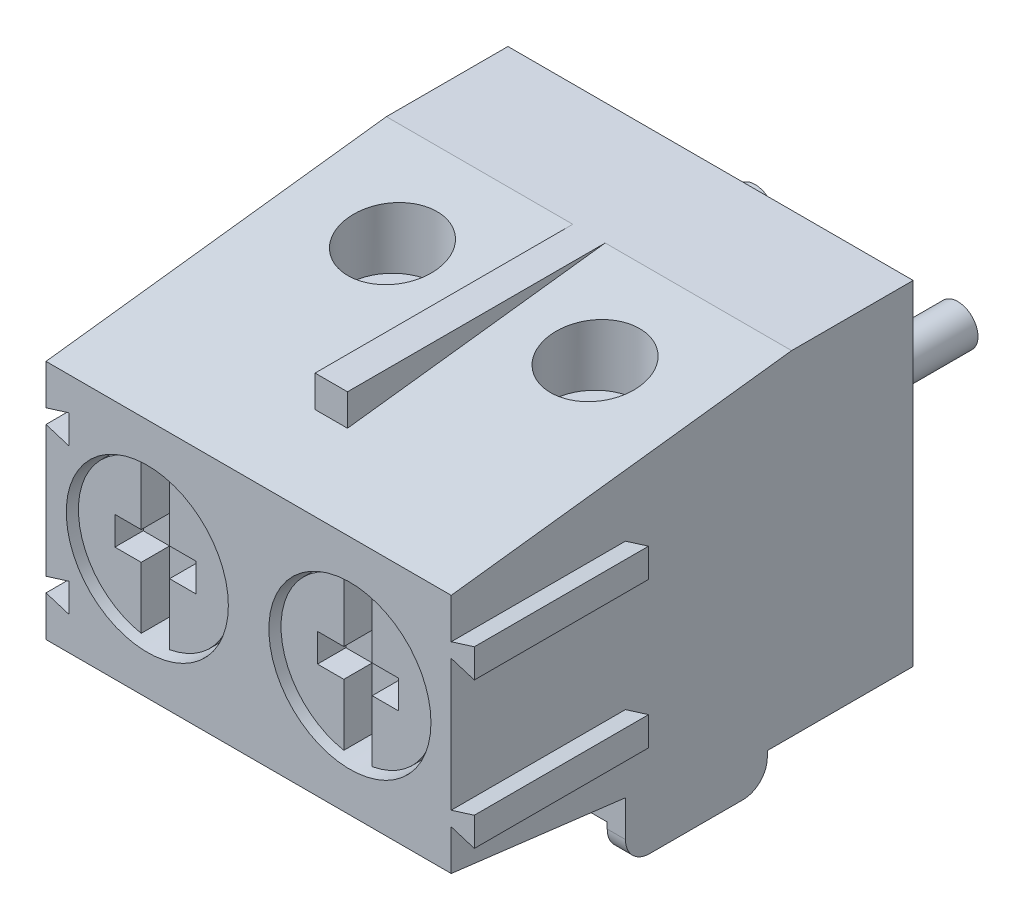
ISO-10303-21;
HEADER;
FILE_DESCRIPTION(('STEP AP214'),'2;1');
FILE_NAME('part.step','',(''),(''),'','','');
FILE_SCHEMA(('AUTOMOTIVE_DESIGN { 1 0 10303 214 1 1 1 1 }'));
ENDSEC;
DATA;
#1=APPLICATION_CONTEXT('core data for automotive mechanical design processes');
#2=APPLICATION_PROTOCOL_DEFINITION('international standard','automotive_design',2000,#1);
#3=PRODUCT_CONTEXT('',#1,'mechanical');
#4=PRODUCT('Part','Part','',(#3));
#5=PRODUCT_RELATED_PRODUCT_CATEGORY('part','',(#4));
#6=PRODUCT_DEFINITION_FORMATION('','',#4);
#7=PRODUCT_DEFINITION_CONTEXT('part definition',#1,'design');
#8=PRODUCT_DEFINITION('design','',#6,#7);
#9=PRODUCT_DEFINITION_SHAPE('','',#8);
#10=(LENGTH_UNIT() NAMED_UNIT(*) SI_UNIT(.MILLI.,.METRE.));
#11=(NAMED_UNIT(*) PLANE_ANGLE_UNIT() SI_UNIT($,.RADIAN.));
#12=(NAMED_UNIT(*) SI_UNIT($,.STERADIAN.) SOLID_ANGLE_UNIT());
#13=UNCERTAINTY_MEASURE_WITH_UNIT(LENGTH_MEASURE(1.E-05),#10,'distance_accuracy_value','');
#14=(GEOMETRIC_REPRESENTATION_CONTEXT(3) GLOBAL_UNCERTAINTY_ASSIGNED_CONTEXT((#13)) GLOBAL_UNIT_ASSIGNED_CONTEXT((#10,
#11,#12)) REPRESENTATION_CONTEXT('',''));
#15=CARTESIAN_POINT('',(0.,0.,0.));
#16=DIRECTION('',(0.,0.,1.));
#17=DIRECTION('',(1.,0.,0.));
#18=AXIS2_PLACEMENT_3D('',#15,#16,#17);
#19=CARTESIAN_POINT('',(4.,-0.35,11.2));
#20=DIRECTION('',(0.,-1.,0.));
#21=DIRECTION('',(0.,0.,-1.));
#22=AXIS2_PLACEMENT_3D('',#19,#20,#21);
#23=PLANE('',#22);
#24=DIRECTION('',(0.,0.,1.));
#25=VECTOR('',#24,1.);
#26=CARTESIAN_POINT('',(4.65,-0.35,11.2));
#27=LINE('',#26,#25);
#28=CARTESIAN_POINT('',(4.65,-0.35,10.5));
#29=VERTEX_POINT('',#28);
#30=CARTESIAN_POINT('',(4.65,-0.35,11.2));
#31=VERTEX_POINT('',#30);
#32=EDGE_CURVE('E1352',#29,#31,#27,.T.);
#33=ORIENTED_EDGE('',*,*,#32,.F.);
#34=DIRECTION('',(1.,0.,0.));
#35=VECTOR('',#34,1.);
#36=CARTESIAN_POINT('',(4.,-0.35,10.5));
#37=LINE('',#36,#35);
#38=CARTESIAN_POINT('',(4.,-0.35,10.5));
#39=VERTEX_POINT('',#38);
#40=EDGE_CURVE('E1811',#39,#29,#37,.T.);
#41=ORIENTED_EDGE('',*,*,#40,.F.);
#42=DIRECTION('',(0.,0.,-1.));
#43=VECTOR('',#42,1.);
#44=CARTESIAN_POINT('',(4.,-0.35,11.2));
#45=LINE('',#44,#43);
#46=CARTESIAN_POINT('',(4.,-0.35,11.2));
#47=VERTEX_POINT('',#46);
#48=EDGE_CURVE('E11',#47,#39,#45,.T.);
#49=ORIENTED_EDGE('',*,*,#48,.F.);
#50=DIRECTION('',(1.,0.,0.));
#51=VECTOR('',#50,1.);
#52=CARTESIAN_POINT('',(4.,-0.35,11.2));
#53=LINE('',#52,#51);
#54=EDGE_CURVE('E1341',#47,#31,#53,.T.);
#55=ORIENTED_EDGE('',*,*,#54,.T.);
#56=EDGE_LOOP('',(#33,#41,#49,#55));
#57=FACE_BOUND('',#56,.T.);
#58=ADVANCED_FACE('F16',(#57),#23,.F.);
#59=CARTESIAN_POINT('',(4.,0.35,11.2));
#60=DIRECTION('',(-1.,0.,0.));
#61=DIRECTION('',(0.,0.,1.));
#62=AXIS2_PLACEMENT_3D('',#59,#60,#61);
#63=PLANE('',#62);
#64=DIRECTION('',(0.,-1.,0.));
#65=VECTOR('',#64,1.);
#66=CARTESIAN_POINT('',(4.,0.35,11.2));
#67=LINE('',#66,#65);
#68=CARTESIAN_POINT('',(4.,0.35,11.2));
#69=VERTEX_POINT('',#68);
#70=EDGE_CURVE('E1344',#69,#47,#67,.T.);
#71=ORIENTED_EDGE('',*,*,#70,.T.);
#72=ORIENTED_EDGE('',*,*,#48,.T.);
#73=DIRECTION('',(0.,-1.,0.));
#74=VECTOR('',#73,1.);
#75=CARTESIAN_POINT('',(4.,0.35,10.5));
#76=LINE('',#75,#74);
#77=CARTESIAN_POINT('',(4.,0.35,10.5));
#78=VERTEX_POINT('',#77);
#79=EDGE_CURVE('E1815',#78,#39,#76,.T.);
#80=ORIENTED_EDGE('',*,*,#79,.F.);
#81=DIRECTION('',(0.,0.,-1.));
#82=VECTOR('',#81,1.);
#83=CARTESIAN_POINT('',(4.,0.35,11.2));
#84=LINE('',#83,#82);
#85=EDGE_CURVE('E26',#69,#78,#84,.T.);
#86=ORIENTED_EDGE('',*,*,#85,.F.);
#87=EDGE_LOOP('',(#71,#72,#80,#86));
#88=FACE_BOUND('',#87,.T.);
#89=ADVANCED_FACE('F2420',(#88),#63,.F.);
#90=CARTESIAN_POINT('',(6.,0.35,11.2));
#91=DIRECTION('',(0.,1.,0.));
#92=DIRECTION('',(1.,0.,0.));
#93=AXIS2_PLACEMENT_3D('',#90,#91,#92);
#94=PLANE('',#93);
#95=ORIENTED_EDGE('',*,*,#85,.T.);
#96=DIRECTION('',(-1.,0.,0.));
#97=VECTOR('',#96,1.);
#98=CARTESIAN_POINT('',(6.,0.35,10.5));
#99=LINE('',#98,#97);
#100=CARTESIAN_POINT('',(4.65,0.35,10.5));
#101=VERTEX_POINT('',#100);
#102=EDGE_CURVE('E1652',#101,#78,#99,.T.);
#103=ORIENTED_EDGE('',*,*,#102,.F.);
#104=DIRECTION('',(0.,0.,-1.));
#105=VECTOR('',#104,1.);
#106=CARTESIAN_POINT('',(4.65,0.35,11.2));
#107=LINE('',#106,#105);
#108=CARTESIAN_POINT('',(4.65,0.35,11.2));
#109=VERTEX_POINT('',#108);
#110=EDGE_CURVE('E1369',#109,#101,#107,.T.);
#111=ORIENTED_EDGE('',*,*,#110,.F.);
#112=DIRECTION('',(-1.,0.,0.));
#113=VECTOR('',#112,1.);
#114=CARTESIAN_POINT('',(6.,0.35,11.2));
#115=LINE('',#114,#113);
#116=EDGE_CURVE('E1533',#109,#69,#115,.T.);
#117=ORIENTED_EDGE('',*,*,#116,.T.);
#118=EDGE_LOOP('',(#95,#103,#111,#117));
#119=FACE_BOUND('',#118,.T.);
#120=ADVANCED_FACE('F2428',(#119),#94,.F.);
#121=CARTESIAN_POINT('',(6.,0.35,11.2));
#122=DIRECTION('',(0.,1.,0.));
#123=DIRECTION('',(1.,0.,0.));
#124=AXIS2_PLACEMENT_3D('',#121,#122,#123);
#125=PLANE('',#124);
#126=DIRECTION('',(0.,0.,1.));
#127=VECTOR('',#126,1.);
#128=CARTESIAN_POINT('',(5.35,0.35,11.2));
#129=LINE('',#128,#127);
#130=CARTESIAN_POINT('',(5.35,0.35,10.5));
#131=VERTEX_POINT('',#130);
#132=CARTESIAN_POINT('',(5.35,0.35,11.2));
#133=VERTEX_POINT('',#132);
#134=EDGE_CURVE('E1365',#131,#133,#129,.T.);
#135=ORIENTED_EDGE('',*,*,#134,.F.);
#136=DIRECTION('',(-1.,0.,0.));
#137=VECTOR('',#136,1.);
#138=CARTESIAN_POINT('',(6.,0.35,10.5));
#139=LINE('',#138,#137);
#140=CARTESIAN_POINT('',(6.,0.35,10.5));
#141=VERTEX_POINT('',#140);
#142=EDGE_CURVE('E1205',#141,#131,#139,.T.);
#143=ORIENTED_EDGE('',*,*,#142,.F.);
#144=DIRECTION('',(0.,0.,-1.));
#145=VECTOR('',#144,1.);
#146=CARTESIAN_POINT('',(6.,0.35,11.2));
#147=LINE('',#146,#145);
#148=CARTESIAN_POINT('',(6.,0.35,11.2));
#149=VERTEX_POINT('',#148);
#150=EDGE_CURVE('E1133',#149,#141,#147,.T.);
#151=ORIENTED_EDGE('',*,*,#150,.F.);
#152=DIRECTION('',(-1.,0.,0.));
#153=VECTOR('',#152,1.);
#154=CARTESIAN_POINT('',(6.,0.35,11.2));
#155=LINE('',#154,#153);
#156=EDGE_CURVE('E1240',#149,#133,#155,.T.);
#157=ORIENTED_EDGE('',*,*,#156,.T.);
#158=EDGE_LOOP('',(#135,#143,#151,#157));
#159=FACE_BOUND('',#158,.T.);
#160=ADVANCED_FACE('F2501',(#159),#125,.F.);
#161=CARTESIAN_POINT('',(6.,-0.35,11.2));
#162=DIRECTION('',(1.,0.,0.));
#163=DIRECTION('',(0.,1.,0.));
#164=AXIS2_PLACEMENT_3D('',#161,#162,#163);
#165=PLANE('',#164);
#166=DIRECTION('',(0.,1.,0.));
#167=VECTOR('',#166,1.);
#168=CARTESIAN_POINT('',(6.,-0.35,11.2));
#169=LINE('',#168,#167);
#170=CARTESIAN_POINT('',(6.,-0.35,11.2));
#171=VERTEX_POINT('',#170);
#172=EDGE_CURVE('E1124',#171,#149,#169,.T.);
#173=ORIENTED_EDGE('',*,*,#172,.T.);
#174=ORIENTED_EDGE('',*,*,#150,.T.);
#175=DIRECTION('',(0.,1.,0.));
#176=VECTOR('',#175,1.);
#177=CARTESIAN_POINT('',(6.,-0.35,10.5));
#178=LINE('',#177,#176);
#179=CARTESIAN_POINT('',(6.,-0.35,10.5));
#180=VERTEX_POINT('',#179);
#181=EDGE_CURVE('E1091',#180,#141,#178,.T.);
#182=ORIENTED_EDGE('',*,*,#181,.F.);
#183=DIRECTION('',(0.,0.,-1.));
#184=VECTOR('',#183,1.);
#185=CARTESIAN_POINT('',(6.,-0.35,11.2));
#186=LINE('',#185,#184);
#187=EDGE_CURVE('E1004',#171,#180,#186,.T.);
#188=ORIENTED_EDGE('',*,*,#187,.F.);
#189=EDGE_LOOP('',(#173,#174,#182,#188));
#190=FACE_BOUND('',#189,.T.);
#191=ADVANCED_FACE('F2497',(#190),#165,.F.);
#192=CARTESIAN_POINT('',(4.,-0.35,11.2));
#193=DIRECTION('',(0.,-1.,0.));
#194=DIRECTION('',(0.,0.,-1.));
#195=AXIS2_PLACEMENT_3D('',#192,#193,#194);
#196=PLANE('',#195);
#197=ORIENTED_EDGE('',*,*,#187,.T.);
#198=DIRECTION('',(1.,0.,0.));
#199=VECTOR('',#198,1.);
#200=CARTESIAN_POINT('',(4.,-0.35,10.5));
#201=LINE('',#200,#199);
#202=CARTESIAN_POINT('',(5.35,-0.35,10.5));
#203=VERTEX_POINT('',#202);
#204=EDGE_CURVE('E1087',#203,#180,#201,.T.);
#205=ORIENTED_EDGE('',*,*,#204,.F.);
#206=DIRECTION('',(0.,0.,-1.));
#207=VECTOR('',#206,1.);
#208=CARTESIAN_POINT('',(5.35,-0.35,11.2));
#209=LINE('',#208,#207);
#210=CARTESIAN_POINT('',(5.35,-0.35,11.2));
#211=VERTEX_POINT('',#210);
#212=EDGE_CURVE('E1123',#211,#203,#209,.T.);
#213=ORIENTED_EDGE('',*,*,#212,.F.);
#214=DIRECTION('',(1.,0.,0.));
#215=VECTOR('',#214,1.);
#216=CARTESIAN_POINT('',(4.,-0.35,11.2));
#217=LINE('',#216,#215);
#218=EDGE_CURVE('E1119',#211,#171,#217,.T.);
#219=ORIENTED_EDGE('',*,*,#218,.T.);
#220=EDGE_LOOP('',(#197,#205,#213,#219));
#221=FACE_BOUND('',#220,.T.);
#222=ADVANCED_FACE('F2500',(#221),#196,.F.);
#223=CARTESIAN_POINT('',(-1.,-0.35,11.2));
#224=DIRECTION('',(0.,-1.,0.));
#225=DIRECTION('',(0.,0.,-1.));
#226=AXIS2_PLACEMENT_3D('',#223,#224,#225);
#227=PLANE('',#226);
#228=DIRECTION('',(0.,0.,1.));
#229=VECTOR('',#228,1.);
#230=CARTESIAN_POINT('',(-0.35,-0.35,11.2));
#231=LINE('',#230,#229);
#232=CARTESIAN_POINT('',(-0.35,-0.35,10.5));
#233=VERTEX_POINT('',#232);
#234=CARTESIAN_POINT('',(-0.35,-0.35,11.2));
#235=VERTEX_POINT('',#234);
#236=EDGE_CURVE('E1200',#233,#235,#231,.T.);
#237=ORIENTED_EDGE('',*,*,#236,.F.);
#238=DIRECTION('',(1.,0.,0.));
#239=VECTOR('',#238,1.);
#240=CARTESIAN_POINT('',(-1.,-0.35,10.5));
#241=LINE('',#240,#239);
#242=CARTESIAN_POINT('',(-1.,-0.35,10.5));
#243=VERTEX_POINT('',#242);
#244=EDGE_CURVE('E1334',#243,#233,#241,.T.);
#245=ORIENTED_EDGE('',*,*,#244,.F.);
#246=DIRECTION('',(0.,0.,-1.));
#247=VECTOR('',#246,1.);
#248=CARTESIAN_POINT('',(-1.,-0.35,11.2));
#249=LINE('',#248,#247);
#250=CARTESIAN_POINT('',(-1.,-0.35,11.2));
#251=VERTEX_POINT('',#250);
#252=EDGE_CURVE('E1001',#251,#243,#249,.T.);
#253=ORIENTED_EDGE('',*,*,#252,.F.);
#254=DIRECTION('',(1.,0.,0.));
#255=VECTOR('',#254,1.);
#256=CARTESIAN_POINT('',(-1.,-0.35,11.2));
#257=LINE('',#256,#255);
#258=EDGE_CURVE('E1721',#251,#235,#257,.T.);
#259=ORIENTED_EDGE('',*,*,#258,.T.);
#260=EDGE_LOOP('',(#237,#245,#253,#259));
#261=FACE_BOUND('',#260,.T.);
#262=ADVANCED_FACE('F2433',(#261),#227,.F.);
#263=CARTESIAN_POINT('',(-1.,0.35,11.2));
#264=DIRECTION('',(-1.,0.,0.));
#265=DIRECTION('',(0.,0.,1.));
#266=AXIS2_PLACEMENT_3D('',#263,#264,#265);
#267=PLANE('',#266);
#268=DIRECTION('',(0.,-1.,0.));
#269=VECTOR('',#268,1.);
#270=CARTESIAN_POINT('',(-1.,0.35,11.2));
#271=LINE('',#270,#269);
#272=CARTESIAN_POINT('',(-1.,0.35,11.2));
#273=VERTEX_POINT('',#272);
#274=EDGE_CURVE('E1659',#273,#251,#271,.T.);
#275=ORIENTED_EDGE('',*,*,#274,.T.);
#276=ORIENTED_EDGE('',*,*,#252,.T.);
#277=DIRECTION('',(0.,-1.,0.));
#278=VECTOR('',#277,1.);
#279=CARTESIAN_POINT('',(-1.,0.35,10.5));
#280=LINE('',#279,#278);
#281=CARTESIAN_POINT('',(-1.,0.35,10.5));
#282=VERTEX_POINT('',#281);
#283=EDGE_CURVE('E1339',#282,#243,#280,.T.);
#284=ORIENTED_EDGE('',*,*,#283,.F.);
#285=DIRECTION('',(0.,0.,-1.));
#286=VECTOR('',#285,1.);
#287=CARTESIAN_POINT('',(-1.,0.35,11.2));
#288=LINE('',#287,#286);
#289=EDGE_CURVE('E1005',#273,#282,#288,.T.);
#290=ORIENTED_EDGE('',*,*,#289,.F.);
#291=EDGE_LOOP('',(#275,#276,#284,#290));
#292=FACE_BOUND('',#291,.T.);
#293=ADVANCED_FACE('F2439',(#292),#267,.F.);
#294=CARTESIAN_POINT('',(1.,0.35,11.2));
#295=DIRECTION('',(0.,1.,0.));
#296=DIRECTION('',(1.,0.,0.));
#297=AXIS2_PLACEMENT_3D('',#294,#295,#296);
#298=PLANE('',#297);
#299=ORIENTED_EDGE('',*,*,#289,.T.);
#300=DIRECTION('',(-1.,0.,0.));
#301=VECTOR('',#300,1.);
#302=CARTESIAN_POINT('',(1.,0.35,10.5));
#303=LINE('',#302,#301);
#304=CARTESIAN_POINT('',(-0.35,0.35,10.5));
#305=VERTEX_POINT('',#304);
#306=EDGE_CURVE('E1335',#305,#282,#303,.T.);
#307=ORIENTED_EDGE('',*,*,#306,.F.);
#308=DIRECTION('',(0.,0.,-1.));
#309=VECTOR('',#308,1.);
#310=CARTESIAN_POINT('',(-0.35,0.35,11.2));
#311=LINE('',#310,#309);
#312=CARTESIAN_POINT('',(-0.35,0.35,11.2));
#313=VERTEX_POINT('',#312);
#314=EDGE_CURVE('E1262',#313,#305,#311,.T.);
#315=ORIENTED_EDGE('',*,*,#314,.F.);
#316=DIRECTION('',(-1.,0.,0.));
#317=VECTOR('',#316,1.);
#318=CARTESIAN_POINT('',(1.,0.35,11.2));
#319=LINE('',#318,#317);
#320=EDGE_CURVE('E1655',#313,#273,#319,.T.);
#321=ORIENTED_EDGE('',*,*,#320,.T.);
#322=EDGE_LOOP('',(#299,#307,#315,#321));
#323=FACE_BOUND('',#322,.T.);
#324=ADVANCED_FACE('F2435',(#323),#298,.F.);
#325=CARTESIAN_POINT('',(1.,0.35,11.2));
#326=DIRECTION('',(0.,1.,0.));
#327=DIRECTION('',(1.,0.,0.));
#328=AXIS2_PLACEMENT_3D('',#325,#326,#327);
#329=PLANE('',#328);
#330=DIRECTION('',(0.,0.,1.));
#331=VECTOR('',#330,1.);
#332=CARTESIAN_POINT('',(0.35,0.35,11.2));
#333=LINE('',#332,#331);
#334=CARTESIAN_POINT('',(0.35,0.35,10.5));
#335=VERTEX_POINT('',#334);
#336=CARTESIAN_POINT('',(0.35,0.35,11.2));
#337=VERTEX_POINT('',#336);
#338=EDGE_CURVE('E1258',#335,#337,#333,.T.);
#339=ORIENTED_EDGE('',*,*,#338,.F.);
#340=DIRECTION('',(-1.,0.,0.));
#341=VECTOR('',#340,1.);
#342=CARTESIAN_POINT('',(1.,0.35,10.5));
#343=LINE('',#342,#341);
#344=CARTESIAN_POINT('',(1.,0.35,10.5));
#345=VERTEX_POINT('',#344);
#346=EDGE_CURVE('E1470',#345,#335,#343,.T.);
#347=ORIENTED_EDGE('',*,*,#346,.F.);
#348=DIRECTION('',(0.,0.,-1.));
#349=VECTOR('',#348,1.);
#350=CARTESIAN_POINT('',(1.,0.35,11.2));
#351=LINE('',#350,#349);
#352=CARTESIAN_POINT('',(1.,0.35,11.2));
#353=VERTEX_POINT('',#352);
#354=EDGE_CURVE('E1776',#353,#345,#351,.T.);
#355=ORIENTED_EDGE('',*,*,#354,.F.);
#356=DIRECTION('',(-1.,0.,0.));
#357=VECTOR('',#356,1.);
#358=CARTESIAN_POINT('',(1.,0.35,11.2));
#359=LINE('',#358,#357);
#360=EDGE_CURVE('E1537',#353,#337,#359,.T.);
#361=ORIENTED_EDGE('',*,*,#360,.T.);
#362=EDGE_LOOP('',(#339,#347,#355,#361));
#363=FACE_BOUND('',#362,.T.);
#364=ADVANCED_FACE('F2438',(#363),#329,.F.);
#365=CARTESIAN_POINT('',(1.,-0.35,11.2));
#366=DIRECTION('',(1.,0.,0.));
#367=DIRECTION('',(0.,1.,0.));
#368=AXIS2_PLACEMENT_3D('',#365,#366,#367);
#369=PLANE('',#368);
#370=DIRECTION('',(0.,1.,0.));
#371=VECTOR('',#370,1.);
#372=CARTESIAN_POINT('',(1.,-0.35,11.2));
#373=LINE('',#372,#371);
#374=CARTESIAN_POINT('',(1.,-0.35,11.2));
#375=VERTEX_POINT('',#374);
#376=EDGE_CURVE('E1175',#375,#353,#373,.T.);
#377=ORIENTED_EDGE('',*,*,#376,.T.);
#378=ORIENTED_EDGE('',*,*,#354,.T.);
#379=DIRECTION('',(0.,1.,0.));
#380=VECTOR('',#379,1.);
#381=CARTESIAN_POINT('',(1.,-0.35,10.5));
#382=LINE('',#381,#380);
#383=CARTESIAN_POINT('',(1.,-0.35,10.5));
#384=VERTEX_POINT('',#383);
#385=EDGE_CURVE('E1405',#384,#345,#382,.T.);
#386=ORIENTED_EDGE('',*,*,#385,.F.);
#387=DIRECTION('',(0.,0.,-1.));
#388=VECTOR('',#387,1.);
#389=CARTESIAN_POINT('',(1.,-0.35,11.2));
#390=LINE('',#389,#388);
#391=EDGE_CURVE('E1368',#375,#384,#390,.T.);
#392=ORIENTED_EDGE('',*,*,#391,.F.);
#393=EDGE_LOOP('',(#377,#378,#386,#392));
#394=FACE_BOUND('',#393,.T.);
#395=ADVANCED_FACE('F2543',(#394),#369,.F.);
#396=CARTESIAN_POINT('',(-1.,-0.35,11.2));
#397=DIRECTION('',(0.,-1.,0.));
#398=DIRECTION('',(0.,0.,-1.));
#399=AXIS2_PLACEMENT_3D('',#396,#397,#398);
#400=PLANE('',#399);
#401=ORIENTED_EDGE('',*,*,#391,.T.);
#402=DIRECTION('',(1.,0.,0.));
#403=VECTOR('',#402,1.);
#404=CARTESIAN_POINT('',(-1.,-0.35,10.5));
#405=LINE('',#404,#403);
#406=CARTESIAN_POINT('',(0.35,-0.35,10.5));
#407=VERTEX_POINT('',#406);
#408=EDGE_CURVE('E1401',#407,#384,#405,.T.);
#409=ORIENTED_EDGE('',*,*,#408,.F.);
#410=DIRECTION('',(0.,0.,-1.));
#411=VECTOR('',#410,1.);
#412=CARTESIAN_POINT('',(0.35,-0.35,11.2));
#413=LINE('',#412,#411);
#414=CARTESIAN_POINT('',(0.35,-0.35,11.2));
#415=VERTEX_POINT('',#414);
#416=EDGE_CURVE('E1174',#415,#407,#413,.T.);
#417=ORIENTED_EDGE('',*,*,#416,.F.);
#418=DIRECTION('',(1.,0.,0.));
#419=VECTOR('',#418,1.);
#420=CARTESIAN_POINT('',(-1.,-0.35,11.2));
#421=LINE('',#420,#419);
#422=EDGE_CURVE('E1170',#415,#375,#421,.T.);
#423=ORIENTED_EDGE('',*,*,#422,.T.);
#424=EDGE_LOOP('',(#401,#409,#417,#423));
#425=FACE_BOUND('',#424,.T.);
#426=ADVANCED_FACE('F2541',(#425),#400,.F.);
#427=CARTESIAN_POINT('',(5.35,-2.,11.2));
#428=DIRECTION('',(1.,0.,0.));
#429=DIRECTION('',(0.,1.,0.));
#430=AXIS2_PLACEMENT_3D('',#427,#428,#429);
#431=PLANE('',#430);
#432=DIRECTION('',(0.,0.,-1.));
#433=VECTOR('',#432,1.);
#434=CARTESIAN_POINT('',(5.35,1.867484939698,6.5));
#435=LINE('',#434,#433);
#436=CARTESIAN_POINT('',(5.35,1.867484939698,11.2));
#437=VERTEX_POINT('',#436);
#438=CARTESIAN_POINT('',(5.35,1.867484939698,10.5));
#439=VERTEX_POINT('',#438);
#440=EDGE_CURVE('E1329',#437,#439,#435,.T.);
#441=ORIENTED_EDGE('',*,*,#440,.T.);
#442=DIRECTION('',(0.,1.,0.));
#443=VECTOR('',#442,1.);
#444=CARTESIAN_POINT('',(5.35,-2.,10.5));
#445=LINE('',#444,#443);
#446=EDGE_CURVE('E1201',#131,#439,#445,.T.);
#447=ORIENTED_EDGE('',*,*,#446,.F.);
#448=ORIENTED_EDGE('',*,*,#134,.T.);
#449=DIRECTION('',(0.,1.,0.));
#450=VECTOR('',#449,1.);
#451=CARTESIAN_POINT('',(5.35,-2.,11.2));
#452=LINE('',#451,#450);
#453=EDGE_CURVE('E1244',#133,#437,#452,.T.);
#454=ORIENTED_EDGE('',*,*,#453,.T.);
#455=EDGE_LOOP('',(#441,#447,#448,#454));
#456=FACE_BOUND('',#455,.T.);
#457=ADVANCED_FACE('F2538',(#456),#431,.F.);
#458=CARTESIAN_POINT('',(4.65,2.,11.2));
#459=DIRECTION('',(-1.,0.,0.));
#460=DIRECTION('',(0.,0.,1.));
#461=AXIS2_PLACEMENT_3D('',#458,#459,#460);
#462=PLANE('',#461);
#463=ORIENTED_EDGE('',*,*,#110,.T.);
#464=DIRECTION('',(0.,-1.,0.));
#465=VECTOR('',#464,1.);
#466=CARTESIAN_POINT('',(4.65,2.,10.5));
#467=LINE('',#466,#465);
#468=CARTESIAN_POINT('',(4.65,1.867484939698,10.5));
#469=VERTEX_POINT('',#468);
#470=EDGE_CURVE('E1204',#469,#101,#467,.T.);
#471=ORIENTED_EDGE('',*,*,#470,.F.);
#472=DIRECTION('',(0.,0.,-1.));
#473=VECTOR('',#472,1.);
#474=CARTESIAN_POINT('',(4.65,1.867484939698,6.5));
#475=LINE('',#474,#473);
#476=CARTESIAN_POINT('',(4.65,1.867484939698,11.2));
#477=VERTEX_POINT('',#476);
#478=EDGE_CURVE('E1330',#477,#469,#475,.T.);
#479=ORIENTED_EDGE('',*,*,#478,.F.);
#480=DIRECTION('',(0.,-1.,0.));
#481=VECTOR('',#480,1.);
#482=CARTESIAN_POINT('',(4.65,2.,11.2));
#483=LINE('',#482,#481);
#484=EDGE_CURVE('E1345',#477,#109,#483,.T.);
#485=ORIENTED_EDGE('',*,*,#484,.T.);
#486=EDGE_LOOP('',(#463,#471,#479,#485));
#487=FACE_BOUND('',#486,.T.);
#488=ADVANCED_FACE('F2456',(#487),#462,.F.);
#489=CARTESIAN_POINT('',(5.,0.,11.2));
#490=DIRECTION('',(0.,0.,1.));
#491=DIRECTION('',(1.,0.,0.));
#492=AXIS2_PLACEMENT_3D('',#489,#490,#491);
#493=PLANE('',#492);
#494=ORIENTED_EDGE('',*,*,#484,.F.);
#495=CARTESIAN_POINT('',(5.,0.,11.2));
#496=DIRECTION('',(0.,0.,1.));
#497=DIRECTION('',(1.,0.,0.));
#498=AXIS2_PLACEMENT_3D('',#495,#496,#497);
#499=CIRCLE('',#498,1.9);
#500=CARTESIAN_POINT('',(4.65,-1.867484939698,11.2));
#501=VERTEX_POINT('',#500);
#502=EDGE_CURVE('E1731',#477,#501,#499,.T.);
#503=ORIENTED_EDGE('',*,*,#502,.T.);
#504=DIRECTION('',(0.,-1.,0.));
#505=VECTOR('',#504,1.);
#506=CARTESIAN_POINT('',(4.65,2.,11.2));
#507=LINE('',#506,#505);
#508=EDGE_CURVE('E1356',#31,#501,#507,.T.);
#509=ORIENTED_EDGE('',*,*,#508,.F.);
#510=ORIENTED_EDGE('',*,*,#54,.F.);
#511=ORIENTED_EDGE('',*,*,#70,.F.);
#512=ORIENTED_EDGE('',*,*,#116,.F.);
#513=EDGE_LOOP('',(#494,#503,#509,#510,#511,#512));
#514=FACE_BOUND('',#513,.T.);
#515=ADVANCED_FACE('F2452',(#514),#493,.T.);
#516=CARTESIAN_POINT('',(4.65,2.,11.2));
#517=DIRECTION('',(-1.,0.,0.));
#518=DIRECTION('',(0.,0.,1.));
#519=AXIS2_PLACEMENT_3D('',#516,#517,#518);
#520=PLANE('',#519);
#521=DIRECTION('',(0.,0.,-1.));
#522=VECTOR('',#521,1.);
#523=CARTESIAN_POINT('',(4.65,-1.867484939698,6.5));
#524=LINE('',#523,#522);
#525=CARTESIAN_POINT('',(4.65,-1.867484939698,10.5));
#526=VERTEX_POINT('',#525);
#527=EDGE_CURVE('E1873',#501,#526,#524,.T.);
#528=ORIENTED_EDGE('',*,*,#527,.T.);
#529=DIRECTION('',(0.,-1.,0.));
#530=VECTOR('',#529,1.);
#531=CARTESIAN_POINT('',(4.65,2.,10.5));
#532=LINE('',#531,#530);
#533=EDGE_CURVE('E1357',#29,#526,#532,.T.);
#534=ORIENTED_EDGE('',*,*,#533,.F.);
#535=ORIENTED_EDGE('',*,*,#32,.T.);
#536=ORIENTED_EDGE('',*,*,#508,.T.);
#537=EDGE_LOOP('',(#528,#534,#535,#536));
#538=FACE_BOUND('',#537,.T.);
#539=ADVANCED_FACE('F2455',(#538),#520,.F.);
#540=CARTESIAN_POINT('',(5.,0.,10.5));
#541=DIRECTION('',(0.,0.,1.));
#542=DIRECTION('',(1.,0.,0.));
#543=AXIS2_PLACEMENT_3D('',#540,#541,#542);
#544=PLANE('',#543);
#545=DIRECTION('',(0.,1.,0.));
#546=VECTOR('',#545,1.);
#547=CARTESIAN_POINT('',(5.35,-2.,10.5));
#548=LINE('',#547,#546);
#549=CARTESIAN_POINT('',(5.35,-1.867484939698,10.5));
#550=VERTEX_POINT('',#549);
#551=EDGE_CURVE('E1092',#550,#203,#548,.T.);
#552=ORIENTED_EDGE('',*,*,#551,.T.);
#553=ORIENTED_EDGE('',*,*,#204,.T.);
#554=ORIENTED_EDGE('',*,*,#181,.T.);
#555=ORIENTED_EDGE('',*,*,#142,.T.);
#556=ORIENTED_EDGE('',*,*,#446,.T.);
#557=CARTESIAN_POINT('',(5.,0.,10.5));
#558=DIRECTION('',(0.,0.,-1.));
#559=DIRECTION('',(1.,0.,0.));
#560=AXIS2_PLACEMENT_3D('',#557,#558,#559);
#561=CIRCLE('',#560,1.9);
#562=EDGE_CURVE('E1325',#469,#439,#561,.T.);
#563=ORIENTED_EDGE('',*,*,#562,.F.);
#564=ORIENTED_EDGE('',*,*,#470,.T.);
#565=ORIENTED_EDGE('',*,*,#102,.T.);
#566=ORIENTED_EDGE('',*,*,#79,.T.);
#567=ORIENTED_EDGE('',*,*,#40,.T.);
#568=ORIENTED_EDGE('',*,*,#533,.T.);
#569=CARTESIAN_POINT('',(5.,0.,10.5));
#570=DIRECTION('',(0.,0.,-1.));
#571=DIRECTION('',(1.,0.,0.));
#572=AXIS2_PLACEMENT_3D('',#569,#570,#571);
#573=CIRCLE('',#572,1.9);
#574=EDGE_CURVE('E1915',#550,#526,#573,.T.);
#575=ORIENTED_EDGE('',*,*,#574,.F.);
#576=EDGE_LOOP('',(#552,#553,#554,#555,#556,#563,#564,#565,#566,#567,#568,#575));
#577=FACE_BOUND('',#576,.T.);
#578=ADVANCED_FACE('F2472',(#577),#544,.T.);
#579=CARTESIAN_POINT('',(5.35,-2.,11.2));
#580=DIRECTION('',(1.,0.,0.));
#581=DIRECTION('',(0.,1.,0.));
#582=AXIS2_PLACEMENT_3D('',#579,#580,#581);
#583=PLANE('',#582);
#584=ORIENTED_EDGE('',*,*,#212,.T.);
#585=ORIENTED_EDGE('',*,*,#551,.F.);
#586=DIRECTION('',(0.,0.,-1.));
#587=VECTOR('',#586,1.);
#588=CARTESIAN_POINT('',(5.35,-1.867484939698,6.5));
#589=LINE('',#588,#587);
#590=CARTESIAN_POINT('',(5.35,-1.867484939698,11.2));
#591=VERTEX_POINT('',#590);
#592=EDGE_CURVE('E1919',#591,#550,#589,.T.);
#593=ORIENTED_EDGE('',*,*,#592,.F.);
#594=DIRECTION('',(0.,1.,0.));
#595=VECTOR('',#594,1.);
#596=CARTESIAN_POINT('',(5.35,-2.,11.2));
#597=LINE('',#596,#595);
#598=EDGE_CURVE('E1261',#591,#211,#597,.T.);
#599=ORIENTED_EDGE('',*,*,#598,.T.);
#600=EDGE_LOOP('',(#584,#585,#593,#599));
#601=FACE_BOUND('',#600,.T.);
#602=ADVANCED_FACE('F2475',(#601),#583,.F.);
#603=CARTESIAN_POINT('',(5.,0.,11.2));
#604=DIRECTION('',(0.,0.,1.));
#605=DIRECTION('',(1.,0.,0.));
#606=AXIS2_PLACEMENT_3D('',#603,#604,#605);
#607=PLANE('',#606);
#608=ORIENTED_EDGE('',*,*,#598,.F.);
#609=CARTESIAN_POINT('',(5.,0.,11.2));
#610=DIRECTION('',(0.,0.,1.));
#611=DIRECTION('',(1.,0.,0.));
#612=AXIS2_PLACEMENT_3D('',#609,#610,#611);
#613=CIRCLE('',#612,1.9);
#614=CARTESIAN_POINT('',(6.9,0.,11.2));
#615=VERTEX_POINT('',#614);
#616=EDGE_CURVE('E995',#591,#615,#613,.T.);
#617=ORIENTED_EDGE('',*,*,#616,.T.);
#618=CARTESIAN_POINT('',(5.,0.,11.2));
#619=DIRECTION('',(0.,0.,1.));
#620=DIRECTION('',(1.,0.,0.));
#621=AXIS2_PLACEMENT_3D('',#618,#619,#620);
#622=CIRCLE('',#621,1.9);
#623=EDGE_CURVE('E1550',#615,#437,#622,.T.);
#624=ORIENTED_EDGE('',*,*,#623,.T.);
#625=ORIENTED_EDGE('',*,*,#453,.F.);
#626=ORIENTED_EDGE('',*,*,#156,.F.);
#627=ORIENTED_EDGE('',*,*,#172,.F.);
#628=ORIENTED_EDGE('',*,*,#218,.F.);
#629=EDGE_LOOP('',(#608,#617,#624,#625,#626,#627,#628));
#630=FACE_BOUND('',#629,.T.);
#631=ADVANCED_FACE('F2462',(#630),#607,.T.);
#632=CARTESIAN_POINT('',(0.35,-2.,11.2));
#633=DIRECTION('',(1.,0.,0.));
#634=DIRECTION('',(0.,1.,0.));
#635=AXIS2_PLACEMENT_3D('',#632,#633,#634);
#636=PLANE('',#635);
#637=DIRECTION('',(0.,0.,-1.));
#638=VECTOR('',#637,1.);
#639=CARTESIAN_POINT('',(0.35,1.867484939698,6.5));
#640=LINE('',#639,#638);
#641=CARTESIAN_POINT('',(0.35,1.867484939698,11.2));
#642=VERTEX_POINT('',#641);
#643=CARTESIAN_POINT('',(0.35,1.867484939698,10.5));
#644=VERTEX_POINT('',#643);
#645=EDGE_CURVE('E1085',#642,#644,#640,.T.);
#646=ORIENTED_EDGE('',*,*,#645,.T.);
#647=DIRECTION('',(0.,1.,0.));
#648=VECTOR('',#647,1.);
#649=CARTESIAN_POINT('',(0.35,-2.,10.5));
#650=LINE('',#649,#648);
#651=EDGE_CURVE('E1467',#335,#644,#650,.T.);
#652=ORIENTED_EDGE('',*,*,#651,.F.);
#653=ORIENTED_EDGE('',*,*,#338,.T.);
#654=DIRECTION('',(0.,1.,0.));
#655=VECTOR('',#654,1.);
#656=CARTESIAN_POINT('',(0.35,-2.,11.2));
#657=LINE('',#656,#655);
#658=EDGE_CURVE('E1831',#337,#642,#657,.T.);
#659=ORIENTED_EDGE('',*,*,#658,.T.);
#660=EDGE_LOOP('',(#646,#652,#653,#659));
#661=FACE_BOUND('',#660,.T.);
#662=ADVANCED_FACE('F2458',(#661),#636,.F.);
#663=CARTESIAN_POINT('',(-0.35,2.,11.2));
#664=DIRECTION('',(-1.,0.,0.));
#665=DIRECTION('',(0.,0.,1.));
#666=AXIS2_PLACEMENT_3D('',#663,#664,#665);
#667=PLANE('',#666);
#668=ORIENTED_EDGE('',*,*,#314,.T.);
#669=DIRECTION('',(0.,-1.,0.));
#670=VECTOR('',#669,1.);
#671=CARTESIAN_POINT('',(-0.35,2.,10.5));
#672=LINE('',#671,#670);
#673=CARTESIAN_POINT('',(-0.35,1.867484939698,10.5));
#674=VERTEX_POINT('',#673);
#675=EDGE_CURVE('E1340',#674,#305,#672,.T.);
#676=ORIENTED_EDGE('',*,*,#675,.F.);
#677=DIRECTION('',(0.,0.,-1.));
#678=VECTOR('',#677,1.);
#679=CARTESIAN_POINT('',(-0.35,1.867484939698,6.5));
#680=LINE('',#679,#678);
#681=CARTESIAN_POINT('',(-0.35,1.867484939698,11.2));
#682=VERTEX_POINT('',#681);
#683=EDGE_CURVE('E1086',#682,#674,#680,.T.);
#684=ORIENTED_EDGE('',*,*,#683,.F.);
#685=DIRECTION('',(0.,-1.,0.));
#686=VECTOR('',#685,1.);
#687=CARTESIAN_POINT('',(-0.35,2.,11.2));
#688=LINE('',#687,#686);
#689=EDGE_CURVE('E1199',#682,#313,#688,.T.);
#690=ORIENTED_EDGE('',*,*,#689,.T.);
#691=EDGE_LOOP('',(#668,#676,#684,#690));
#692=FACE_BOUND('',#691,.T.);
#693=ADVANCED_FACE('F2461',(#692),#667,.F.);
#694=CARTESIAN_POINT('',(0.,0.,11.2));
#695=DIRECTION('',(0.,0.,1.));
#696=DIRECTION('',(1.,0.,0.));
#697=AXIS2_PLACEMENT_3D('',#694,#695,#696);
#698=PLANE('',#697);
#699=ORIENTED_EDGE('',*,*,#689,.F.);
#700=CARTESIAN_POINT('',(0.,0.,11.2));
#701=DIRECTION('',(0.,0.,1.));
#702=DIRECTION('',(1.,0.,0.));
#703=AXIS2_PLACEMENT_3D('',#700,#701,#702);
#704=CIRCLE('',#703,1.9);
#705=CARTESIAN_POINT('',(-0.35,-1.867484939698,11.2));
#706=VERTEX_POINT('',#705);
#707=EDGE_CURVE('E1765',#682,#706,#704,.T.);
#708=ORIENTED_EDGE('',*,*,#707,.T.);
#709=DIRECTION('',(0.,-1.,0.));
#710=VECTOR('',#709,1.);
#711=CARTESIAN_POINT('',(-0.35,2.,11.2));
#712=LINE('',#711,#710);
#713=EDGE_CURVE('E1196',#235,#706,#712,.T.);
#714=ORIENTED_EDGE('',*,*,#713,.F.);
#715=ORIENTED_EDGE('',*,*,#258,.F.);
#716=ORIENTED_EDGE('',*,*,#274,.F.);
#717=ORIENTED_EDGE('',*,*,#320,.F.);
#718=EDGE_LOOP('',(#699,#708,#714,#715,#716,#717));
#719=FACE_BOUND('',#718,.T.);
#720=ADVANCED_FACE('F2668',(#719),#698,.T.);
#721=CARTESIAN_POINT('',(-0.35,2.,11.2));
#722=DIRECTION('',(-1.,0.,0.));
#723=DIRECTION('',(0.,0.,1.));
#724=AXIS2_PLACEMENT_3D('',#721,#722,#723);
#725=PLANE('',#724);
#726=DIRECTION('',(0.,0.,-1.));
#727=VECTOR('',#726,1.);
#728=CARTESIAN_POINT('',(-0.35,-1.867484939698,6.5));
#729=LINE('',#728,#727);
#730=CARTESIAN_POINT('',(-0.35,-1.867484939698,10.5));
#731=VERTEX_POINT('',#730);
#732=EDGE_CURVE('E1194',#706,#731,#729,.T.);
#733=ORIENTED_EDGE('',*,*,#732,.T.);
#734=DIRECTION('',(0.,-1.,0.));
#735=VECTOR('',#734,1.);
#736=CARTESIAN_POINT('',(-0.35,2.,10.5));
#737=LINE('',#736,#735);
#738=EDGE_CURVE('E1331',#233,#731,#737,.T.);
#739=ORIENTED_EDGE('',*,*,#738,.F.);
#740=ORIENTED_EDGE('',*,*,#236,.T.);
#741=ORIENTED_EDGE('',*,*,#713,.T.);
#742=EDGE_LOOP('',(#733,#739,#740,#741));
#743=FACE_BOUND('',#742,.T.);
#744=ADVANCED_FACE('F2601',(#743),#725,.F.);
#745=CARTESIAN_POINT('',(0.,0.,10.5));
#746=DIRECTION('',(0.,0.,1.));
#747=DIRECTION('',(1.,0.,0.));
#748=AXIS2_PLACEMENT_3D('',#745,#746,#747);
#749=PLANE('',#748);
#750=DIRECTION('',(0.,1.,0.));
#751=VECTOR('',#750,1.);
#752=CARTESIAN_POINT('',(0.35,-2.,10.5));
#753=LINE('',#752,#751);
#754=CARTESIAN_POINT('',(0.35,-1.867484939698,10.5));
#755=VERTEX_POINT('',#754);
#756=EDGE_CURVE('E1406',#755,#407,#753,.T.);
#757=ORIENTED_EDGE('',*,*,#756,.T.);
#758=ORIENTED_EDGE('',*,*,#408,.T.);
#759=ORIENTED_EDGE('',*,*,#385,.T.);
#760=ORIENTED_EDGE('',*,*,#346,.T.);
#761=ORIENTED_EDGE('',*,*,#651,.T.);
#762=CARTESIAN_POINT('',(0.,0.,10.5));
#763=DIRECTION('',(0.,0.,-1.));
#764=DIRECTION('',(1.,0.,0.));
#765=AXIS2_PLACEMENT_3D('',#762,#763,#764);
#766=CIRCLE('',#765,1.9);
#767=EDGE_CURVE('E1081',#674,#644,#766,.T.);
#768=ORIENTED_EDGE('',*,*,#767,.F.);
#769=ORIENTED_EDGE('',*,*,#675,.T.);
#770=ORIENTED_EDGE('',*,*,#306,.T.);
#771=ORIENTED_EDGE('',*,*,#283,.T.);
#772=ORIENTED_EDGE('',*,*,#244,.T.);
#773=ORIENTED_EDGE('',*,*,#738,.T.);
#774=CARTESIAN_POINT('',(0.,0.,10.5));
#775=DIRECTION('',(0.,0.,-1.));
#776=DIRECTION('',(1.,0.,0.));
#777=AXIS2_PLACEMENT_3D('',#774,#775,#776);
#778=CIRCLE('',#777,1.9);
#779=EDGE_CURVE('E1190',#755,#731,#778,.T.);
#780=ORIENTED_EDGE('',*,*,#779,.F.);
#781=EDGE_LOOP('',(#757,#758,#759,#760,#761,#768,#769,#770,#771,#772,#773,#780));
#782=FACE_BOUND('',#781,.T.);
#783=ADVANCED_FACE('F2597',(#782),#749,.T.);
#784=CARTESIAN_POINT('',(0.35,-2.,11.2));
#785=DIRECTION('',(1.,0.,0.));
#786=DIRECTION('',(0.,1.,0.));
#787=AXIS2_PLACEMENT_3D('',#784,#785,#786);
#788=PLANE('',#787);
#789=ORIENTED_EDGE('',*,*,#416,.T.);
#790=ORIENTED_EDGE('',*,*,#756,.F.);
#791=DIRECTION('',(0.,0.,-1.));
#792=VECTOR('',#791,1.);
#793=CARTESIAN_POINT('',(0.35,-1.867484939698,6.5));
#794=LINE('',#793,#792);
#795=CARTESIAN_POINT('',(0.35,-1.867484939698,11.2));
#796=VERTEX_POINT('',#795);
#797=EDGE_CURVE('E1195',#796,#755,#794,.T.);
#798=ORIENTED_EDGE('',*,*,#797,.F.);
#799=DIRECTION('',(0.,1.,0.));
#800=VECTOR('',#799,1.);
#801=CARTESIAN_POINT('',(0.35,-2.,11.2));
#802=LINE('',#801,#800);
#803=EDGE_CURVE('E1554',#796,#415,#802,.T.);
#804=ORIENTED_EDGE('',*,*,#803,.T.);
#805=EDGE_LOOP('',(#789,#790,#798,#804));
#806=FACE_BOUND('',#805,.T.);
#807=ADVANCED_FACE('F2600',(#806),#788,.F.);
#808=CARTESIAN_POINT('',(0.,0.,11.2));
#809=DIRECTION('',(0.,0.,1.));
#810=DIRECTION('',(1.,0.,0.));
#811=AXIS2_PLACEMENT_3D('',#808,#809,#810);
#812=PLANE('',#811);
#813=ORIENTED_EDGE('',*,*,#803,.F.);
#814=CARTESIAN_POINT('',(0.,0.,11.2));
#815=DIRECTION('',(0.,0.,1.));
#816=DIRECTION('',(1.,0.,0.));
#817=AXIS2_PLACEMENT_3D('',#814,#815,#816);
#818=CIRCLE('',#817,1.9);
#819=CARTESIAN_POINT('',(1.9,0.,11.2));
#820=VERTEX_POINT('',#819);
#821=EDGE_CURVE('E1694',#796,#820,#818,.T.);
#822=ORIENTED_EDGE('',*,*,#821,.T.);
#823=CARTESIAN_POINT('',(0.,0.,11.2));
#824=DIRECTION('',(0.,0.,1.));
#825=DIRECTION('',(1.,0.,0.));
#826=AXIS2_PLACEMENT_3D('',#823,#824,#825);
#827=CIRCLE('',#826,1.9);
#828=EDGE_CURVE('E1606',#820,#642,#827,.T.);
#829=ORIENTED_EDGE('',*,*,#828,.T.);
#830=ORIENTED_EDGE('',*,*,#658,.F.);
#831=ORIENTED_EDGE('',*,*,#360,.F.);
#832=ORIENTED_EDGE('',*,*,#376,.F.);
#833=ORIENTED_EDGE('',*,*,#422,.F.);
#834=EDGE_LOOP('',(#813,#822,#829,#830,#831,#832,#833));
#835=FACE_BOUND('',#834,.T.);
#836=ADVANCED_FACE('F2620',(#835),#812,.T.);
#837=CARTESIAN_POINT('',(5.,0.,6.5));
#838=DIRECTION('',(0.,0.,-1.));
#839=DIRECTION('',(1.,0.,0.));
#840=AXIS2_PLACEMENT_3D('',#837,#838,#839);
#841=CYLINDRICAL_SURFACE('',#840,1.9);
#842=DIRECTION('',(0.,0.,1.));
#843=VECTOR('',#842,1.);
#844=CARTESIAN_POINT('',(6.9,0.,6.5));
#845=LINE('',#844,#843);
#846=CARTESIAN_POINT('',(6.9,0.,6.5));
#847=VERTEX_POINT('',#846);
#848=EDGE_CURVE('E1602',#847,#615,#845,.T.);
#849=ORIENTED_EDGE('',*,*,#848,.T.);
#850=ORIENTED_EDGE('',*,*,#616,.F.);
#851=ORIENTED_EDGE('',*,*,#592,.T.);
#852=ORIENTED_EDGE('',*,*,#574,.T.);
#853=ORIENTED_EDGE('',*,*,#527,.F.);
#854=ORIENTED_EDGE('',*,*,#502,.F.);
#855=ORIENTED_EDGE('',*,*,#478,.T.);
#856=ORIENTED_EDGE('',*,*,#562,.T.);
#857=ORIENTED_EDGE('',*,*,#440,.F.);
#858=ORIENTED_EDGE('',*,*,#623,.F.);
#859=ORIENTED_EDGE('',*,*,#848,.F.);
#860=CARTESIAN_POINT('',(5.,0.,6.5));
#861=DIRECTION('',(0.,0.,1.));
#862=DIRECTION('',(1.,0.,0.));
#863=AXIS2_PLACEMENT_3D('',#860,#861,#862);
#864=CIRCLE('',#863,1.9);
#865=EDGE_CURVE('E1538',#847,#847,#864,.T.);
#866=ORIENTED_EDGE('',*,*,#865,.T.);
#867=EDGE_LOOP('',(#849,#850,#851,#852,#853,#854,#855,#856,#857,#858,#859,#866));
#868=FACE_BOUND('',#867,.T.);
#869=ADVANCED_FACE('F2693',(#868),#841,.T.);
#870=CARTESIAN_POINT('',(0.,0.,6.5));
#871=DIRECTION('',(0.,0.,-1.));
#872=DIRECTION('',(1.,0.,0.));
#873=AXIS2_PLACEMENT_3D('',#870,#871,#872);
#874=CYLINDRICAL_SURFACE('',#873,1.9);
#875=DIRECTION('',(0.,0.,1.));
#876=VECTOR('',#875,1.);
#877=CARTESIAN_POINT('',(1.9,0.,6.5));
#878=LINE('',#877,#876);
#879=CARTESIAN_POINT('',(1.9,0.,6.5));
#880=VERTEX_POINT('',#879);
#881=EDGE_CURVE('E1542',#880,#820,#878,.T.);
#882=ORIENTED_EDGE('',*,*,#881,.T.);
#883=ORIENTED_EDGE('',*,*,#821,.F.);
#884=ORIENTED_EDGE('',*,*,#797,.T.);
#885=ORIENTED_EDGE('',*,*,#779,.T.);
#886=ORIENTED_EDGE('',*,*,#732,.F.);
#887=ORIENTED_EDGE('',*,*,#707,.F.);
#888=ORIENTED_EDGE('',*,*,#683,.T.);
#889=ORIENTED_EDGE('',*,*,#767,.T.);
#890=ORIENTED_EDGE('',*,*,#645,.F.);
#891=ORIENTED_EDGE('',*,*,#828,.F.);
#892=ORIENTED_EDGE('',*,*,#881,.F.);
#893=CARTESIAN_POINT('',(0.,0.,6.5));
#894=DIRECTION('',(0.,0.,1.));
#895=DIRECTION('',(1.,0.,0.));
#896=AXIS2_PLACEMENT_3D('',#893,#894,#895);
#897=CIRCLE('',#896,1.9);
#898=EDGE_CURVE('E1521',#880,#880,#897,.T.);
#899=ORIENTED_EDGE('',*,*,#898,.T.);
#900=EDGE_LOOP('',(#882,#883,#884,#885,#886,#887,#888,#889,#890,#891,#892,#899));
#901=FACE_BOUND('',#900,.T.);
#902=ADVANCED_FACE('F2495',(#901),#874,.T.);
#903=CARTESIAN_POINT('',(7.05,2.3,0.8));
#904=DIRECTION('',(0.,-1.,0.));
#905=DIRECTION('',(0.,0.,-1.));
#906=AXIS2_PLACEMENT_3D('',#903,#904,#905);
#907=PLANE('',#906);
#908=CARTESIAN_POINT('',(5.,2.3,5.35));
#909=DIRECTION('',(0.,1.,0.));
#910=DIRECTION('',(1.,0.,0.));
#911=AXIS2_PLACEMENT_3D('',#908,#909,#910);
#912=CIRCLE('',#911,1.1);
#913=CARTESIAN_POINT('',(6.1,2.3,5.35));
#914=VERTEX_POINT('',#913);
#915=CARTESIAN_POINT('',(5.,2.3,4.25));
#916=VERTEX_POINT('',#915);
#917=EDGE_CURVE('E1265',#914,#916,#912,.T.);
#918=ORIENTED_EDGE('',*,*,#917,.T.);
#919=CARTESIAN_POINT('',(5.,2.3,5.35));
#920=DIRECTION('',(0.,1.,0.));
#921=DIRECTION('',(1.,0.,0.));
#922=AXIS2_PLACEMENT_3D('',#919,#920,#921);
#923=CIRCLE('',#922,1.1);
#924=EDGE_CURVE('E49',#916,#914,#923,.T.);
#925=ORIENTED_EDGE('',*,*,#924,.T.);
#926=EDGE_LOOP('',(#918,#925));
#927=FACE_BOUND('',#926,.T.);
#928=ADVANCED_FACE('F2492',(#927),#907,.F.);
#929=CARTESIAN_POINT('',(2.05,2.3,0.8));
#930=DIRECTION('',(0.,-1.,0.));
#931=DIRECTION('',(0.,0.,-1.));
#932=AXIS2_PLACEMENT_3D('',#929,#930,#931);
#933=PLANE('',#932);
#934=CARTESIAN_POINT('',(0.,2.3,5.35));
#935=DIRECTION('',(0.,1.,0.));
#936=DIRECTION('',(1.,0.,0.));
#937=AXIS2_PLACEMENT_3D('',#934,#935,#936);
#938=CIRCLE('',#937,1.1);
#939=CARTESIAN_POINT('',(1.1,2.3,5.35));
#940=VERTEX_POINT('',#939);
#941=CARTESIAN_POINT('',(7.421873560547E-09,2.3,4.25));
#942=VERTEX_POINT('',#941);
#943=EDGE_CURVE('E1214',#940,#942,#938,.T.);
#944=ORIENTED_EDGE('',*,*,#943,.T.);
#945=CARTESIAN_POINT('',(0.,2.3,5.35));
#946=DIRECTION('',(0.,1.,0.));
#947=DIRECTION('',(1.,0.,0.));
#948=AXIS2_PLACEMENT_3D('',#945,#946,#947);
#949=CIRCLE('',#948,1.1);
#950=EDGE_CURVE('E39',#942,#940,#949,.T.);
#951=ORIENTED_EDGE('',*,*,#950,.T.);
#952=EDGE_LOOP('',(#944,#951));
#953=FACE_BOUND('',#952,.T.);
#954=ADVANCED_FACE('F2311',(#953),#933,.F.);
#955=CARTESIAN_POINT('',(5.,0.,6.5));
#956=DIRECTION('',(0.,0.,1.));
#957=DIRECTION('',(1.,0.,0.));
#958=AXIS2_PLACEMENT_3D('',#955,#956,#957);
#959=PLANE('',#958);
#960=ORIENTED_EDGE('',*,*,#865,.F.);
#961=EDGE_LOOP('',(#960));
#962=FACE_BOUND('',#961,.T.);
#963=CARTESIAN_POINT('',(5.,0.,6.5));
#964=DIRECTION('',(0.,0.,1.));
#965=DIRECTION('',(1.,0.,0.));
#966=AXIS2_PLACEMENT_3D('',#963,#964,#965);
#967=CIRCLE('',#966,2.);
#968=CARTESIAN_POINT('',(7.,0.,6.5));
#969=VERTEX_POINT('',#968);
#970=EDGE_CURVE('E1029',#969,#969,#967,.T.);
#971=ORIENTED_EDGE('',*,*,#970,.T.);
#972=EDGE_LOOP('',(#971));
#973=FACE_BOUND('',#972,.T.);
#974=ADVANCED_FACE('F2447',(#962,#973),#959,.T.);
#975=CARTESIAN_POINT('',(0.,0.,6.5));
#976=DIRECTION('',(0.,0.,1.));
#977=DIRECTION('',(1.,0.,0.));
#978=AXIS2_PLACEMENT_3D('',#975,#976,#977);
#979=PLANE('',#978);
#980=ORIENTED_EDGE('',*,*,#898,.F.);
#981=EDGE_LOOP('',(#980));
#982=FACE_BOUND('',#981,.T.);
#983=CARTESIAN_POINT('',(0.,0.,6.5));
#984=DIRECTION('',(0.,0.,1.));
#985=DIRECTION('',(1.,0.,0.));
#986=AXIS2_PLACEMENT_3D('',#983,#984,#985);
#987=CIRCLE('',#986,2.);
#988=CARTESIAN_POINT('',(2.,0.,6.5));
#989=VERTEX_POINT('',#988);
#990=EDGE_CURVE('E1644',#989,#989,#987,.T.);
#991=ORIENTED_EDGE('',*,*,#990,.T.);
#992=EDGE_LOOP('',(#991));
#993=FACE_BOUND('',#992,.T.);
#994=ADVANCED_FACE('F2450',(#982,#993),#979,.T.);
#995=CARTESIAN_POINT('',(5.,0.,-3.6));
#996=DIRECTION('',(0.,0.,1.));
#997=DIRECTION('',(1.,0.,0.));
#998=AXIS2_PLACEMENT_3D('',#995,#996,#997);
#999=PLANE('',#998);
#1000=CARTESIAN_POINT('',(5.,0.,-3.6));
#1001=DIRECTION('',(0.,0.,1.));
#1002=DIRECTION('',(1.,0.,0.));
#1003=AXIS2_PLACEMENT_3D('',#1000,#1001,#1002);
#1004=CIRCLE('',#1003,0.5);
#1005=CARTESIAN_POINT('',(5.5,0.,-3.6));
#1006=VERTEX_POINT('',#1005);
#1007=EDGE_CURVE('E2150',#1006,#1006,#1004,.T.);
#1008=ORIENTED_EDGE('',*,*,#1007,.F.);
#1009=EDGE_LOOP('',(#1008));
#1010=FACE_BOUND('',#1009,.T.);
#1011=ADVANCED_FACE('F2551',(#1010),#999,.F.);
#1012=CARTESIAN_POINT('',(0.,0.,-3.6));
#1013=DIRECTION('',(0.,0.,1.));
#1014=DIRECTION('',(1.,0.,0.));
#1015=AXIS2_PLACEMENT_3D('',#1012,#1013,#1014);
#1016=PLANE('',#1015);
#1017=CARTESIAN_POINT('',(0.,0.,-3.6));
#1018=DIRECTION('',(0.,0.,1.));
#1019=DIRECTION('',(1.,0.,0.));
#1020=AXIS2_PLACEMENT_3D('',#1017,#1018,#1019);
#1021=CIRCLE('',#1020,0.5);
#1022=CARTESIAN_POINT('',(0.5,0.,-3.6));
#1023=VERTEX_POINT('',#1022);
#1024=EDGE_CURVE('E1071',#1023,#1023,#1021,.T.);
#1025=ORIENTED_EDGE('',*,*,#1024,.F.);
#1026=EDGE_LOOP('',(#1025));
#1027=FACE_BOUND('',#1026,.T.);
#1028=ADVANCED_FACE('F2547',(#1027),#1016,.F.);
#1029=CARTESIAN_POINT('',(5.,4.,5.35));
#1030=DIRECTION('',(0.,1.,0.));
#1031=DIRECTION('',(1.,0.,0.));
#1032=AXIS2_PLACEMENT_3D('',#1029,#1030,#1031);
#1033=CYLINDRICAL_SURFACE('',#1032,1.1);
#1034=DIRECTION('',(0.,-1.,0.));
#1035=VECTOR('',#1034,1.);
#1036=CARTESIAN_POINT('',(6.1,4.,5.35));
#1037=LINE('',#1036,#1035);
#1038=CARTESIAN_POINT('',(6.1,3.711845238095,5.35));
#1039=VERTEX_POINT('',#1038);
#1040=EDGE_CURVE('E1266',#1039,#914,#1037,.T.);
#1041=ORIENTED_EDGE('',*,*,#1040,.F.);
#1042=CARTESIAN_POINT('',(5.,3.711845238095,5.35));
#1043=DIRECTION('',(0.,0.992566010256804,0.121707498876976));
#1044=DIRECTION('',(0.,0.121707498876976,-0.992566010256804));
#1045=AXIS2_PLACEMENT_3D('',#1042,#1043,#1044);
#1046=ELLIPSE('',#1045,1.108238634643,1.1);
#1047=EDGE_CURVE('E1562',#1039,#1039,#1046,.T.);
#1048=ORIENTED_EDGE('',*,*,#1047,.T.);
#1049=ORIENTED_EDGE('',*,*,#1040,.T.);
#1050=ORIENTED_EDGE('',*,*,#924,.F.);
#1051=ORIENTED_EDGE('',*,*,#917,.F.);
#1052=EDGE_LOOP('',(#1041,#1048,#1049,#1050,#1051));
#1053=FACE_BOUND('',#1052,.T.);
#1054=ADVANCED_FACE('F2550',(#1053),#1033,.F.);
#1055=CARTESIAN_POINT('',(0.,4.,5.35));
#1056=DIRECTION('',(0.,1.,0.));
#1057=DIRECTION('',(1.,0.,0.));
#1058=AXIS2_PLACEMENT_3D('',#1055,#1056,#1057);
#1059=CYLINDRICAL_SURFACE('',#1058,1.1);
#1060=DIRECTION('',(0.,-1.,0.));
#1061=VECTOR('',#1060,1.);
#1062=CARTESIAN_POINT('',(1.1,4.,5.35));
#1063=LINE('',#1062,#1061);
#1064=CARTESIAN_POINT('',(1.1,3.711845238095,5.35));
#1065=VERTEX_POINT('',#1064);
#1066=EDGE_CURVE('E1032',#1065,#940,#1063,.T.);
#1067=ORIENTED_EDGE('',*,*,#1066,.F.);
#1068=CARTESIAN_POINT('',(0.,3.711845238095,5.35));
#1069=DIRECTION('',(0.,0.992566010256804,0.121707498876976));
#1070=DIRECTION('',(0.,0.121707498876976,-0.992566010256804));
#1071=AXIS2_PLACEMENT_3D('',#1068,#1069,#1070);
#1072=ELLIPSE('',#1071,1.108238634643,1.1);
#1073=EDGE_CURVE('E1169',#1065,#1065,#1072,.T.);
#1074=ORIENTED_EDGE('',*,*,#1073,.T.);
#1075=ORIENTED_EDGE('',*,*,#1066,.T.);
#1076=ORIENTED_EDGE('',*,*,#950,.F.);
#1077=ORIENTED_EDGE('',*,*,#943,.F.);
#1078=EDGE_LOOP('',(#1067,#1074,#1075,#1076,#1077));
#1079=FACE_BOUND('',#1078,.T.);
#1080=ADVANCED_FACE('F2312',(#1079),#1059,.F.);
#1081=CARTESIAN_POINT('',(5.,0.,11.4));
#1082=DIRECTION('',(0.,0.,1.));
#1083=DIRECTION('',(1.,0.,0.));
#1084=AXIS2_PLACEMENT_3D('',#1081,#1082,#1083);
#1085=CYLINDRICAL_SURFACE('',#1084,2.);
#1086=DIRECTION('',(0.,0.,-1.));
#1087=VECTOR('',#1086,1.);
#1088=CARTESIAN_POINT('',(7.,0.,11.4));
#1089=LINE('',#1088,#1087);
#1090=CARTESIAN_POINT('',(7.,0.,11.4));
#1091=VERTEX_POINT('',#1090);
#1092=EDGE_CURVE('E1033',#1091,#969,#1089,.T.);
#1093=ORIENTED_EDGE('',*,*,#1092,.T.);
#1094=ORIENTED_EDGE('',*,*,#970,.F.);
#1095=ORIENTED_EDGE('',*,*,#1092,.F.);
#1096=CARTESIAN_POINT('',(5.,0.,11.4));
#1097=DIRECTION('',(0.,0.,1.));
#1098=DIRECTION('',(1.,0.,0.));
#1099=AXIS2_PLACEMENT_3D('',#1096,#1097,#1098);
#1100=CIRCLE('',#1099,2.);
#1101=EDGE_CURVE('E1425',#1091,#1091,#1100,.T.);
#1102=ORIENTED_EDGE('',*,*,#1101,.T.);
#1103=EDGE_LOOP('',(#1093,#1094,#1095,#1102));
#1104=FACE_BOUND('',#1103,.T.);
#1105=ADVANCED_FACE('F2522',(#1104),#1085,.F.);
#1106=CARTESIAN_POINT('',(0.,0.,11.4));
#1107=DIRECTION('',(0.,0.,1.));
#1108=DIRECTION('',(1.,0.,0.));
#1109=AXIS2_PLACEMENT_3D('',#1106,#1107,#1108);
#1110=CYLINDRICAL_SURFACE('',#1109,2.);
#1111=DIRECTION('',(0.,0.,-1.));
#1112=VECTOR('',#1111,1.);
#1113=CARTESIAN_POINT('',(2.,0.,11.4));
#1114=LINE('',#1113,#1112);
#1115=CARTESIAN_POINT('',(2.,0.,11.4));
#1116=VERTEX_POINT('',#1115);
#1117=EDGE_CURVE('E1849',#1116,#989,#1114,.T.);
#1118=ORIENTED_EDGE('',*,*,#1117,.T.);
#1119=ORIENTED_EDGE('',*,*,#990,.F.);
#1120=ORIENTED_EDGE('',*,*,#1117,.F.);
#1121=CARTESIAN_POINT('',(0.,0.,11.4));
#1122=DIRECTION('',(0.,0.,1.));
#1123=DIRECTION('',(1.,0.,0.));
#1124=AXIS2_PLACEMENT_3D('',#1121,#1122,#1123);
#1125=CIRCLE('',#1124,2.);
#1126=EDGE_CURVE('E1421',#1116,#1116,#1125,.T.);
#1127=ORIENTED_EDGE('',*,*,#1126,.T.);
#1128=EDGE_LOOP('',(#1118,#1119,#1120,#1127));
#1129=FACE_BOUND('',#1128,.T.);
#1130=ADVANCED_FACE('F2525',(#1129),#1110,.F.);
#1131=CARTESIAN_POINT('',(8.07,2.155,7.1));
#1132=DIRECTION('',(1.,0.,0.));
#1133=DIRECTION('',(0.,1.,0.));
#1134=AXIS2_PLACEMENT_3D('',#1131,#1132,#1133);
#1135=PLANE('',#1134);
#1136=DIRECTION('',(0.,0.,1.));
#1137=VECTOR('',#1136,1.);
#1138=CARTESIAN_POINT('',(8.07,2.155,7.1));
#1139=LINE('',#1138,#1137);
#1140=CARTESIAN_POINT('',(8.07,2.155,7.1));
#1141=VERTEX_POINT('',#1140);
#1142=CARTESIAN_POINT('',(8.07,2.155,11.4));
#1143=VERTEX_POINT('',#1142);
#1144=EDGE_CURVE('E1164',#1141,#1143,#1139,.T.);
#1145=ORIENTED_EDGE('',*,*,#1144,.T.);
#1146=DIRECTION('',(0.,-1.,0.));
#1147=VECTOR('',#1146,1.);
#1148=CARTESIAN_POINT('',(8.07,2.155,11.4));
#1149=LINE('',#1148,#1147);
#1150=CARTESIAN_POINT('',(8.07,1.445,11.4));
#1151=VERTEX_POINT('',#1150);
#1152=EDGE_CURVE('E2051',#1143,#1151,#1149,.T.);
#1153=ORIENTED_EDGE('',*,*,#1152,.T.);
#1154=DIRECTION('',(0.,0.,1.));
#1155=VECTOR('',#1154,1.);
#1156=CARTESIAN_POINT('',(8.07,1.445,7.1));
#1157=LINE('',#1156,#1155);
#1158=CARTESIAN_POINT('',(8.07,1.445,7.1));
#1159=VERTEX_POINT('',#1158);
#1160=EDGE_CURVE('E1117',#1159,#1151,#1157,.T.);
#1161=ORIENTED_EDGE('',*,*,#1160,.F.);
#1162=DIRECTION('',(0.,-1.,0.));
#1163=VECTOR('',#1162,1.);
#1164=CARTESIAN_POINT('',(8.07,2.155,7.1));
#1165=LINE('',#1164,#1163);
#1166=EDGE_CURVE('E1038',#1141,#1159,#1165,.T.);
#1167=ORIENTED_EDGE('',*,*,#1166,.F.);
#1168=EDGE_LOOP('',(#1145,#1153,#1161,#1167));
#1169=FACE_BOUND('',#1168,.T.);
#1170=ADVANCED_FACE('F2621',(#1169),#1135,.T.);
#1171=CARTESIAN_POINT('',(8.07,-1.445,7.1));
#1172=DIRECTION('',(1.,0.,0.));
#1173=DIRECTION('',(0.,1.,0.));
#1174=AXIS2_PLACEMENT_3D('',#1171,#1172,#1173);
#1175=PLANE('',#1174);
#1176=DIRECTION('',(0.,0.,1.));
#1177=VECTOR('',#1176,1.);
#1178=CARTESIAN_POINT('',(8.07,-1.445,7.1));
#1179=LINE('',#1178,#1177);
#1180=CARTESIAN_POINT('',(8.07,-1.445,7.1));
#1181=VERTEX_POINT('',#1180);
#1182=CARTESIAN_POINT('',(8.07,-1.445,11.4));
#1183=VERTEX_POINT('',#1182);
#1184=EDGE_CURVE('E1114',#1181,#1183,#1179,.T.);
#1185=ORIENTED_EDGE('',*,*,#1184,.T.);
#1186=DIRECTION('',(0.,-1.,0.));
#1187=VECTOR('',#1186,1.);
#1188=CARTESIAN_POINT('',(8.07,-1.445,11.4));
#1189=LINE('',#1188,#1187);
#1190=CARTESIAN_POINT('',(8.07,-2.155,11.4));
#1191=VERTEX_POINT('',#1190);
#1192=EDGE_CURVE('E1134',#1183,#1191,#1189,.T.);
#1193=ORIENTED_EDGE('',*,*,#1192,.T.);
#1194=DIRECTION('',(0.,0.,1.));
#1195=VECTOR('',#1194,1.);
#1196=CARTESIAN_POINT('',(8.07,-2.155,7.1));
#1197=LINE('',#1196,#1195);
#1198=CARTESIAN_POINT('',(8.07,-2.155,7.1));
#1199=VERTEX_POINT('',#1198);
#1200=EDGE_CURVE('E1601',#1199,#1191,#1197,.T.);
#1201=ORIENTED_EDGE('',*,*,#1200,.F.);
#1202=DIRECTION('',(0.,-1.,0.));
#1203=VECTOR('',#1202,1.);
#1204=CARTESIAN_POINT('',(8.07,-1.445,7.1));
#1205=LINE('',#1204,#1203);
#1206=EDGE_CURVE('E1118',#1181,#1199,#1205,.T.);
#1207=ORIENTED_EDGE('',*,*,#1206,.F.);
#1208=EDGE_LOOP('',(#1185,#1193,#1201,#1207));
#1209=FACE_BOUND('',#1208,.T.);
#1210=ADVANCED_FACE('F2414',(#1209),#1175,.T.);
#1211=CARTESIAN_POINT('',(-1.93,-1.445,7.1));
#1212=DIRECTION('',(1.,0.,0.));
#1213=DIRECTION('',(0.,1.,0.));
#1214=AXIS2_PLACEMENT_3D('',#1211,#1212,#1213);
#1215=PLANE('',#1214);
#1216=DIRECTION('',(0.,-1.,0.));
#1217=VECTOR('',#1216,1.);
#1218=CARTESIAN_POINT('',(-1.93,-1.445,7.1));
#1219=LINE('',#1218,#1217);
#1220=CARTESIAN_POINT('',(-1.93,-1.445,7.1));
#1221=VERTEX_POINT('',#1220);
#1222=CARTESIAN_POINT('',(-1.93,-2.155,7.1));
#1223=VERTEX_POINT('',#1222);
#1224=EDGE_CURVE('E1058',#1221,#1223,#1219,.T.);
#1225=ORIENTED_EDGE('',*,*,#1224,.T.);
#1226=DIRECTION('',(0.,0.,1.));
#1227=VECTOR('',#1226,1.);
#1228=CARTESIAN_POINT('',(-1.93,-2.155,7.1));
#1229=LINE('',#1228,#1227);
#1230=CARTESIAN_POINT('',(-1.93,-2.155,11.4));
#1231=VERTEX_POINT('',#1230);
#1232=EDGE_CURVE('E1054',#1223,#1231,#1229,.T.);
#1233=ORIENTED_EDGE('',*,*,#1232,.T.);
#1234=DIRECTION('',(0.,-1.,0.));
#1235=VECTOR('',#1234,1.);
#1236=CARTESIAN_POINT('',(-1.93,-1.445,11.4));
#1237=LINE('',#1236,#1235);
#1238=CARTESIAN_POINT('',(-1.93,-1.445,11.4));
#1239=VERTEX_POINT('',#1238);
#1240=EDGE_CURVE('E1346',#1239,#1231,#1237,.T.);
#1241=ORIENTED_EDGE('',*,*,#1240,.F.);
#1242=DIRECTION('',(0.,0.,1.));
#1243=VECTOR('',#1242,1.);
#1244=CARTESIAN_POINT('',(-1.93,-1.445,7.1));
#1245=LINE('',#1244,#1243);
#1246=EDGE_CURVE('E1294',#1221,#1239,#1245,.T.);
#1247=ORIENTED_EDGE('',*,*,#1246,.F.);
#1248=EDGE_LOOP('',(#1225,#1233,#1241,#1247));
#1249=FACE_BOUND('',#1248,.T.);
#1250=ADVANCED_FACE('F2403',(#1249),#1215,.F.);
#1251=CARTESIAN_POINT('',(-1.93,2.155,7.1));
#1252=DIRECTION('',(1.,0.,0.));
#1253=DIRECTION('',(0.,1.,0.));
#1254=AXIS2_PLACEMENT_3D('',#1251,#1252,#1253);
#1255=PLANE('',#1254);
#1256=DIRECTION('',(0.,-1.,0.));
#1257=VECTOR('',#1256,1.);
#1258=CARTESIAN_POINT('',(-1.93,2.155,7.1));
#1259=LINE('',#1258,#1257);
#1260=CARTESIAN_POINT('',(-1.93,2.155,7.1));
#1261=VERTEX_POINT('',#1260);
#1262=CARTESIAN_POINT('',(-1.93,1.445,7.1));
#1263=VERTEX_POINT('',#1262);
#1264=EDGE_CURVE('E1053',#1261,#1263,#1259,.T.);
#1265=ORIENTED_EDGE('',*,*,#1264,.T.);
#1266=DIRECTION('',(0.,0.,1.));
#1267=VECTOR('',#1266,1.);
#1268=CARTESIAN_POINT('',(-1.93,1.445,7.1));
#1269=LINE('',#1268,#1267);
#1270=CARTESIAN_POINT('',(-1.93,1.445,11.4));
#1271=VERTEX_POINT('',#1270);
#1272=EDGE_CURVE('E1295',#1263,#1271,#1269,.T.);
#1273=ORIENTED_EDGE('',*,*,#1272,.T.);
#1274=DIRECTION('',(0.,-1.,0.));
#1275=VECTOR('',#1274,1.);
#1276=CARTESIAN_POINT('',(-1.93,2.155,11.4));
#1277=LINE('',#1276,#1275);
#1278=CARTESIAN_POINT('',(-1.93,2.155,11.4));
#1279=VERTEX_POINT('',#1278);
#1280=EDGE_CURVE('E1069',#1279,#1271,#1277,.T.);
#1281=ORIENTED_EDGE('',*,*,#1280,.F.);
#1282=DIRECTION('',(0.,0.,1.));
#1283=VECTOR('',#1282,1.);
#1284=CARTESIAN_POINT('',(-1.93,2.155,7.1));
#1285=LINE('',#1284,#1283);
#1286=EDGE_CURVE('E1024',#1261,#1279,#1285,.T.);
#1287=ORIENTED_EDGE('',*,*,#1286,.F.);
#1288=EDGE_LOOP('',(#1265,#1273,#1281,#1287));
#1289=FACE_BOUND('',#1288,.T.);
#1290=ADVANCED_FACE('F2400',(#1289),#1255,.F.);
#1291=CARTESIAN_POINT('',(5.,2.3,3.65));
#1292=DIRECTION('',(0.,-1.,0.));
#1293=DIRECTION('',(-1.,0.,0.));
#1294=AXIS2_PLACEMENT_3D('',#1291,#1292,#1293);
#1295=PLANE('',#1294);
#1296=DIRECTION('',(-1.,0.,0.));
#1297=VECTOR('',#1296,1.);
#1298=CARTESIAN_POINT('',(6.3,2.3,4.25));
#1299=LINE('',#1298,#1297);
#1300=CARTESIAN_POINT('',(6.,2.3,4.25));
#1301=VERTEX_POINT('',#1300);
#1302=CARTESIAN_POINT('',(5.,2.3,4.25));
#1303=VERTEX_POINT('',#1302);
#1304=EDGE_CURVE('E1095',#1301,#1303,#1299,.T.);
#1305=ORIENTED_EDGE('',*,*,#1304,.T.);
#1306=DIRECTION('',(-1.,0.,0.));
#1307=VECTOR('',#1306,1.);
#1308=CARTESIAN_POINT('',(6.3,2.3,4.25));
#1309=LINE('',#1308,#1307);
#1310=CARTESIAN_POINT('',(4.,2.3,4.25));
#1311=VERTEX_POINT('',#1310);
#1312=EDGE_CURVE('E1466',#1303,#1311,#1309,.T.);
#1313=ORIENTED_EDGE('',*,*,#1312,.T.);
#1314=CARTESIAN_POINT('',(4.,2.3,3.95));
#1315=DIRECTION('',(0.,-1.,0.));
#1316=DIRECTION('',(0.,0.,-1.));
#1317=AXIS2_PLACEMENT_3D('',#1314,#1315,#1316);
#1318=CIRCLE('',#1317,0.3);
#1319=CARTESIAN_POINT('',(3.7,2.3,3.95));
#1320=VERTEX_POINT('',#1319);
#1321=EDGE_CURVE('E999',#1311,#1320,#1318,.T.);
#1322=ORIENTED_EDGE('',*,*,#1321,.T.);
#1323=DIRECTION('',(0.,0.,-1.));
#1324=VECTOR('',#1323,1.);
#1325=CARTESIAN_POINT('',(3.7,2.3,4.25));
#1326=LINE('',#1325,#1324);
#1327=CARTESIAN_POINT('',(3.7,2.3,2.05));
#1328=VERTEX_POINT('',#1327);
#1329=EDGE_CURVE('E1751',#1320,#1328,#1326,.T.);
#1330=ORIENTED_EDGE('',*,*,#1329,.T.);
#1331=CARTESIAN_POINT('',(4.,2.3,2.05));
#1332=DIRECTION('',(0.,1.,0.));
#1333=DIRECTION('',(0.,0.,-1.));
#1334=AXIS2_PLACEMENT_3D('',#1331,#1332,#1333);
#1335=CIRCLE('',#1334,0.3);
#1336=CARTESIAN_POINT('',(4.,2.3,1.75));
#1337=VERTEX_POINT('',#1336);
#1338=EDGE_CURVE('E1079',#1337,#1328,#1335,.T.);
#1339=ORIENTED_EDGE('',*,*,#1338,.F.);
#1340=DIRECTION('',(1.,0.,0.));
#1341=VECTOR('',#1340,1.);
#1342=CARTESIAN_POINT('',(3.7,2.3,1.75));
#1343=LINE('',#1342,#1341);
#1344=CARTESIAN_POINT('',(6.,2.3,1.75));
#1345=VERTEX_POINT('',#1344);
#1346=EDGE_CURVE('E1270',#1337,#1345,#1343,.T.);
#1347=ORIENTED_EDGE('',*,*,#1346,.T.);
#1348=CARTESIAN_POINT('',(6.,2.3,2.05));
#1349=DIRECTION('',(0.,-1.,0.));
#1350=DIRECTION('',(0.,0.,-1.));
#1351=AXIS2_PLACEMENT_3D('',#1348,#1349,#1350);
#1352=CIRCLE('',#1351,0.3);
#1353=CARTESIAN_POINT('',(6.3,2.3,2.05));
#1354=VERTEX_POINT('',#1353);
#1355=EDGE_CURVE('E1267',#1345,#1354,#1352,.T.);
#1356=ORIENTED_EDGE('',*,*,#1355,.T.);
#1357=DIRECTION('',(0.,0.,1.));
#1358=VECTOR('',#1357,1.);
#1359=CARTESIAN_POINT('',(6.3,2.3,1.75));
#1360=LINE('',#1359,#1358);
#1361=CARTESIAN_POINT('',(6.3,2.3,3.95));
#1362=VERTEX_POINT('',#1361);
#1363=EDGE_CURVE('E1755',#1354,#1362,#1360,.T.);
#1364=ORIENTED_EDGE('',*,*,#1363,.T.);
#1365=CARTESIAN_POINT('',(6.,2.3,3.95));
#1366=DIRECTION('',(0.,-1.,0.));
#1367=DIRECTION('',(0.,0.,-1.));
#1368=AXIS2_PLACEMENT_3D('',#1365,#1366,#1367);
#1369=CIRCLE('',#1368,0.3);
#1370=EDGE_CURVE('E1752',#1362,#1301,#1369,.T.);
#1371=ORIENTED_EDGE('',*,*,#1370,.T.);
#1372=EDGE_LOOP('',(#1305,#1313,#1322,#1330,#1339,#1347,#1356,#1364,#1371));
#1373=FACE_BOUND('',#1372,.T.);
#1374=ADVANCED_FACE('F2402',(#1373),#1295,.T.);
#1375=CARTESIAN_POINT('',(5.,0.,0.8));
#1376=DIRECTION('',(0.,0.,1.));
#1377=DIRECTION('',(1.,0.,0.));
#1378=AXIS2_PLACEMENT_3D('',#1375,#1376,#1377);
#1379=CYLINDRICAL_SURFACE('',#1378,0.5);
#1380=DIRECTION('',(0.,0.,-1.));
#1381=VECTOR('',#1380,1.);
#1382=CARTESIAN_POINT('',(5.5,0.,0.8));
#1383=LINE('',#1382,#1381);
#1384=CARTESIAN_POINT('',(5.5,0.,0.8));
#1385=VERTEX_POINT('',#1384);
#1386=EDGE_CURVE('E1616',#1385,#1006,#1383,.T.);
#1387=ORIENTED_EDGE('',*,*,#1386,.T.);
#1388=ORIENTED_EDGE('',*,*,#1007,.T.);
#1389=ORIENTED_EDGE('',*,*,#1386,.F.);
#1390=CARTESIAN_POINT('',(5.,0.,0.8));
#1391=DIRECTION('',(0.,0.,1.));
#1392=DIRECTION('',(1.,0.,0.));
#1393=AXIS2_PLACEMENT_3D('',#1390,#1391,#1392);
#1394=CIRCLE('',#1393,0.5);
#1395=EDGE_CURVE('E1075',#1385,#1385,#1394,.T.);
#1396=ORIENTED_EDGE('',*,*,#1395,.F.);
#1397=EDGE_LOOP('',(#1387,#1388,#1389,#1396));
#1398=FACE_BOUND('',#1397,.T.);
#1399=ADVANCED_FACE('F2411',(#1398),#1379,.T.);
#1400=CARTESIAN_POINT('',(2.9,4.,0.));
#1401=DIRECTION('',(-1.,0.,0.));
#1402=DIRECTION('',(0.,0.,1.));
#1403=AXIS2_PLACEMENT_3D('',#1400,#1401,#1402);
#1404=PLANE('',#1403);
#1405=DIRECTION('',(0.,-1.,0.));
#1406=VECTOR('',#1405,1.);
#1407=CARTESIAN_POINT('',(2.9,4.,9.36));
#1408=LINE('',#1407,#1406);
#1409=CARTESIAN_POINT('',(2.9,4.,9.36));
#1410=VERTEX_POINT('',#1409);
#1411=CARTESIAN_POINT('',(2.9,3.220142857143,9.36));
#1412=VERTEX_POINT('',#1411);
#1413=EDGE_CURVE('E1518',#1410,#1412,#1408,.T.);
#1414=ORIENTED_EDGE('',*,*,#1413,.T.);
#1415=DIRECTION('',(0.,-0.121707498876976,0.992566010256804));
#1416=VECTOR('',#1415,1.);
#1417=CARTESIAN_POINT('',(2.9,3.666204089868,5.722219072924));
#1418=LINE('',#1417,#1416);
#1419=CARTESIAN_POINT('',(2.9,4.,3.));
#1420=VERTEX_POINT('',#1419);
#1421=EDGE_CURVE('E1101',#1420,#1412,#1418,.T.);
#1422=ORIENTED_EDGE('',*,*,#1421,.F.);
#1423=DIRECTION('',(0.,0.,1.));
#1424=VECTOR('',#1423,1.);
#1425=CARTESIAN_POINT('',(2.9,4.,0.));
#1426=LINE('',#1425,#1424);
#1427=EDGE_CURVE('E1018',#1420,#1410,#1426,.T.);
#1428=ORIENTED_EDGE('',*,*,#1427,.T.);
#1429=EDGE_LOOP('',(#1414,#1422,#1428));
#1430=FACE_BOUND('',#1429,.T.);
#1431=ADVANCED_FACE('F2336',(#1430),#1404,.F.);
#1432=CARTESIAN_POINT('',(2.9,4.,9.36));
#1433=DIRECTION('',(0.,0.,-1.));
#1434=DIRECTION('',(0.,-1.,0.));
#1435=AXIS2_PLACEMENT_3D('',#1432,#1433,#1434);
#1436=PLANE('',#1435);
#1437=DIRECTION('',(0.,-1.,0.));
#1438=VECTOR('',#1437,1.);
#1439=CARTESIAN_POINT('',(2.1,4.,9.36));
#1440=LINE('',#1439,#1438);
#1441=CARTESIAN_POINT('',(2.1,4.,9.36));
#1442=VERTEX_POINT('',#1441);
#1443=CARTESIAN_POINT('',(2.1,3.220142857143,9.36));
#1444=VERTEX_POINT('',#1443);
#1445=EDGE_CURVE('E1074',#1442,#1444,#1440,.T.);
#1446=ORIENTED_EDGE('',*,*,#1445,.T.);
#1447=DIRECTION('',(-1.,0.,0.));
#1448=VECTOR('',#1447,1.);
#1449=CARTESIAN_POINT('',(0.2,3.220142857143,9.36));
#1450=LINE('',#1449,#1448);
#1451=EDGE_CURVE('E1096',#1412,#1444,#1450,.T.);
#1452=ORIENTED_EDGE('',*,*,#1451,.F.);
#1453=ORIENTED_EDGE('',*,*,#1413,.F.);
#1454=DIRECTION('',(-1.,0.,0.));
#1455=VECTOR('',#1454,1.);
#1456=CARTESIAN_POINT('',(2.9,4.,9.36));
#1457=LINE('',#1456,#1455);
#1458=EDGE_CURVE('E1023',#1410,#1442,#1457,.T.);
#1459=ORIENTED_EDGE('',*,*,#1458,.T.);
#1460=EDGE_LOOP('',(#1446,#1452,#1453,#1459));
#1461=FACE_BOUND('',#1460,.T.);
#1462=ADVANCED_FACE('F2339',(#1461),#1436,.F.);
#1463=CARTESIAN_POINT('',(2.1,4.,9.36));
#1464=DIRECTION('',(1.,0.,0.));
#1465=DIRECTION('',(0.,1.,0.));
#1466=AXIS2_PLACEMENT_3D('',#1463,#1464,#1465);
#1467=PLANE('',#1466);
#1468=DIRECTION('',(0.,0.121707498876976,-0.992566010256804));
#1469=VECTOR('',#1468,1.);
#1470=CARTESIAN_POINT('',(2.1,3.100847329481,10.332895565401));
#1471=LINE('',#1470,#1469);
#1472=CARTESIAN_POINT('',(2.1,4.,3.));
#1473=VERTEX_POINT('',#1472);
#1474=EDGE_CURVE('E1100',#1444,#1473,#1471,.T.);
#1475=ORIENTED_EDGE('',*,*,#1474,.F.);
#1476=ORIENTED_EDGE('',*,*,#1445,.F.);
#1477=DIRECTION('',(0.,0.,-1.));
#1478=VECTOR('',#1477,1.);
#1479=CARTESIAN_POINT('',(2.1,4.,9.36));
#1480=LINE('',#1479,#1478);
#1481=EDGE_CURVE('E1613',#1442,#1473,#1480,.T.);
#1482=ORIENTED_EDGE('',*,*,#1481,.T.);
#1483=EDGE_LOOP('',(#1475,#1476,#1482));
#1484=FACE_BOUND('',#1483,.T.);
#1485=ADVANCED_FACE('F2342',(#1484),#1467,.F.);
#1486=CARTESIAN_POINT('',(0.,2.3,3.65));
#1487=DIRECTION('',(0.,-1.,0.));
#1488=DIRECTION('',(-1.,0.,0.));
#1489=AXIS2_PLACEMENT_3D('',#1486,#1487,#1488);
#1490=PLANE('',#1489);
#1491=DIRECTION('',(-1.,0.,0.));
#1492=VECTOR('',#1491,1.);
#1493=CARTESIAN_POINT('',(1.3,2.3,4.25));
#1494=LINE('',#1493,#1492);
#1495=CARTESIAN_POINT('',(1.,2.3,4.25));
#1496=VERTEX_POINT('',#1495);
#1497=CARTESIAN_POINT('',(7.421873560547E-09,2.3,4.25));
#1498=VERTEX_POINT('',#1497);
#1499=EDGE_CURVE('E1675',#1496,#1498,#1494,.T.);
#1500=ORIENTED_EDGE('',*,*,#1499,.T.);
#1501=DIRECTION('',(-1.,0.,0.));
#1502=VECTOR('',#1501,1.);
#1503=CARTESIAN_POINT('',(1.3,2.3,4.25));
#1504=LINE('',#1503,#1502);
#1505=CARTESIAN_POINT('',(-1.,2.3,4.25));
#1506=VERTEX_POINT('',#1505);
#1507=EDGE_CURVE('E1669',#1498,#1506,#1504,.T.);
#1508=ORIENTED_EDGE('',*,*,#1507,.T.);
#1509=CARTESIAN_POINT('',(-1.,2.3,3.95));
#1510=DIRECTION('',(0.,-1.,0.));
#1511=DIRECTION('',(0.,0.,-1.));
#1512=AXIS2_PLACEMENT_3D('',#1509,#1510,#1511);
#1513=CIRCLE('',#1512,0.3);
#1514=CARTESIAN_POINT('',(-1.3,2.3,3.95));
#1515=VERTEX_POINT('',#1514);
#1516=EDGE_CURVE('E1596',#1506,#1515,#1513,.T.);
#1517=ORIENTED_EDGE('',*,*,#1516,.T.);
#1518=DIRECTION('',(0.,0.,-1.));
#1519=VECTOR('',#1518,1.);
#1520=CARTESIAN_POINT('',(-1.3,2.3,4.25));
#1521=LINE('',#1520,#1519);
#1522=CARTESIAN_POINT('',(-1.3,2.3,2.05));
#1523=VERTEX_POINT('',#1522);
#1524=EDGE_CURVE('E1427',#1515,#1523,#1521,.T.);
#1525=ORIENTED_EDGE('',*,*,#1524,.T.);
#1526=CARTESIAN_POINT('',(-1.,2.3,2.05));
#1527=DIRECTION('',(0.,1.,0.));
#1528=DIRECTION('',(0.,0.,-1.));
#1529=AXIS2_PLACEMENT_3D('',#1526,#1527,#1528);
#1530=CIRCLE('',#1529,0.3);
#1531=CARTESIAN_POINT('',(-1.,2.3,1.75));
#1532=VERTEX_POINT('',#1531);
#1533=EDGE_CURVE('E1510',#1532,#1523,#1530,.T.);
#1534=ORIENTED_EDGE('',*,*,#1533,.F.);
#1535=DIRECTION('',(1.,0.,0.));
#1536=VECTOR('',#1535,1.);
#1537=CARTESIAN_POINT('',(-1.3,2.3,1.75));
#1538=LINE('',#1537,#1536);
#1539=CARTESIAN_POINT('',(1.,2.3,1.75));
#1540=VERTEX_POINT('',#1539);
#1541=EDGE_CURVE('E1361',#1532,#1540,#1538,.T.);
#1542=ORIENTED_EDGE('',*,*,#1541,.T.);
#1543=CARTESIAN_POINT('',(1.,2.3,2.05));
#1544=DIRECTION('',(0.,-1.,0.));
#1545=DIRECTION('',(0.,0.,-1.));
#1546=AXIS2_PLACEMENT_3D('',#1543,#1544,#1545);
#1547=CIRCLE('',#1546,0.3);
#1548=CARTESIAN_POINT('',(1.3,2.3,2.05));
#1549=VERTEX_POINT('',#1548);
#1550=EDGE_CURVE('E963',#1540,#1549,#1547,.T.);
#1551=ORIENTED_EDGE('',*,*,#1550,.T.);
#1552=DIRECTION('',(0.,0.,1.));
#1553=VECTOR('',#1552,1.);
#1554=CARTESIAN_POINT('',(1.3,2.3,1.75));
#1555=LINE('',#1554,#1553);
#1556=CARTESIAN_POINT('',(1.3,2.3,3.95));
#1557=VERTEX_POINT('',#1556);
#1558=EDGE_CURVE('E1665',#1549,#1557,#1555,.T.);
#1559=ORIENTED_EDGE('',*,*,#1558,.T.);
#1560=CARTESIAN_POINT('',(1.,2.3,3.95));
#1561=DIRECTION('',(0.,-1.,0.));
#1562=DIRECTION('',(0.,0.,-1.));
#1563=AXIS2_PLACEMENT_3D('',#1560,#1561,#1562);
#1564=CIRCLE('',#1563,0.3);
#1565=EDGE_CURVE('E1662',#1557,#1496,#1564,.T.);
#1566=ORIENTED_EDGE('',*,*,#1565,.T.);
#1567=EDGE_LOOP('',(#1500,#1508,#1517,#1525,#1534,#1542,#1551,#1559,#1566));
#1568=FACE_BOUND('',#1567,.T.);
#1569=ADVANCED_FACE('F2689',(#1568),#1490,.T.);
#1570=CARTESIAN_POINT('',(0.,0.,0.8));
#1571=DIRECTION('',(0.,0.,1.));
#1572=DIRECTION('',(1.,0.,0.));
#1573=AXIS2_PLACEMENT_3D('',#1570,#1571,#1572);
#1574=CYLINDRICAL_SURFACE('',#1573,0.5);
#1575=DIRECTION('',(0.,0.,-1.));
#1576=VECTOR('',#1575,1.);
#1577=CARTESIAN_POINT('',(0.5,0.,0.8));
#1578=LINE('',#1577,#1576);
#1579=CARTESIAN_POINT('',(0.5,0.,0.8));
#1580=VERTEX_POINT('',#1579);
#1581=EDGE_CURVE('E1057',#1580,#1023,#1578,.T.);
#1582=ORIENTED_EDGE('',*,*,#1581,.T.);
#1583=ORIENTED_EDGE('',*,*,#1024,.T.);
#1584=ORIENTED_EDGE('',*,*,#1581,.F.);
#1585=CARTESIAN_POINT('',(0.,0.,0.8));
#1586=DIRECTION('',(0.,0.,1.));
#1587=DIRECTION('',(1.,0.,0.));
#1588=AXIS2_PLACEMENT_3D('',#1585,#1586,#1587);
#1589=CIRCLE('',#1588,0.5);
#1590=EDGE_CURVE('E1515',#1580,#1580,#1589,.T.);
#1591=ORIENTED_EDGE('',*,*,#1590,.F.);
#1592=EDGE_LOOP('',(#1582,#1583,#1584,#1591));
#1593=FACE_BOUND('',#1592,.T.);
#1594=ADVANCED_FACE('F2686',(#1593),#1574,.T.);
#1595=CARTESIAN_POINT('',(-1.93,-2.155,7.1));
#1596=DIRECTION('',(-0.297321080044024,-0.954777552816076,0.));
#1597=DIRECTION('',(-0.954777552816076,0.297321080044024,0.));
#1598=AXIS2_PLACEMENT_3D('',#1595,#1596,#1597);
#1599=PLANE('',#1598);
#1600=DIRECTION('',(-0.954777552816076,0.297321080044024,0.));
#1601=VECTOR('',#1600,1.);
#1602=CARTESIAN_POINT('',(-1.93,-2.155,7.1));
#1603=LINE('',#1602,#1601);
#1604=CARTESIAN_POINT('',(-2.5,-1.9775,7.1));
#1605=VERTEX_POINT('',#1604);
#1606=EDGE_CURVE('E1183',#1223,#1605,#1603,.T.);
#1607=ORIENTED_EDGE('',*,*,#1606,.T.);
#1608=DIRECTION('',(0.,0.,1.));
#1609=VECTOR('',#1608,1.);
#1610=CARTESIAN_POINT('',(-2.5,-1.9775,7.1));
#1611=LINE('',#1610,#1609);
#1612=CARTESIAN_POINT('',(-2.5,-1.9775,11.4));
#1613=VERTEX_POINT('',#1612);
#1614=EDGE_CURVE('E1206',#1605,#1613,#1611,.T.);
#1615=ORIENTED_EDGE('',*,*,#1614,.T.);
#1616=DIRECTION('',(-0.954777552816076,0.297321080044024,0.));
#1617=VECTOR('',#1616,1.);
#1618=CARTESIAN_POINT('',(-1.93,-2.155,11.4));
#1619=LINE('',#1618,#1617);
#1620=EDGE_CURVE('E1350',#1231,#1613,#1619,.T.);
#1621=ORIENTED_EDGE('',*,*,#1620,.F.);
#1622=ORIENTED_EDGE('',*,*,#1232,.F.);
#1623=EDGE_LOOP('',(#1607,#1615,#1621,#1622));
#1624=FACE_BOUND('',#1623,.T.);
#1625=ADVANCED_FACE('F2379',(#1624),#1599,.F.);
#1626=CARTESIAN_POINT('',(-2.170212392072,-1.8,7.1));
#1627=DIRECTION('',(0.,0.,-1.));
#1628=DIRECTION('',(0.,-1.,0.));
#1629=AXIS2_PLACEMENT_3D('',#1626,#1627,#1628);
#1630=PLANE('',#1629);
#1631=DIRECTION('',(0.,1.,0.));
#1632=VECTOR('',#1631,1.);
#1633=CARTESIAN_POINT('',(-2.5,-1.9775,7.1));
#1634=LINE('',#1633,#1632);
#1635=CARTESIAN_POINT('',(-2.5,-1.6225,7.1));
#1636=VERTEX_POINT('',#1635);
#1637=EDGE_CURVE('E1210',#1605,#1636,#1634,.T.);
#1638=ORIENTED_EDGE('',*,*,#1637,.F.);
#1639=ORIENTED_EDGE('',*,*,#1606,.F.);
#1640=ORIENTED_EDGE('',*,*,#1224,.F.);
#1641=DIRECTION('',(0.954777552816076,0.297321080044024,0.));
#1642=VECTOR('',#1641,1.);
#1643=CARTESIAN_POINT('',(-2.5,-1.6225,7.1));
#1644=LINE('',#1643,#1642);
#1645=EDGE_CURVE('E1290',#1636,#1221,#1644,.T.);
#1646=ORIENTED_EDGE('',*,*,#1645,.F.);
#1647=EDGE_LOOP('',(#1638,#1639,#1640,#1646));
#1648=FACE_BOUND('',#1647,.T.);
#1649=ADVANCED_FACE('F2382',(#1648),#1630,.F.);
#1650=CARTESIAN_POINT('',(-2.5,-1.6225,7.1));
#1651=DIRECTION('',(-0.297321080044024,0.954777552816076,0.));
#1652=DIRECTION('',(0.,0.,1.));
#1653=AXIS2_PLACEMENT_3D('',#1650,#1651,#1652);
#1654=PLANE('',#1653);
#1655=ORIENTED_EDGE('',*,*,#1645,.T.);
#1656=ORIENTED_EDGE('',*,*,#1246,.T.);
#1657=DIRECTION('',(0.954777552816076,0.297321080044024,0.));
#1658=VECTOR('',#1657,1.);
#1659=CARTESIAN_POINT('',(-2.5,-1.6225,11.4));
#1660=LINE('',#1659,#1658);
#1661=CARTESIAN_POINT('',(-2.5,-1.6225,11.4));
#1662=VERTEX_POINT('',#1661);
#1663=EDGE_CURVE('E1351',#1662,#1239,#1660,.T.);
#1664=ORIENTED_EDGE('',*,*,#1663,.F.);
#1665=DIRECTION('',(0.,0.,1.));
#1666=VECTOR('',#1665,1.);
#1667=CARTESIAN_POINT('',(-2.5,-1.6225,7.1));
#1668=LINE('',#1667,#1666);
#1669=EDGE_CURVE('E1680',#1636,#1662,#1668,.T.);
#1670=ORIENTED_EDGE('',*,*,#1669,.F.);
#1671=EDGE_LOOP('',(#1655,#1656,#1664,#1670));
#1672=FACE_BOUND('',#1671,.T.);
#1673=ADVANCED_FACE('F2386',(#1672),#1654,.F.);
#1674=CARTESIAN_POINT('',(-1.93,1.445,7.1));
#1675=DIRECTION('',(-0.297321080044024,-0.954777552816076,0.));
#1676=DIRECTION('',(-0.954777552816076,0.297321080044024,0.));
#1677=AXIS2_PLACEMENT_3D('',#1674,#1675,#1676);
#1678=PLANE('',#1677);
#1679=DIRECTION('',(-0.954777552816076,0.297321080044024,0.));
#1680=VECTOR('',#1679,1.);
#1681=CARTESIAN_POINT('',(-1.93,1.445,7.1));
#1682=LINE('',#1681,#1680);
#1683=CARTESIAN_POINT('',(-2.5,1.6225,7.1));
#1684=VERTEX_POINT('',#1683);
#1685=EDGE_CURVE('E1027',#1263,#1684,#1682,.T.);
#1686=ORIENTED_EDGE('',*,*,#1685,.T.);
#1687=DIRECTION('',(0.,0.,1.));
#1688=VECTOR('',#1687,1.);
#1689=CARTESIAN_POINT('',(-2.5,1.6225,7.1));
#1690=LINE('',#1689,#1688);
#1691=CARTESIAN_POINT('',(-2.5,1.6225,11.4));
#1692=VERTEX_POINT('',#1691);
#1693=EDGE_CURVE('E1500',#1684,#1692,#1690,.T.);
#1694=ORIENTED_EDGE('',*,*,#1693,.T.);
#1695=DIRECTION('',(-0.954777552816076,0.297321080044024,0.));
#1696=VECTOR('',#1695,1.);
#1697=CARTESIAN_POINT('',(-1.93,1.445,11.4));
#1698=LINE('',#1697,#1696);
#1699=EDGE_CURVE('E1410',#1271,#1692,#1698,.T.);
#1700=ORIENTED_EDGE('',*,*,#1699,.F.);
#1701=ORIENTED_EDGE('',*,*,#1272,.F.);
#1702=EDGE_LOOP('',(#1686,#1694,#1700,#1701));
#1703=FACE_BOUND('',#1702,.T.);
#1704=ADVANCED_FACE('F2392',(#1703),#1678,.F.);
#1705=CARTESIAN_POINT('',(-2.170212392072,1.8,7.1));
#1706=DIRECTION('',(0.,0.,-1.));
#1707=DIRECTION('',(-1.,0.,0.));
#1708=AXIS2_PLACEMENT_3D('',#1705,#1706,#1707);
#1709=PLANE('',#1708);
#1710=DIRECTION('',(0.,1.,0.));
#1711=VECTOR('',#1710,1.);
#1712=CARTESIAN_POINT('',(-2.5,1.6225,7.1));
#1713=LINE('',#1712,#1711);
#1714=CARTESIAN_POINT('',(-2.5,1.9775,7.1));
#1715=VERTEX_POINT('',#1714);
#1716=EDGE_CURVE('E1504',#1684,#1715,#1713,.T.);
#1717=ORIENTED_EDGE('',*,*,#1716,.F.);
#1718=ORIENTED_EDGE('',*,*,#1685,.F.);
#1719=ORIENTED_EDGE('',*,*,#1264,.F.);
#1720=DIRECTION('',(0.954777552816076,0.297321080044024,0.));
#1721=VECTOR('',#1720,1.);
#1722=CARTESIAN_POINT('',(-2.5,1.9775,7.1));
#1723=LINE('',#1722,#1721);
#1724=EDGE_CURVE('E1028',#1715,#1261,#1723,.T.);
#1725=ORIENTED_EDGE('',*,*,#1724,.F.);
#1726=EDGE_LOOP('',(#1717,#1718,#1719,#1725));
#1727=FACE_BOUND('',#1726,.T.);
#1728=ADVANCED_FACE('F2396',(#1727),#1709,.F.);
#1729=CARTESIAN_POINT('',(-2.5,1.9775,7.1));
#1730=DIRECTION('',(-0.297321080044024,0.954777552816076,0.));
#1731=DIRECTION('',(0.,0.,1.));
#1732=AXIS2_PLACEMENT_3D('',#1729,#1730,#1731);
#1733=PLANE('',#1732);
#1734=ORIENTED_EDGE('',*,*,#1724,.T.);
#1735=ORIENTED_EDGE('',*,*,#1286,.T.);
#1736=DIRECTION('',(0.954777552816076,0.297321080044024,0.));
#1737=VECTOR('',#1736,1.);
#1738=CARTESIAN_POINT('',(-2.5,1.9775,11.4));
#1739=LINE('',#1738,#1737);
#1740=CARTESIAN_POINT('',(-2.5,1.9775,11.4));
#1741=VERTEX_POINT('',#1740);
#1742=EDGE_CURVE('E1065',#1741,#1279,#1739,.T.);
#1743=ORIENTED_EDGE('',*,*,#1742,.F.);
#1744=DIRECTION('',(0.,0.,1.));
#1745=VECTOR('',#1744,1.);
#1746=CARTESIAN_POINT('',(-2.5,1.9775,7.1));
#1747=LINE('',#1746,#1745);
#1748=EDGE_CURVE('E1452',#1715,#1741,#1747,.T.);
#1749=ORIENTED_EDGE('',*,*,#1748,.F.);
#1750=EDGE_LOOP('',(#1734,#1735,#1743,#1749));
#1751=FACE_BOUND('',#1750,.T.);
#1752=ADVANCED_FACE('F2319',(#1751),#1733,.F.);
#1753=CARTESIAN_POINT('',(-2.5,2.97,11.4));
#1754=DIRECTION('',(0.,0.992566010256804,0.121707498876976));
#1755=DIRECTION('',(1.,0.,0.));
#1756=AXIS2_PLACEMENT_3D('',#1753,#1754,#1755);
#1757=PLANE('',#1756);
#1758=ORIENTED_EDGE('',*,*,#1047,.F.);
#1759=EDGE_LOOP('',(#1758));
#1760=FACE_BOUND('',#1759,.T.);
#1761=ORIENTED_EDGE('',*,*,#1073,.F.);
#1762=EDGE_LOOP('',(#1761));
#1763=FACE_BOUND('',#1762,.T.);
#1764=DIRECTION('',(0.,0.121707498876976,-0.992566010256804));
#1765=VECTOR('',#1764,1.);
#1766=CARTESIAN_POINT('',(-2.5,2.97,11.4));
#1767=LINE('',#1766,#1765);
#1768=CARTESIAN_POINT('',(-2.5,2.97,11.4));
#1769=VERTEX_POINT('',#1768);
#1770=CARTESIAN_POINT('',(-2.5,4.,3.));
#1771=VERTEX_POINT('',#1770);
#1772=EDGE_CURVE('E20',#1769,#1771,#1767,.T.);
#1773=ORIENTED_EDGE('',*,*,#1772,.F.);
#1774=DIRECTION('',(1.,0.,0.));
#1775=VECTOR('',#1774,1.);
#1776=CARTESIAN_POINT('',(-2.5,2.97,11.4));
#1777=LINE('',#1776,#1775);
#1778=CARTESIAN_POINT('',(7.5,2.97,11.4));
#1779=VERTEX_POINT('',#1778);
#1780=EDGE_CURVE('E1070',#1769,#1779,#1777,.T.);
#1781=ORIENTED_EDGE('',*,*,#1780,.T.);
#1782=DIRECTION('',(0.,0.121707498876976,-0.992566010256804));
#1783=VECTOR('',#1782,1.);
#1784=CARTESIAN_POINT('',(7.5,2.97,11.4));
#1785=LINE('',#1784,#1783);
#1786=CARTESIAN_POINT('',(7.5,4.,3.));
#1787=VERTEX_POINT('',#1786);
#1788=EDGE_CURVE('E1006',#1779,#1787,#1785,.T.);
#1789=ORIENTED_EDGE('',*,*,#1788,.T.);
#1790=DIRECTION('',(1.,0.,0.));
#1791=VECTOR('',#1790,1.);
#1792=CARTESIAN_POINT('',(-2.5,4.,3.));
#1793=LINE('',#1792,#1791);
#1794=EDGE_CURVE('E1022',#1420,#1787,#1793,.T.);
#1795=ORIENTED_EDGE('',*,*,#1794,.F.);
#1796=ORIENTED_EDGE('',*,*,#1421,.T.);
#1797=ORIENTED_EDGE('',*,*,#1451,.T.);
#1798=ORIENTED_EDGE('',*,*,#1474,.T.);
#1799=DIRECTION('',(1.,0.,0.));
#1800=VECTOR('',#1799,1.);
#1801=CARTESIAN_POINT('',(-2.5,4.,3.));
#1802=LINE('',#1801,#1800);
#1803=EDGE_CURVE('E1364',#1771,#1473,#1802,.T.);
#1804=ORIENTED_EDGE('',*,*,#1803,.F.);
#1805=EDGE_LOOP('',(#1773,#1781,#1789,#1795,#1796,#1797,#1798,#1804));
#1806=FACE_BOUND('',#1805,.T.);
#1807=ADVANCED_FACE('F2315',(#1760,#1763,#1806),#1757,.T.);
#1808=CARTESIAN_POINT('',(7.5,1.9775,7.1));
#1809=DIRECTION('',(-0.297321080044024,0.954777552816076,0.));
#1810=DIRECTION('',(0.,0.,1.));
#1811=AXIS2_PLACEMENT_3D('',#1808,#1809,#1810);
#1812=PLANE('',#1811);
#1813=DIRECTION('',(0.,0.,1.));
#1814=VECTOR('',#1813,1.);
#1815=CARTESIAN_POINT('',(7.5,1.9775,7.1));
#1816=LINE('',#1815,#1814);
#1817=CARTESIAN_POINT('',(7.5,1.9775,7.1));
#1818=VERTEX_POINT('',#1817);
#1819=CARTESIAN_POINT('',(7.5,1.9775,11.4));
#1820=VERTEX_POINT('',#1819);
#1821=EDGE_CURVE('E1474',#1818,#1820,#1816,.T.);
#1822=ORIENTED_EDGE('',*,*,#1821,.T.);
#1823=DIRECTION('',(0.954777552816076,0.297321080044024,0.));
#1824=VECTOR('',#1823,1.);
#1825=CARTESIAN_POINT('',(7.5,1.9775,11.4));
#1826=LINE('',#1825,#1824);
#1827=EDGE_CURVE('E1426',#1820,#1143,#1826,.T.);
#1828=ORIENTED_EDGE('',*,*,#1827,.T.);
#1829=ORIENTED_EDGE('',*,*,#1144,.F.);
#1830=DIRECTION('',(0.954777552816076,0.297321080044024,0.));
#1831=VECTOR('',#1830,1.);
#1832=CARTESIAN_POINT('',(7.5,1.9775,7.1));
#1833=LINE('',#1832,#1831);
#1834=EDGE_CURVE('E1034',#1818,#1141,#1833,.T.);
#1835=ORIENTED_EDGE('',*,*,#1834,.F.);
#1836=EDGE_LOOP('',(#1822,#1828,#1829,#1835));
#1837=FACE_BOUND('',#1836,.T.);
#1838=ADVANCED_FACE('F2318',(#1837),#1812,.T.);
#1839=CARTESIAN_POINT('',(7.829787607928,1.8,7.1));
#1840=DIRECTION('',(0.,0.,-1.));
#1841=DIRECTION('',(0.,-1.,0.));
#1842=AXIS2_PLACEMENT_3D('',#1839,#1840,#1841);
#1843=PLANE('',#1842);
#1844=ORIENTED_EDGE('',*,*,#1834,.T.);
#1845=ORIENTED_EDGE('',*,*,#1166,.T.);
#1846=DIRECTION('',(-0.954777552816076,0.297321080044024,0.));
#1847=VECTOR('',#1846,1.);
#1848=CARTESIAN_POINT('',(8.07,1.445,7.1));
#1849=LINE('',#1848,#1847);
#1850=CARTESIAN_POINT('',(7.5,1.6225,7.1));
#1851=VERTEX_POINT('',#1850);
#1852=EDGE_CURVE('E1039',#1159,#1851,#1849,.T.);
#1853=ORIENTED_EDGE('',*,*,#1852,.T.);
#1854=DIRECTION('',(0.,1.,0.));
#1855=VECTOR('',#1854,1.);
#1856=CARTESIAN_POINT('',(7.5,1.6225,7.1));
#1857=LINE('',#1856,#1855);
#1858=EDGE_CURVE('E1493',#1851,#1818,#1857,.T.);
#1859=ORIENTED_EDGE('',*,*,#1858,.T.);
#1860=EDGE_LOOP('',(#1844,#1845,#1853,#1859));
#1861=FACE_BOUND('',#1860,.T.);
#1862=ADVANCED_FACE('F1929',(#1861),#1843,.T.);
#1863=CARTESIAN_POINT('',(8.07,1.445,7.1));
#1864=DIRECTION('',(-0.297321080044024,-0.954777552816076,0.));
#1865=DIRECTION('',(-0.954777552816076,0.297321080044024,0.));
#1866=AXIS2_PLACEMENT_3D('',#1863,#1864,#1865);
#1867=PLANE('',#1866);
#1868=ORIENTED_EDGE('',*,*,#1160,.T.);
#1869=DIRECTION('',(-0.954777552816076,0.297321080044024,0.));
#1870=VECTOR('',#1869,1.);
#1871=CARTESIAN_POINT('',(8.07,1.445,11.4));
#1872=LINE('',#1871,#1870);
#1873=CARTESIAN_POINT('',(7.5,1.6225,11.4));
#1874=VERTEX_POINT('',#1873);
#1875=EDGE_CURVE('E1869',#1151,#1874,#1872,.T.);
#1876=ORIENTED_EDGE('',*,*,#1875,.T.);
#1877=DIRECTION('',(0.,0.,1.));
#1878=VECTOR('',#1877,1.);
#1879=CARTESIAN_POINT('',(7.5,1.6225,7.1));
#1880=LINE('',#1879,#1878);
#1881=EDGE_CURVE('E1488',#1851,#1874,#1880,.T.);
#1882=ORIENTED_EDGE('',*,*,#1881,.F.);
#1883=ORIENTED_EDGE('',*,*,#1852,.F.);
#1884=EDGE_LOOP('',(#1868,#1876,#1882,#1883));
#1885=FACE_BOUND('',#1884,.T.);
#1886=ADVANCED_FACE('F1935',(#1885),#1867,.T.);
#1887=CARTESIAN_POINT('',(7.5,-1.6225,7.1));
#1888=DIRECTION('',(-0.297321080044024,0.954777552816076,0.));
#1889=DIRECTION('',(0.,0.,1.));
#1890=AXIS2_PLACEMENT_3D('',#1887,#1888,#1889);
#1891=PLANE('',#1890);
#1892=DIRECTION('',(0.,0.,1.));
#1893=VECTOR('',#1892,1.);
#1894=CARTESIAN_POINT('',(7.5,-1.6225,7.1));
#1895=LINE('',#1894,#1893);
#1896=CARTESIAN_POINT('',(7.5,-1.6225,7.1));
#1897=VERTEX_POINT('',#1896);
#1898=CARTESIAN_POINT('',(7.5,-1.6225,11.4));
#1899=VERTEX_POINT('',#1898);
#1900=EDGE_CURVE('E1381',#1897,#1899,#1895,.T.);
#1901=ORIENTED_EDGE('',*,*,#1900,.T.);
#1902=DIRECTION('',(0.954777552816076,0.297321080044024,0.));
#1903=VECTOR('',#1902,1.);
#1904=CARTESIAN_POINT('',(7.5,-1.6225,11.4));
#1905=LINE('',#1904,#1903);
#1906=EDGE_CURVE('E1138',#1899,#1183,#1905,.T.);
#1907=ORIENTED_EDGE('',*,*,#1906,.T.);
#1908=ORIENTED_EDGE('',*,*,#1184,.F.);
#1909=DIRECTION('',(0.954777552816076,0.297321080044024,0.));
#1910=VECTOR('',#1909,1.);
#1911=CARTESIAN_POINT('',(7.5,-1.6225,7.1));
#1912=LINE('',#1911,#1910);
#1913=EDGE_CURVE('E1600',#1897,#1181,#1912,.T.);
#1914=ORIENTED_EDGE('',*,*,#1913,.F.);
#1915=EDGE_LOOP('',(#1901,#1907,#1908,#1914));
#1916=FACE_BOUND('',#1915,.T.);
#1917=ADVANCED_FACE('F2568',(#1916),#1891,.T.);
#1918=CARTESIAN_POINT('',(7.829787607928,-1.8,7.1));
#1919=DIRECTION('',(0.,0.,-1.));
#1920=DIRECTION('',(0.,-1.,0.));
#1921=AXIS2_PLACEMENT_3D('',#1918,#1919,#1920);
#1922=PLANE('',#1921);
#1923=ORIENTED_EDGE('',*,*,#1913,.T.);
#1924=ORIENTED_EDGE('',*,*,#1206,.T.);
#1925=DIRECTION('',(-0.954777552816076,0.297321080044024,0.));
#1926=VECTOR('',#1925,1.);
#1927=CARTESIAN_POINT('',(8.07,-2.155,7.1));
#1928=LINE('',#1927,#1926);
#1929=CARTESIAN_POINT('',(7.5,-1.9775,7.1));
#1930=VERTEX_POINT('',#1929);
#1931=EDGE_CURVE('E1597',#1199,#1930,#1928,.T.);
#1932=ORIENTED_EDGE('',*,*,#1931,.T.);
#1933=DIRECTION('',(0.,1.,0.));
#1934=VECTOR('',#1933,1.);
#1935=CARTESIAN_POINT('',(7.5,-1.9775,7.1));
#1936=LINE('',#1935,#1934);
#1937=EDGE_CURVE('E1376',#1930,#1897,#1936,.T.);
#1938=ORIENTED_EDGE('',*,*,#1937,.T.);
#1939=EDGE_LOOP('',(#1923,#1924,#1932,#1938));
#1940=FACE_BOUND('',#1939,.T.);
#1941=ADVANCED_FACE('F2564',(#1940),#1922,.T.);
#1942=CARTESIAN_POINT('',(8.07,-2.155,7.1));
#1943=DIRECTION('',(-0.297321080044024,-0.954777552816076,0.));
#1944=DIRECTION('',(-0.954777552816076,0.297321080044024,0.));
#1945=AXIS2_PLACEMENT_3D('',#1942,#1943,#1944);
#1946=PLANE('',#1945);
#1947=ORIENTED_EDGE('',*,*,#1200,.T.);
#1948=DIRECTION('',(-0.954777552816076,0.297321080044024,0.));
#1949=VECTOR('',#1948,1.);
#1950=CARTESIAN_POINT('',(8.07,-2.155,11.4));
#1951=LINE('',#1950,#1949);
#1952=CARTESIAN_POINT('',(7.5,-1.9775,11.4));
#1953=VERTEX_POINT('',#1952);
#1954=EDGE_CURVE('E1139',#1191,#1953,#1951,.T.);
#1955=ORIENTED_EDGE('',*,*,#1954,.T.);
#1956=DIRECTION('',(0.,0.,1.));
#1957=VECTOR('',#1956,1.);
#1958=CARTESIAN_POINT('',(7.5,-1.9775,7.1));
#1959=LINE('',#1958,#1957);
#1960=EDGE_CURVE('E1380',#1930,#1953,#1959,.T.);
#1961=ORIENTED_EDGE('',*,*,#1960,.F.);
#1962=ORIENTED_EDGE('',*,*,#1931,.F.);
#1963=EDGE_LOOP('',(#1947,#1955,#1961,#1962));
#1964=FACE_BOUND('',#1963,.T.);
#1965=ADVANCED_FACE('F2567',(#1964),#1946,.T.);
#1966=CARTESIAN_POINT('',(2.578238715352,-0.002511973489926,11.4));
#1967=DIRECTION('',(0.,0.,1.));
#1968=DIRECTION('',(0.,-1.,0.));
#1969=AXIS2_PLACEMENT_3D('',#1966,#1967,#1968);
#1970=PLANE('',#1969);
#1971=ORIENTED_EDGE('',*,*,#1101,.F.);
#1972=EDGE_LOOP('',(#1971));
#1973=FACE_BOUND('',#1972,.T.);
#1974=ORIENTED_EDGE('',*,*,#1126,.F.);
#1975=EDGE_LOOP('',(#1974));
#1976=FACE_BOUND('',#1975,.T.);
#1977=ORIENTED_EDGE('',*,*,#1780,.F.);
#1978=DIRECTION('',(0.,-1.,0.));
#1979=VECTOR('',#1978,1.);
#1980=CARTESIAN_POINT('',(-2.5,4.,11.4));
#1981=LINE('',#1980,#1979);
#1982=EDGE_CURVE('E1448',#1769,#1741,#1981,.T.);
#1983=ORIENTED_EDGE('',*,*,#1982,.T.);
#1984=ORIENTED_EDGE('',*,*,#1742,.T.);
#1985=ORIENTED_EDGE('',*,*,#1280,.T.);
#1986=ORIENTED_EDGE('',*,*,#1699,.T.);
#1987=DIRECTION('',(0.,-1.,0.));
#1988=VECTOR('',#1987,1.);
#1989=CARTESIAN_POINT('',(-2.5,4.,11.4));
#1990=LINE('',#1989,#1988);
#1991=EDGE_CURVE('E1505',#1692,#1662,#1990,.T.);
#1992=ORIENTED_EDGE('',*,*,#1991,.T.);
#1993=ORIENTED_EDGE('',*,*,#1663,.T.);
#1994=ORIENTED_EDGE('',*,*,#1240,.T.);
#1995=ORIENTED_EDGE('',*,*,#1620,.T.);
#1996=DIRECTION('',(0.,-1.,0.));
#1997=VECTOR('',#1996,1.);
#1998=CARTESIAN_POINT('',(-2.5,4.,11.4));
#1999=LINE('',#1998,#1997);
#2000=CARTESIAN_POINT('',(-2.5,-2.976,11.4));
#2001=VERTEX_POINT('',#2000);
#2002=EDGE_CURVE('E1211',#1613,#2001,#1999,.T.);
#2003=ORIENTED_EDGE('',*,*,#2002,.T.);
#2004=DIRECTION('',(1.,0.,0.));
#2005=VECTOR('',#2004,1.);
#2006=CARTESIAN_POINT('',(-2.5,-2.976,11.4));
#2007=LINE('',#2006,#2005);
#2008=CARTESIAN_POINT('',(7.5,-2.976,11.4));
#2009=VERTEX_POINT('',#2008);
#2010=EDGE_CURVE('E1985',#2001,#2009,#2007,.T.);
#2011=ORIENTED_EDGE('',*,*,#2010,.T.);
#2012=DIRECTION('',(0.,-1.,0.));
#2013=VECTOR('',#2012,1.);
#2014=CARTESIAN_POINT('',(7.5,4.,11.4));
#2015=LINE('',#2014,#2013);
#2016=EDGE_CURVE('E1960',#1953,#2009,#2015,.T.);
#2017=ORIENTED_EDGE('',*,*,#2016,.F.);
#2018=ORIENTED_EDGE('',*,*,#1954,.F.);
#2019=ORIENTED_EDGE('',*,*,#1192,.F.);
#2020=ORIENTED_EDGE('',*,*,#1906,.F.);
#2021=DIRECTION('',(0.,-1.,0.));
#2022=VECTOR('',#2021,1.);
#2023=CARTESIAN_POINT('',(7.5,4.,11.4));
#2024=LINE('',#2023,#2022);
#2025=EDGE_CURVE('E1492',#1874,#1899,#2024,.T.);
#2026=ORIENTED_EDGE('',*,*,#2025,.F.);
#2027=ORIENTED_EDGE('',*,*,#1875,.F.);
#2028=ORIENTED_EDGE('',*,*,#1152,.F.);
#2029=ORIENTED_EDGE('',*,*,#1827,.F.);
#2030=DIRECTION('',(0.,-1.,0.));
#2031=VECTOR('',#2030,1.);
#2032=CARTESIAN_POINT('',(7.5,4.,11.4));
#2033=LINE('',#2032,#2031);
#2034=EDGE_CURVE('E1010',#1779,#1820,#2033,.T.);
#2035=ORIENTED_EDGE('',*,*,#2034,.F.);
#2036=EDGE_LOOP('',(#1977,#1983,#1984,#1985,#1986,#1992,#1993,#1994,#1995,#2003,#2011,#2017,
#2018,#2019,#2020,#2026,#2027,#2028,#2029,#2035));
#2037=FACE_BOUND('',#2036,.T.);
#2038=ADVANCED_FACE('F2327',(#1973,#1976,#2037),#1970,.T.);
#2039=CARTESIAN_POINT('',(-2.5,-5.,3.6));
#2040=DIRECTION('',(0.,0.,1.));
#2041=DIRECTION('',(1.,0.,0.));
#2042=AXIS2_PLACEMENT_3D('',#2039,#2040,#2041);
#2043=PLANE('',#2042);
#2044=DIRECTION('',(1.,0.,0.));
#2045=VECTOR('',#2044,1.);
#2046=CARTESIAN_POINT('',(-2.5,-4.25,3.6));
#2047=LINE('',#2046,#2045);
#2048=CARTESIAN_POINT('',(7.05,-4.25,3.6));
#2049=VERTEX_POINT('',#2048);
#2050=CARTESIAN_POINT('',(7.5,-4.25,3.6));
#2051=VERTEX_POINT('',#2050);
#2052=EDGE_CURVE('E1417',#2049,#2051,#2047,.T.);
#2053=ORIENTED_EDGE('',*,*,#2052,.T.);
#2054=DIRECTION('',(0.,1.,0.));
#2055=VECTOR('',#2054,1.);
#2056=CARTESIAN_POINT('',(7.5,-5.,3.6));
#2057=LINE('',#2056,#2055);
#2058=CARTESIAN_POINT('',(7.5,-4.4,3.6));
#2059=VERTEX_POINT('',#2058);
#2060=EDGE_CURVE('E1179',#2059,#2051,#2057,.T.);
#2061=ORIENTED_EDGE('',*,*,#2060,.F.);
#2062=DIRECTION('',(1.,0.,0.));
#2063=VECTOR('',#2062,1.);
#2064=CARTESIAN_POINT('',(-2.5,-4.4,3.6));
#2065=LINE('',#2064,#2063);
#2066=CARTESIAN_POINT('',(7.05,-4.4,3.6));
#2067=VERTEX_POINT('',#2066);
#2068=EDGE_CURVE('E1272',#2067,#2059,#2065,.T.);
#2069=ORIENTED_EDGE('',*,*,#2068,.F.);
#2070=DIRECTION('',(0.,1.,0.));
#2071=VECTOR('',#2070,1.);
#2072=CARTESIAN_POINT('',(7.05,-54.625,3.6));
#2073=LINE('',#2072,#2071);
#2074=EDGE_CURVE('E1891',#2067,#2049,#2073,.T.);
#2075=ORIENTED_EDGE('',*,*,#2074,.T.);
#2076=EDGE_LOOP('',(#2053,#2061,#2069,#2075));
#2077=FACE_BOUND('',#2076,.T.);
#2078=ADVANCED_FACE('F2511',(#2077),#2043,.F.);
#2079=CARTESIAN_POINT('',(-2.5,-4.4,4.2));
#2080=DIRECTION('',(1.,0.,0.));
#2081=DIRECTION('',(0.,0.,-1.));
#2082=AXIS2_PLACEMENT_3D('',#2079,#2080,#2081);
#2083=CYLINDRICAL_SURFACE('',#2082,0.6);
#2084=CARTESIAN_POINT('',(7.5,-4.4,4.2));
#2085=DIRECTION('',(-1.,0.,0.));
#2086=DIRECTION('',(0.,0.,1.));
#2087=AXIS2_PLACEMENT_3D('',#2084,#2085,#2086);
#2088=CIRCLE('',#2087,0.6);
#2089=CARTESIAN_POINT('',(7.5,-5.,4.2));
#2090=VERTEX_POINT('',#2089);
#2091=EDGE_CURVE('E1789',#2059,#2090,#2088,.T.);
#2092=ORIENTED_EDGE('',*,*,#2091,.T.);
#2093=DIRECTION('',(1.,0.,0.));
#2094=VECTOR('',#2093,1.);
#2095=CARTESIAN_POINT('',(-2.5,-5.,4.2));
#2096=LINE('',#2095,#2094);
#2097=CARTESIAN_POINT('',(7.05,-5.,4.2));
#2098=VERTEX_POINT('',#2097);
#2099=EDGE_CURVE('E1275',#2098,#2090,#2096,.T.);
#2100=ORIENTED_EDGE('',*,*,#2099,.F.);
#2101=CARTESIAN_POINT('',(7.05,-4.4,4.2));
#2102=DIRECTION('',(1.,0.,0.));
#2103=DIRECTION('',(0.,0.,-1.));
#2104=AXIS2_PLACEMENT_3D('',#2101,#2102,#2103);
#2105=CIRCLE('',#2104,0.6);
#2106=EDGE_CURVE('E1887',#2098,#2067,#2105,.T.);
#2107=ORIENTED_EDGE('',*,*,#2106,.T.);
#2108=ORIENTED_EDGE('',*,*,#2068,.T.);
#2109=EDGE_LOOP('',(#2092,#2100,#2107,#2108));
#2110=FACE_BOUND('',#2109,.T.);
#2111=ADVANCED_FACE('F2514',(#2110),#2083,.T.);
#2112=CARTESIAN_POINT('',(-2.5,-5.,7.1));
#2113=DIRECTION('',(0.,1.,0.));
#2114=DIRECTION('',(1.,0.,0.));
#2115=AXIS2_PLACEMENT_3D('',#2112,#2113,#2114);
#2116=PLANE('',#2115);
#2117=ORIENTED_EDGE('',*,*,#2099,.T.);
#2118=DIRECTION('',(0.,0.,-1.));
#2119=VECTOR('',#2118,1.);
#2120=CARTESIAN_POINT('',(7.5,-5.,7.1));
#2121=LINE('',#2120,#2119);
#2122=CARTESIAN_POINT('',(7.5,-5.,6.5));
#2123=VERTEX_POINT('',#2122);
#2124=EDGE_CURVE('E2099',#2123,#2090,#2121,.T.);
#2125=ORIENTED_EDGE('',*,*,#2124,.F.);
#2126=DIRECTION('',(1.,0.,0.));
#2127=VECTOR('',#2126,1.);
#2128=CARTESIAN_POINT('',(-2.5,-5.,6.5));
#2129=LINE('',#2128,#2127);
#2130=CARTESIAN_POINT('',(7.05,-5.,6.5));
#2131=VERTEX_POINT('',#2130);
#2132=EDGE_CURVE('E1482',#2131,#2123,#2129,.T.);
#2133=ORIENTED_EDGE('',*,*,#2132,.F.);
#2134=DIRECTION('',(0.,0.,-1.));
#2135=VECTOR('',#2134,1.);
#2136=CARTESIAN_POINT('',(7.05,-5.,3.95));
#2137=LINE('',#2136,#2135);
#2138=EDGE_CURVE('E1883',#2131,#2098,#2137,.T.);
#2139=ORIENTED_EDGE('',*,*,#2138,.T.);
#2140=EDGE_LOOP('',(#2117,#2125,#2133,#2139));
#2141=FACE_BOUND('',#2140,.T.);
#2142=ADVANCED_FACE('F2521',(#2141),#2116,.F.);
#2143=CARTESIAN_POINT('',(-2.5,-5.,7.1));
#2144=DIRECTION('',(0.,1.,0.));
#2145=DIRECTION('',(1.,0.,0.));
#2146=AXIS2_PLACEMENT_3D('',#2143,#2144,#2145);
#2147=PLANE('',#2146);
#2148=DIRECTION('',(1.,0.,0.));
#2149=VECTOR('',#2148,1.);
#2150=CARTESIAN_POINT('',(-2.5,-5.,4.2));
#2151=LINE('',#2150,#2149);
#2152=CARTESIAN_POINT('',(-2.5,-5.,4.2));
#2153=VERTEX_POINT('',#2152);
#2154=CARTESIAN_POINT('',(-2.05,-5.,4.2));
#2155=VERTEX_POINT('',#2154);
#2156=EDGE_CURVE('E1453',#2153,#2155,#2151,.T.);
#2157=ORIENTED_EDGE('',*,*,#2156,.T.);
#2158=DIRECTION('',(0.,0.,1.));
#2159=VECTOR('',#2158,1.);
#2160=CARTESIAN_POINT('',(-2.05,-5.,6.8));
#2161=LINE('',#2160,#2159);
#2162=CARTESIAN_POINT('',(-2.05,-5.,6.5));
#2163=VERTEX_POINT('',#2162);
#2164=EDGE_CURVE('E1108',#2155,#2163,#2161,.T.);
#2165=ORIENTED_EDGE('',*,*,#2164,.T.);
#2166=DIRECTION('',(1.,0.,0.));
#2167=VECTOR('',#2166,1.);
#2168=CARTESIAN_POINT('',(-2.5,-5.,6.5));
#2169=LINE('',#2168,#2167);
#2170=CARTESIAN_POINT('',(-2.5,-5.,6.5));
#2171=VERTEX_POINT('',#2170);
#2172=EDGE_CURVE('E1400',#2171,#2163,#2169,.T.);
#2173=ORIENTED_EDGE('',*,*,#2172,.F.);
#2174=DIRECTION('',(0.,0.,-1.));
#2175=VECTOR('',#2174,1.);
#2176=CARTESIAN_POINT('',(-2.5,-5.,7.1));
#2177=LINE('',#2176,#2175);
#2178=EDGE_CURVE('E1558',#2171,#2153,#2177,.T.);
#2179=ORIENTED_EDGE('',*,*,#2178,.T.);
#2180=EDGE_LOOP('',(#2157,#2165,#2173,#2179));
#2181=FACE_BOUND('',#2180,.T.);
#2182=ADVANCED_FACE('F2365',(#2181),#2147,.F.);
#2183=CARTESIAN_POINT('',(-2.5,-4.4,4.2));
#2184=DIRECTION('',(1.,0.,0.));
#2185=DIRECTION('',(0.,0.,-1.));
#2186=AXIS2_PLACEMENT_3D('',#2183,#2184,#2185);
#2187=CYLINDRICAL_SURFACE('',#2186,0.6);
#2188=CARTESIAN_POINT('',(-2.05,-4.4,4.2));
#2189=DIRECTION('',(1.,0.,0.));
#2190=DIRECTION('',(0.,0.,-1.));
#2191=AXIS2_PLACEMENT_3D('',#2188,#2189,#2190);
#2192=CIRCLE('',#2191,0.6);
#2193=CARTESIAN_POINT('',(-2.05,-4.4,3.6));
#2194=VERTEX_POINT('',#2193);
#2195=EDGE_CURVE('E1112',#2155,#2194,#2192,.T.);
#2196=ORIENTED_EDGE('',*,*,#2195,.F.);
#2197=ORIENTED_EDGE('',*,*,#2156,.F.);
#2198=CARTESIAN_POINT('',(-2.5,-4.4,4.2));
#2199=DIRECTION('',(-1.,0.,0.));
#2200=DIRECTION('',(0.,0.,1.));
#2201=AXIS2_PLACEMENT_3D('',#2198,#2199,#2200);
#2202=CIRCLE('',#2201,0.6);
#2203=CARTESIAN_POINT('',(-2.5,-4.4,3.6));
#2204=VERTEX_POINT('',#2203);
#2205=EDGE_CURVE('E1394',#2204,#2153,#2202,.T.);
#2206=ORIENTED_EDGE('',*,*,#2205,.F.);
#2207=DIRECTION('',(1.,0.,0.));
#2208=VECTOR('',#2207,1.);
#2209=CARTESIAN_POINT('',(-2.5,-4.4,3.6));
#2210=LINE('',#2209,#2208);
#2211=EDGE_CURVE('E1456',#2204,#2194,#2210,.T.);
#2212=ORIENTED_EDGE('',*,*,#2211,.T.);
#2213=EDGE_LOOP('',(#2196,#2197,#2206,#2212));
#2214=FACE_BOUND('',#2213,.T.);
#2215=ADVANCED_FACE('F2019',(#2214),#2187,.T.);
#2216=CARTESIAN_POINT('',(-2.5,-5.,3.6));
#2217=DIRECTION('',(0.,0.,1.));
#2218=DIRECTION('',(1.,0.,0.));
#2219=AXIS2_PLACEMENT_3D('',#2216,#2217,#2218);
#2220=PLANE('',#2219);
#2221=DIRECTION('',(1.,0.,0.));
#2222=VECTOR('',#2221,1.);
#2223=CARTESIAN_POINT('',(-2.5,-4.25,3.6));
#2224=LINE('',#2223,#2222);
#2225=CARTESIAN_POINT('',(-2.5,-4.25,3.6));
#2226=VERTEX_POINT('',#2225);
#2227=CARTESIAN_POINT('',(-2.05,-4.25,3.6));
#2228=VERTEX_POINT('',#2227);
#2229=EDGE_CURVE('E1080',#2226,#2228,#2224,.T.);
#2230=ORIENTED_EDGE('',*,*,#2229,.T.);
#2231=DIRECTION('',(0.,-1.,0.));
#2232=VECTOR('',#2231,1.);
#2233=CARTESIAN_POINT('',(-2.05,-54.625,3.6));
#2234=LINE('',#2233,#2232);
#2235=EDGE_CURVE('E1462',#2228,#2194,#2234,.T.);
#2236=ORIENTED_EDGE('',*,*,#2235,.T.);
#2237=ORIENTED_EDGE('',*,*,#2211,.F.);
#2238=DIRECTION('',(0.,1.,0.));
#2239=VECTOR('',#2238,1.);
#2240=CARTESIAN_POINT('',(-2.5,-5.,3.6));
#2241=LINE('',#2240,#2239);
#2242=EDGE_CURVE('E1390',#2204,#2226,#2241,.T.);
#2243=ORIENTED_EDGE('',*,*,#2242,.T.);
#2244=EDGE_LOOP('',(#2230,#2236,#2237,#2243));
#2245=FACE_BOUND('',#2244,.T.);
#2246=ADVANCED_FACE('F2010',(#2245),#2220,.F.);
#2247=CARTESIAN_POINT('',(3.7,2.3,1.75));
#2248=DIRECTION('',(0.,0.,1.));
#2249=DIRECTION('',(1.,0.,0.));
#2250=AXIS2_PLACEMENT_3D('',#2247,#2248,#2249);
#2251=PLANE('',#2250);
#2252=ORIENTED_EDGE('',*,*,#1346,.F.);
#2253=DIRECTION('',(0.,-1.,0.));
#2254=VECTOR('',#2253,1.);
#2255=CARTESIAN_POINT('',(4.,2.3,1.75));
#2256=LINE('',#2255,#2254);
#2257=CARTESIAN_POINT('',(4.,-2.3,1.75));
#2258=VERTEX_POINT('',#2257);
#2259=EDGE_CURVE('E1584',#1337,#2258,#2256,.T.);
#2260=ORIENTED_EDGE('',*,*,#2259,.T.);
#2261=DIRECTION('',(1.,0.,0.));
#2262=VECTOR('',#2261,1.);
#2263=CARTESIAN_POINT('',(3.7,-2.3,1.75));
#2264=LINE('',#2263,#2262);
#2265=CARTESIAN_POINT('',(6.,-2.3,1.75));
#2266=VERTEX_POINT('',#2265);
#2267=EDGE_CURVE('E1040',#2258,#2266,#2264,.T.);
#2268=ORIENTED_EDGE('',*,*,#2267,.T.);
#2269=DIRECTION('',(0.,-1.,0.));
#2270=VECTOR('',#2269,1.);
#2271=CARTESIAN_POINT('',(6.,2.3,1.75));
#2272=LINE('',#2271,#2270);
#2273=EDGE_CURVE('E1271',#1345,#2266,#2272,.T.);
#2274=ORIENTED_EDGE('',*,*,#2273,.F.);
#2275=EDGE_LOOP('',(#2252,#2260,#2268,#2274));
#2276=FACE_BOUND('',#2275,.T.);
#2277=ADVANCED_FACE('F2681',(#2276),#2251,.T.);
#2278=CARTESIAN_POINT('',(6.,2.3,2.05));
#2279=DIRECTION('',(0.,-1.,0.));
#2280=DIRECTION('',(0.,0.,-1.));
#2281=AXIS2_PLACEMENT_3D('',#2278,#2279,#2280);
#2282=CYLINDRICAL_SURFACE('',#2281,0.3);
#2283=ORIENTED_EDGE('',*,*,#2273,.T.);
#2284=CARTESIAN_POINT('',(6.,-2.3,2.05));
#2285=DIRECTION('',(0.,-1.,0.));
#2286=DIRECTION('',(0.,0.,-1.));
#2287=AXIS2_PLACEMENT_3D('',#2284,#2285,#2286);
#2288=CIRCLE('',#2287,0.3);
#2289=CARTESIAN_POINT('',(6.3,-2.3,2.05));
#2290=VERTEX_POINT('',#2289);
#2291=EDGE_CURVE('E1045',#2266,#2290,#2288,.T.);
#2292=ORIENTED_EDGE('',*,*,#2291,.T.);
#2293=DIRECTION('',(0.,-1.,0.));
#2294=VECTOR('',#2293,1.);
#2295=CARTESIAN_POINT('',(6.3,2.3,2.05));
#2296=LINE('',#2295,#2294);
#2297=EDGE_CURVE('E1638',#1354,#2290,#2296,.T.);
#2298=ORIENTED_EDGE('',*,*,#2297,.F.);
#2299=ORIENTED_EDGE('',*,*,#1355,.F.);
#2300=EDGE_LOOP('',(#2283,#2292,#2298,#2299));
#2301=FACE_BOUND('',#2300,.T.);
#2302=ADVANCED_FACE('F2684',(#2301),#2282,.F.);
#2303=CARTESIAN_POINT('',(6.3,2.3,1.75));
#2304=DIRECTION('',(-1.,0.,0.));
#2305=DIRECTION('',(0.,0.,1.));
#2306=AXIS2_PLACEMENT_3D('',#2303,#2304,#2305);
#2307=PLANE('',#2306);
#2308=ORIENTED_EDGE('',*,*,#1363,.F.);
#2309=ORIENTED_EDGE('',*,*,#2297,.T.);
#2310=DIRECTION('',(0.,0.,1.));
#2311=VECTOR('',#2310,1.);
#2312=CARTESIAN_POINT('',(6.3,-2.3,1.75));
#2313=LINE('',#2312,#2311);
#2314=CARTESIAN_POINT('',(6.3,-2.3,3.95));
#2315=VERTEX_POINT('',#2314);
#2316=EDGE_CURVE('E1249',#2290,#2315,#2313,.T.);
#2317=ORIENTED_EDGE('',*,*,#2316,.T.);
#2318=DIRECTION('',(0.,-1.,0.));
#2319=VECTOR('',#2318,1.);
#2320=CARTESIAN_POINT('',(6.3,2.3,3.95));
#2321=LINE('',#2320,#2319);
#2322=EDGE_CURVE('E1756',#1362,#2315,#2321,.T.);
#2323=ORIENTED_EDGE('',*,*,#2322,.F.);
#2324=EDGE_LOOP('',(#2308,#2309,#2317,#2323));
#2325=FACE_BOUND('',#2324,.T.);
#2326=ADVANCED_FACE('F2579',(#2325),#2307,.T.);
#2327=CARTESIAN_POINT('',(6.,2.3,3.95));
#2328=DIRECTION('',(0.,-1.,0.));
#2329=DIRECTION('',(1.,0.,0.));
#2330=AXIS2_PLACEMENT_3D('',#2327,#2328,#2329);
#2331=CYLINDRICAL_SURFACE('',#2330,0.3);
#2332=ORIENTED_EDGE('',*,*,#2322,.T.);
#2333=CARTESIAN_POINT('',(6.,-2.3,3.95));
#2334=DIRECTION('',(0.,-1.,0.));
#2335=DIRECTION('',(0.,0.,-1.));
#2336=AXIS2_PLACEMENT_3D('',#2333,#2334,#2335);
#2337=CIRCLE('',#2336,0.3);
#2338=CARTESIAN_POINT('',(6.,-2.3,4.25));
#2339=VERTEX_POINT('',#2338);
#2340=EDGE_CURVE('E1245',#2315,#2339,#2337,.T.);
#2341=ORIENTED_EDGE('',*,*,#2340,.T.);
#2342=DIRECTION('',(0.,-1.,0.));
#2343=VECTOR('',#2342,1.);
#2344=CARTESIAN_POINT('',(6.,2.3,4.25));
#2345=LINE('',#2344,#2343);
#2346=EDGE_CURVE('E1463',#1301,#2339,#2345,.T.);
#2347=ORIENTED_EDGE('',*,*,#2346,.F.);
#2348=ORIENTED_EDGE('',*,*,#1370,.F.);
#2349=EDGE_LOOP('',(#2332,#2341,#2347,#2348));
#2350=FACE_BOUND('',#2349,.T.);
#2351=ADVANCED_FACE('F2575',(#2350),#2331,.F.);
#2352=CARTESIAN_POINT('',(6.3,2.3,4.25));
#2353=DIRECTION('',(0.,0.,-1.));
#2354=DIRECTION('',(0.,-1.,0.));
#2355=AXIS2_PLACEMENT_3D('',#2352,#2353,#2354);
#2356=PLANE('',#2355);
#2357=ORIENTED_EDGE('',*,*,#1304,.F.);
#2358=ORIENTED_EDGE('',*,*,#2346,.T.);
#2359=DIRECTION('',(-1.,0.,0.));
#2360=VECTOR('',#2359,1.);
#2361=CARTESIAN_POINT('',(6.3,-2.3,4.25));
#2362=LINE('',#2361,#2360);
#2363=CARTESIAN_POINT('',(4.,-2.3,4.25));
#2364=VERTEX_POINT('',#2363);
#2365=EDGE_CURVE('E1250',#2339,#2364,#2362,.T.);
#2366=ORIENTED_EDGE('',*,*,#2365,.T.);
#2367=DIRECTION('',(0.,-1.,0.));
#2368=VECTOR('',#2367,1.);
#2369=CARTESIAN_POINT('',(4.,2.3,4.25));
#2370=LINE('',#2369,#2368);
#2371=EDGE_CURVE('E997',#1311,#2364,#2370,.T.);
#2372=ORIENTED_EDGE('',*,*,#2371,.F.);
#2373=ORIENTED_EDGE('',*,*,#1312,.F.);
#2374=EDGE_LOOP('',(#2357,#2358,#2366,#2372,#2373));
#2375=FACE_BOUND('',#2374,.T.);
#2376=ADVANCED_FACE('F2578',(#2375),#2356,.T.);
#2377=CARTESIAN_POINT('',(4.,2.3,3.95));
#2378=DIRECTION('',(0.,-1.,0.));
#2379=DIRECTION('',(0.,0.,1.));
#2380=AXIS2_PLACEMENT_3D('',#2377,#2378,#2379);
#2381=CYLINDRICAL_SURFACE('',#2380,0.3);
#2382=ORIENTED_EDGE('',*,*,#2371,.T.);
#2383=CARTESIAN_POINT('',(4.,-2.3,3.95));
#2384=DIRECTION('',(0.,-1.,0.));
#2385=DIRECTION('',(0.,0.,-1.));
#2386=AXIS2_PLACEMENT_3D('',#2383,#2384,#2385);
#2387=CIRCLE('',#2386,0.3);
#2388=CARTESIAN_POINT('',(3.7,-2.3,3.95));
#2389=VERTEX_POINT('',#2388);
#2390=EDGE_CURVE('E2048',#2364,#2389,#2387,.T.);
#2391=ORIENTED_EDGE('',*,*,#2390,.T.);
#2392=DIRECTION('',(0.,-1.,0.));
#2393=VECTOR('',#2392,1.);
#2394=CARTESIAN_POINT('',(3.7,2.3,3.95));
#2395=LINE('',#2394,#2393);
#2396=EDGE_CURVE('E1000',#1320,#2389,#2395,.T.);
#2397=ORIENTED_EDGE('',*,*,#2396,.F.);
#2398=ORIENTED_EDGE('',*,*,#1321,.F.);
#2399=EDGE_LOOP('',(#2382,#2391,#2397,#2398));
#2400=FACE_BOUND('',#2399,.T.);
#2401=ADVANCED_FACE('F2531',(#2400),#2381,.F.);
#2402=CARTESIAN_POINT('',(3.7,2.3,4.25));
#2403=DIRECTION('',(1.,0.,0.));
#2404=DIRECTION('',(0.,1.,0.));
#2405=AXIS2_PLACEMENT_3D('',#2402,#2403,#2404);
#2406=PLANE('',#2405);
#2407=ORIENTED_EDGE('',*,*,#1329,.F.);
#2408=ORIENTED_EDGE('',*,*,#2396,.T.);
#2409=DIRECTION('',(0.,0.,-1.));
#2410=VECTOR('',#2409,1.);
#2411=CARTESIAN_POINT('',(3.7,-2.3,4.25));
#2412=LINE('',#2411,#2410);
#2413=CARTESIAN_POINT('',(3.7,-2.3,2.05));
#2414=VERTEX_POINT('',#2413);
#2415=EDGE_CURVE('E1741',#2389,#2414,#2412,.T.);
#2416=ORIENTED_EDGE('',*,*,#2415,.T.);
#2417=DIRECTION('',(0.,-1.,0.));
#2418=VECTOR('',#2417,1.);
#2419=CARTESIAN_POINT('',(3.7,2.3,2.05));
#2420=LINE('',#2419,#2418);
#2421=EDGE_CURVE('E1447',#1328,#2414,#2420,.T.);
#2422=ORIENTED_EDGE('',*,*,#2421,.F.);
#2423=EDGE_LOOP('',(#2407,#2408,#2416,#2422));
#2424=FACE_BOUND('',#2423,.T.);
#2425=ADVANCED_FACE('F2445',(#2424),#2406,.T.);
#2426=CARTESIAN_POINT('',(4.,2.3,2.05));
#2427=DIRECTION('',(0.,-1.,0.));
#2428=DIRECTION('',(0.,0.,-1.));
#2429=AXIS2_PLACEMENT_3D('',#2426,#2427,#2428);
#2430=CYLINDRICAL_SURFACE('',#2429,0.3);
#2431=ORIENTED_EDGE('',*,*,#1338,.T.);
#2432=ORIENTED_EDGE('',*,*,#2421,.T.);
#2433=CARTESIAN_POINT('',(4.,-2.3,2.05));
#2434=DIRECTION('',(0.,1.,0.));
#2435=DIRECTION('',(0.,0.,-1.));
#2436=AXIS2_PLACEMENT_3D('',#2433,#2434,#2435);
#2437=CIRCLE('',#2436,0.3);
#2438=EDGE_CURVE('E1044',#2258,#2414,#2437,.T.);
#2439=ORIENTED_EDGE('',*,*,#2438,.F.);
#2440=ORIENTED_EDGE('',*,*,#2259,.F.);
#2441=EDGE_LOOP('',(#2431,#2432,#2439,#2440));
#2442=FACE_BOUND('',#2441,.T.);
#2443=ADVANCED_FACE('F2441',(#2442),#2430,.F.);
#2444=CARTESIAN_POINT('',(2.95,-104.25,0.8));
#2445=DIRECTION('',(0.,0.,-1.));
#2446=DIRECTION('',(0.,-1.,0.));
#2447=AXIS2_PLACEMENT_3D('',#2444,#2445,#2446);
#2448=PLANE('',#2447);
#2449=DIRECTION('',(1.,0.,0.));
#2450=VECTOR('',#2449,1.);
#2451=CARTESIAN_POINT('',(2.95,-2.3,0.8));
#2452=LINE('',#2451,#2450);
#2453=CARTESIAN_POINT('',(6.1,-2.3,0.8));
#2454=VERTEX_POINT('',#2453);
#2455=CARTESIAN_POINT('',(7.05,-2.3,0.8));
#2456=VERTEX_POINT('',#2455);
#2457=EDGE_CURVE('E1742',#2454,#2456,#2452,.T.);
#2458=ORIENTED_EDGE('',*,*,#2457,.F.);
#2459=DIRECTION('',(0.,1.,0.));
#2460=VECTOR('',#2459,1.);
#2461=CARTESIAN_POINT('',(6.1,-4.25,0.8));
#2462=LINE('',#2461,#2460);
#2463=CARTESIAN_POINT('',(6.1,-4.25,0.8));
#2464=VERTEX_POINT('',#2463);
#2465=EDGE_CURVE('E1416',#2464,#2454,#2462,.T.);
#2466=ORIENTED_EDGE('',*,*,#2465,.F.);
#2467=DIRECTION('',(-1.,0.,0.));
#2468=VECTOR('',#2467,1.);
#2469=CARTESIAN_POINT('',(0.225,-4.25,0.8));
#2470=LINE('',#2469,#2468);
#2471=CARTESIAN_POINT('',(7.05,-4.25,0.8));
#2472=VERTEX_POINT('',#2471);
#2473=EDGE_CURVE('E1420',#2472,#2464,#2470,.T.);
#2474=ORIENTED_EDGE('',*,*,#2473,.F.);
#2475=DIRECTION('',(0.,1.,0.));
#2476=VECTOR('',#2475,1.);
#2477=CARTESIAN_POINT('',(7.05,-104.25,0.8));
#2478=LINE('',#2477,#2476);
#2479=EDGE_CURVE('E1568',#2472,#2456,#2478,.T.);
#2480=ORIENTED_EDGE('',*,*,#2479,.T.);
#2481=EDGE_LOOP('',(#2458,#2466,#2474,#2480));
#2482=FACE_BOUND('',#2481,.T.);
#2483=ADVANCED_FACE('F2444',(#2482),#2448,.F.);
#2484=CARTESIAN_POINT('',(5.,0.,0.8));
#2485=DIRECTION('',(0.,0.,1.));
#2486=DIRECTION('',(1.,0.,0.));
#2487=AXIS2_PLACEMENT_3D('',#2484,#2485,#2486);
#2488=PLANE('',#2487);
#2489=ORIENTED_EDGE('',*,*,#1395,.T.);
#2490=EDGE_LOOP('',(#2489));
#2491=FACE_BOUND('',#2490,.T.);
#2492=CARTESIAN_POINT('',(4.89,0.11,0.8));
#2493=DIRECTION('',(0.,0.,-1.));
#2494=DIRECTION('',(0.,1.,0.));
#2495=AXIS2_PLACEMENT_3D('',#2492,#2493,#2494);
#2496=CIRCLE('',#2495,0.99);
#2497=CARTESIAN_POINT('',(3.9,0.11,0.8));
#2498=VERTEX_POINT('',#2497);
#2499=CARTESIAN_POINT('',(4.89,1.1,0.8));
#2500=VERTEX_POINT('',#2499);
#2501=EDGE_CURVE('E1324',#2498,#2500,#2496,.T.);
#2502=ORIENTED_EDGE('',*,*,#2501,.T.);
#2503=DIRECTION('',(-1.,0.,0.));
#2504=VECTOR('',#2503,1.);
#2505=CARTESIAN_POINT('',(6.1,1.1,0.8));
#2506=LINE('',#2505,#2504);
#2507=CARTESIAN_POINT('',(5.11,1.1,0.8));
#2508=VERTEX_POINT('',#2507);
#2509=EDGE_CURVE('E1308',#2508,#2500,#2506,.T.);
#2510=ORIENTED_EDGE('',*,*,#2509,.F.);
#2511=CARTESIAN_POINT('',(5.11,0.11,0.8));
#2512=DIRECTION('',(0.,0.,1.));
#2513=DIRECTION('',(0.,-1.,0.));
#2514=AXIS2_PLACEMENT_3D('',#2511,#2512,#2513);
#2515=CIRCLE('',#2514,0.99);
#2516=CARTESIAN_POINT('',(6.1,0.11,0.8));
#2517=VERTEX_POINT('',#2516);
#2518=EDGE_CURVE('E1575',#2517,#2508,#2515,.T.);
#2519=ORIENTED_EDGE('',*,*,#2518,.F.);
#2520=DIRECTION('',(0.,1.,0.));
#2521=VECTOR('',#2520,1.);
#2522=CARTESIAN_POINT('',(6.1,-4.25,0.8));
#2523=LINE('',#2522,#2521);
#2524=EDGE_CURVE('E1411',#2454,#2517,#2523,.T.);
#2525=ORIENTED_EDGE('',*,*,#2524,.F.);
#2526=DIRECTION('',(1.,0.,0.));
#2527=VECTOR('',#2526,1.);
#2528=CARTESIAN_POINT('',(2.95,-2.3,0.8));
#2529=LINE('',#2528,#2527);
#2530=CARTESIAN_POINT('',(3.9,-2.3,0.8));
#2531=VERTEX_POINT('',#2530);
#2532=EDGE_CURVE('E1144',#2531,#2454,#2529,.T.);
#2533=ORIENTED_EDGE('',*,*,#2532,.F.);
#2534=DIRECTION('',(0.,1.,0.));
#2535=VECTOR('',#2534,1.);
#2536=CARTESIAN_POINT('',(3.9,-4.25,0.8));
#2537=LINE('',#2536,#2535);
#2538=EDGE_CURVE('E1688',#2531,#2498,#2537,.T.);
#2539=ORIENTED_EDGE('',*,*,#2538,.T.);
#2540=EDGE_LOOP('',(#2502,#2510,#2519,#2525,#2533,#2539));
#2541=FACE_BOUND('',#2540,.T.);
#2542=ADVANCED_FACE('F2485',(#2491,#2541),#2488,.F.);
#2543=CARTESIAN_POINT('',(-2.5,-4.25,11.4));
#2544=DIRECTION('',(0.,1.,0.));
#2545=DIRECTION('',(1.,0.,0.));
#2546=AXIS2_PLACEMENT_3D('',#2543,#2544,#2545);
#2547=PLANE('',#2546);
#2548=DIRECTION('',(0.,0.,-1.));
#2549=VECTOR('',#2548,1.);
#2550=CARTESIAN_POINT('',(-2.5,-4.25,11.4));
#2551=LINE('',#2550,#2549);
#2552=CARTESIAN_POINT('',(-2.5,-4.25,0.));
#2553=VERTEX_POINT('',#2552);
#2554=EDGE_CURVE('E1395',#2226,#2553,#2551,.T.);
#2555=ORIENTED_EDGE('',*,*,#2554,.T.);
#2556=DIRECTION('',(1.,0.,0.));
#2557=VECTOR('',#2556,1.);
#2558=CARTESIAN_POINT('',(-2.5,-4.25,0.));
#2559=LINE('',#2558,#2557);
#2560=CARTESIAN_POINT('',(-1.1,-4.25,0.));
#2561=VERTEX_POINT('',#2560);
#2562=EDGE_CURVE('E1799',#2553,#2561,#2559,.T.);
#2563=ORIENTED_EDGE('',*,*,#2562,.T.);
#2564=DIRECTION('',(0.,0.,-1.));
#2565=VECTOR('',#2564,1.);
#2566=CARTESIAN_POINT('',(-1.1,-4.25,0.8));
#2567=LINE('',#2566,#2565);
#2568=CARTESIAN_POINT('',(-1.1,-4.25,0.8));
#2569=VERTEX_POINT('',#2568);
#2570=EDGE_CURVE('E1237',#2569,#2561,#2567,.T.);
#2571=ORIENTED_EDGE('',*,*,#2570,.F.);
#2572=DIRECTION('',(-1.,0.,0.));
#2573=VECTOR('',#2572,1.);
#2574=CARTESIAN_POINT('',(-2.275,-4.25,0.8));
#2575=LINE('',#2574,#2573);
#2576=CARTESIAN_POINT('',(-2.05,-4.25,0.8));
#2577=VERTEX_POINT('',#2576);
#2578=EDGE_CURVE('E1825',#2569,#2577,#2575,.T.);
#2579=ORIENTED_EDGE('',*,*,#2578,.T.);
#2580=DIRECTION('',(0.,0.,1.));
#2581=VECTOR('',#2580,1.);
#2582=CARTESIAN_POINT('',(-2.05,-4.25,8.95));
#2583=LINE('',#2582,#2581);
#2584=EDGE_CURVE('E1746',#2577,#2228,#2583,.T.);
#2585=ORIENTED_EDGE('',*,*,#2584,.T.);
#2586=ORIENTED_EDGE('',*,*,#2229,.F.);
#2587=EDGE_LOOP('',(#2555,#2563,#2571,#2579,#2585,#2586));
#2588=FACE_BOUND('',#2587,.T.);
#2589=ADVANCED_FACE('F2350',(#2588),#2547,.F.);
#2590=CARTESIAN_POINT('',(-1.1,-4.25,0.8));
#2591=DIRECTION('',(-1.,0.,0.));
#2592=DIRECTION('',(0.,0.,1.));
#2593=AXIS2_PLACEMENT_3D('',#2590,#2591,#2592);
#2594=PLANE('',#2593);
#2595=ORIENTED_EDGE('',*,*,#2570,.T.);
#2596=DIRECTION('',(0.,1.,0.));
#2597=VECTOR('',#2596,1.);
#2598=CARTESIAN_POINT('',(-1.1,-4.25,0.));
#2599=LINE('',#2598,#2597);
#2600=CARTESIAN_POINT('',(-1.1,0.11,0.));
#2601=VERTEX_POINT('',#2600);
#2602=EDGE_CURVE('E1803',#2561,#2601,#2599,.T.);
#2603=ORIENTED_EDGE('',*,*,#2602,.T.);
#2604=DIRECTION('',(0.,0.,-1.));
#2605=VECTOR('',#2604,1.);
#2606=CARTESIAN_POINT('',(-1.1,0.11,0.8));
#2607=LINE('',#2606,#2605);
#2608=CARTESIAN_POINT('',(-1.1,0.11,0.8));
#2609=VERTEX_POINT('',#2608);
#2610=EDGE_CURVE('E1579',#2609,#2601,#2607,.T.);
#2611=ORIENTED_EDGE('',*,*,#2610,.F.);
#2612=DIRECTION('',(0.,1.,0.));
#2613=VECTOR('',#2612,1.);
#2614=CARTESIAN_POINT('',(-1.1,-4.25,0.8));
#2615=LINE('',#2614,#2613);
#2616=CARTESIAN_POINT('',(-1.1,-2.3,0.8));
#2617=VERTEX_POINT('',#2616);
#2618=EDGE_CURVE('E1374',#2617,#2609,#2615,.T.);
#2619=ORIENTED_EDGE('',*,*,#2618,.F.);
#2620=DIRECTION('',(0.,1.,0.));
#2621=VECTOR('',#2620,1.);
#2622=CARTESIAN_POINT('',(-1.1,-4.25,0.8));
#2623=LINE('',#2622,#2621);
#2624=EDGE_CURVE('E1821',#2569,#2617,#2623,.T.);
#2625=ORIENTED_EDGE('',*,*,#2624,.F.);
#2626=EDGE_LOOP('',(#2595,#2603,#2611,#2619,#2625));
#2627=FACE_BOUND('',#2626,.T.);
#2628=ADVANCED_FACE('F2355',(#2627),#2594,.F.);
#2629=CARTESIAN_POINT('',(-0.11,0.11,0.8));
#2630=DIRECTION('',(0.,0.,-1.));
#2631=DIRECTION('',(-1.,0.,0.));
#2632=AXIS2_PLACEMENT_3D('',#2629,#2630,#2631);
#2633=CYLINDRICAL_SURFACE('',#2632,0.99);
#2634=ORIENTED_EDGE('',*,*,#2610,.T.);
#2635=CARTESIAN_POINT('',(-0.11,0.11,0.));
#2636=DIRECTION('',(0.,0.,-1.));
#2637=DIRECTION('',(0.,1.,0.));
#2638=AXIS2_PLACEMENT_3D('',#2635,#2636,#2637);
#2639=CIRCLE('',#2638,0.99);
#2640=CARTESIAN_POINT('',(-0.11,1.1,0.));
#2641=VERTEX_POINT('',#2640);
#2642=EDGE_CURVE('E1804',#2601,#2641,#2639,.T.);
#2643=ORIENTED_EDGE('',*,*,#2642,.T.);
#2644=DIRECTION('',(0.,0.,-1.));
#2645=VECTOR('',#2644,1.);
#2646=CARTESIAN_POINT('',(-0.11,1.1,0.8));
#2647=LINE('',#2646,#2645);
#2648=CARTESIAN_POINT('',(-0.11,1.1,0.8));
#2649=VERTEX_POINT('',#2648);
#2650=EDGE_CURVE('E1323',#2649,#2641,#2647,.T.);
#2651=ORIENTED_EDGE('',*,*,#2650,.F.);
#2652=CARTESIAN_POINT('',(-0.11,0.11,0.8));
#2653=DIRECTION('',(0.,0.,-1.));
#2654=DIRECTION('',(0.,1.,0.));
#2655=AXIS2_PLACEMENT_3D('',#2652,#2653,#2654);
#2656=CIRCLE('',#2655,0.99);
#2657=EDGE_CURVE('E1509',#2609,#2649,#2656,.T.);
#2658=ORIENTED_EDGE('',*,*,#2657,.F.);
#2659=EDGE_LOOP('',(#2634,#2643,#2651,#2658));
#2660=FACE_BOUND('',#2659,.T.);
#2661=ADVANCED_FACE('F2491',(#2660),#2633,.F.);
#2662=CARTESIAN_POINT('',(0.,1.1,0.4));
#2663=DIRECTION('',(0.,-1.,0.));
#2664=DIRECTION('',(0.,0.,-1.));
#2665=AXIS2_PLACEMENT_3D('',#2662,#2663,#2664);
#2666=PLANE('',#2665);
#2667=DIRECTION('',(1.,0.,0.));
#2668=VECTOR('',#2667,1.);
#2669=CARTESIAN_POINT('',(-1.1,1.1,0.));
#2670=LINE('',#2669,#2668);
#2671=CARTESIAN_POINT('',(0.11,1.1,0.));
#2672=VERTEX_POINT('',#2671);
#2673=EDGE_CURVE('E1280',#2641,#2672,#2670,.T.);
#2674=ORIENTED_EDGE('',*,*,#2673,.T.);
#2675=DIRECTION('',(0.,0.,1.));
#2676=VECTOR('',#2675,1.);
#2677=CARTESIAN_POINT('',(0.11,1.1,0.));
#2678=LINE('',#2677,#2676);
#2679=CARTESIAN_POINT('',(0.11,1.1,0.8));
#2680=VERTEX_POINT('',#2679);
#2681=EDGE_CURVE('E1320',#2672,#2680,#2678,.T.);
#2682=ORIENTED_EDGE('',*,*,#2681,.T.);
#2683=DIRECTION('',(-1.,0.,0.));
#2684=VECTOR('',#2683,1.);
#2685=CARTESIAN_POINT('',(1.1,1.1,0.8));
#2686=LINE('',#2685,#2684);
#2687=EDGE_CURVE('E1375',#2680,#2649,#2686,.T.);
#2688=ORIENTED_EDGE('',*,*,#2687,.T.);
#2689=ORIENTED_EDGE('',*,*,#2650,.T.);
#2690=EDGE_LOOP('',(#2674,#2682,#2688,#2689));
#2691=FACE_BOUND('',#2690,.T.);
#2692=ADVANCED_FACE('F2641',(#2691),#2666,.T.);
#2693=CARTESIAN_POINT('',(0.11,0.11,0.));
#2694=DIRECTION('',(0.,0.,1.));
#2695=DIRECTION('',(1.,0.,0.));
#2696=AXIS2_PLACEMENT_3D('',#2693,#2694,#2695);
#2697=CYLINDRICAL_SURFACE('',#2696,0.99);
#2698=DIRECTION('',(0.,0.,1.));
#2699=VECTOR('',#2698,1.);
#2700=CARTESIAN_POINT('',(1.1,0.11,0.));
#2701=LINE('',#2700,#2699);
#2702=CARTESIAN_POINT('',(1.1,0.11,0.));
#2703=VERTEX_POINT('',#2702);
#2704=CARTESIAN_POINT('',(1.1,0.11,0.8));
#2705=VERTEX_POINT('',#2704);
#2706=EDGE_CURVE('E1188',#2703,#2705,#2701,.T.);
#2707=ORIENTED_EDGE('',*,*,#2706,.T.);
#2708=CARTESIAN_POINT('',(0.11,0.11,0.8));
#2709=DIRECTION('',(0.,0.,1.));
#2710=DIRECTION('',(0.,-1.,0.));
#2711=AXIS2_PLACEMENT_3D('',#2708,#2709,#2710);
#2712=CIRCLE('',#2711,0.99);
#2713=EDGE_CURVE('E1370',#2705,#2680,#2712,.T.);
#2714=ORIENTED_EDGE('',*,*,#2713,.T.);
#2715=ORIENTED_EDGE('',*,*,#2681,.F.);
#2716=CARTESIAN_POINT('',(0.11,0.11,0.));
#2717=DIRECTION('',(0.,0.,1.));
#2718=DIRECTION('',(0.,-1.,0.));
#2719=AXIS2_PLACEMENT_3D('',#2716,#2717,#2718);
#2720=CIRCLE('',#2719,0.99);
#2721=EDGE_CURVE('E1276',#2703,#2672,#2720,.T.);
#2722=ORIENTED_EDGE('',*,*,#2721,.F.);
#2723=EDGE_LOOP('',(#2707,#2714,#2715,#2722));
#2724=FACE_BOUND('',#2723,.T.);
#2725=ADVANCED_FACE('F2536',(#2724),#2697,.F.);
#2726=CARTESIAN_POINT('',(4.89,0.11,0.8));
#2727=DIRECTION('',(0.,0.,-1.));
#2728=DIRECTION('',(-1.,0.,0.));
#2729=AXIS2_PLACEMENT_3D('',#2726,#2727,#2728);
#2730=CYLINDRICAL_SURFACE('',#2729,0.99);
#2731=DIRECTION('',(0.,0.,-1.));
#2732=VECTOR('',#2731,1.);
#2733=CARTESIAN_POINT('',(3.9,0.11,0.8));
#2734=LINE('',#2733,#2732);
#2735=CARTESIAN_POINT('',(3.9,0.11,0.));
#2736=VERTEX_POINT('',#2735);
#2737=EDGE_CURVE('E1693',#2498,#2736,#2734,.T.);
#2738=ORIENTED_EDGE('',*,*,#2737,.T.);
#2739=CARTESIAN_POINT('',(4.89,0.11,0.));
#2740=DIRECTION('',(0.,0.,-1.));
#2741=DIRECTION('',(0.,1.,0.));
#2742=AXIS2_PLACEMENT_3D('',#2739,#2740,#2741);
#2743=CIRCLE('',#2742,0.99);
#2744=CARTESIAN_POINT('',(4.89,1.1,0.));
#2745=VERTEX_POINT('',#2744);
#2746=EDGE_CURVE('E1107',#2736,#2745,#2743,.T.);
#2747=ORIENTED_EDGE('',*,*,#2746,.T.);
#2748=DIRECTION('',(0.,0.,-1.));
#2749=VECTOR('',#2748,1.);
#2750=CARTESIAN_POINT('',(4.89,1.1,0.8));
#2751=LINE('',#2750,#2749);
#2752=EDGE_CURVE('E1312',#2500,#2745,#2751,.T.);
#2753=ORIENTED_EDGE('',*,*,#2752,.F.);
#2754=ORIENTED_EDGE('',*,*,#2501,.F.);
#2755=EDGE_LOOP('',(#2738,#2747,#2753,#2754));
#2756=FACE_BOUND('',#2755,.T.);
#2757=ADVANCED_FACE('F2533',(#2756),#2730,.F.);
#2758=CARTESIAN_POINT('',(5.,1.1,0.4));
#2759=DIRECTION('',(0.,-1.,0.));
#2760=DIRECTION('',(0.,0.,-1.));
#2761=AXIS2_PLACEMENT_3D('',#2758,#2759,#2760);
#2762=PLANE('',#2761);
#2763=DIRECTION('',(1.,0.,0.));
#2764=VECTOR('',#2763,1.);
#2765=CARTESIAN_POINT('',(3.9,1.1,0.));
#2766=LINE('',#2765,#2764);
#2767=CARTESIAN_POINT('',(5.11,1.1,0.));
#2768=VERTEX_POINT('',#2767);
#2769=EDGE_CURVE('E1700',#2745,#2768,#2766,.T.);
#2770=ORIENTED_EDGE('',*,*,#2769,.T.);
#2771=DIRECTION('',(0.,0.,1.));
#2772=VECTOR('',#2771,1.);
#2773=CARTESIAN_POINT('',(5.11,1.1,0.));
#2774=LINE('',#2773,#2772);
#2775=EDGE_CURVE('E1313',#2768,#2508,#2774,.T.);
#2776=ORIENTED_EDGE('',*,*,#2775,.T.);
#2777=ORIENTED_EDGE('',*,*,#2509,.T.);
#2778=ORIENTED_EDGE('',*,*,#2752,.T.);
#2779=EDGE_LOOP('',(#2770,#2776,#2777,#2778));
#2780=FACE_BOUND('',#2779,.T.);
#2781=ADVANCED_FACE('F2483',(#2780),#2762,.T.);
#2782=CARTESIAN_POINT('',(5.11,0.11,0.));
#2783=DIRECTION('',(0.,0.,1.));
#2784=DIRECTION('',(1.,0.,0.));
#2785=AXIS2_PLACEMENT_3D('',#2782,#2783,#2784);
#2786=CYLINDRICAL_SURFACE('',#2785,0.99);
#2787=DIRECTION('',(0.,0.,1.));
#2788=VECTOR('',#2787,1.);
#2789=CARTESIAN_POINT('',(6.1,0.11,0.));
#2790=LINE('',#2789,#2788);
#2791=CARTESIAN_POINT('',(6.1,0.11,0.));
#2792=VERTEX_POINT('',#2791);
#2793=EDGE_CURVE('E1415',#2792,#2517,#2790,.T.);
#2794=ORIENTED_EDGE('',*,*,#2793,.T.);
#2795=ORIENTED_EDGE('',*,*,#2518,.T.);
#2796=ORIENTED_EDGE('',*,*,#2775,.F.);
#2797=CARTESIAN_POINT('',(5.11,0.11,0.));
#2798=DIRECTION('',(0.,0.,1.));
#2799=DIRECTION('',(0.,-1.,0.));
#2800=AXIS2_PLACEMENT_3D('',#2797,#2798,#2799);
#2801=CIRCLE('',#2800,0.99);
#2802=EDGE_CURVE('E1624',#2792,#2768,#2801,.T.);
#2803=ORIENTED_EDGE('',*,*,#2802,.F.);
#2804=EDGE_LOOP('',(#2794,#2795,#2796,#2803));
#2805=FACE_BOUND('',#2804,.T.);
#2806=ADVANCED_FACE('F2479',(#2805),#2786,.F.);
#2807=CARTESIAN_POINT('',(6.1,-4.25,0.));
#2808=DIRECTION('',(1.,0.,0.));
#2809=DIRECTION('',(0.,1.,0.));
#2810=AXIS2_PLACEMENT_3D('',#2807,#2808,#2809);
#2811=PLANE('',#2810);
#2812=DIRECTION('',(0.,0.,1.));
#2813=VECTOR('',#2812,1.);
#2814=CARTESIAN_POINT('',(6.1,-4.25,0.));
#2815=LINE('',#2814,#2813);
#2816=CARTESIAN_POINT('',(6.1,-4.25,0.));
#2817=VERTEX_POINT('',#2816);
#2818=EDGE_CURVE('E1853',#2817,#2464,#2815,.T.);
#2819=ORIENTED_EDGE('',*,*,#2818,.T.);
#2820=ORIENTED_EDGE('',*,*,#2465,.T.);
#2821=ORIENTED_EDGE('',*,*,#2524,.T.);
#2822=ORIENTED_EDGE('',*,*,#2793,.F.);
#2823=DIRECTION('',(0.,1.,0.));
#2824=VECTOR('',#2823,1.);
#2825=CARTESIAN_POINT('',(6.1,-4.25,0.));
#2826=LINE('',#2825,#2824);
#2827=EDGE_CURVE('E1156',#2817,#2792,#2826,.T.);
#2828=ORIENTED_EDGE('',*,*,#2827,.F.);
#2829=EDGE_LOOP('',(#2819,#2820,#2821,#2822,#2828));
#2830=FACE_BOUND('',#2829,.T.);
#2831=ADVANCED_FACE('F2482',(#2830),#2811,.F.);
#2832=CARTESIAN_POINT('',(-2.5,-4.25,11.4));
#2833=DIRECTION('',(0.,1.,0.));
#2834=DIRECTION('',(1.,0.,0.));
#2835=AXIS2_PLACEMENT_3D('',#2832,#2833,#2834);
#2836=PLANE('',#2835);
#2837=DIRECTION('',(1.,0.,0.));
#2838=VECTOR('',#2837,1.);
#2839=CARTESIAN_POINT('',(-2.5,-4.25,0.));
#2840=LINE('',#2839,#2838);
#2841=CARTESIAN_POINT('',(7.5,-4.25,0.));
#2842=VERTEX_POINT('',#2841);
#2843=EDGE_CURVE('E1152',#2817,#2842,#2840,.T.);
#2844=ORIENTED_EDGE('',*,*,#2843,.T.);
#2845=DIRECTION('',(0.,0.,-1.));
#2846=VECTOR('',#2845,1.);
#2847=CARTESIAN_POINT('',(7.5,-4.25,11.4));
#2848=LINE('',#2847,#2846);
#2849=EDGE_CURVE('E1176',#2051,#2842,#2848,.T.);
#2850=ORIENTED_EDGE('',*,*,#2849,.F.);
#2851=ORIENTED_EDGE('',*,*,#2052,.F.);
#2852=DIRECTION('',(0.,0.,-1.));
#2853=VECTOR('',#2852,1.);
#2854=CARTESIAN_POINT('',(7.05,-4.25,6.1));
#2855=LINE('',#2854,#2853);
#2856=EDGE_CURVE('E1571',#2049,#2472,#2855,.T.);
#2857=ORIENTED_EDGE('',*,*,#2856,.T.);
#2858=ORIENTED_EDGE('',*,*,#2473,.T.);
#2859=ORIENTED_EDGE('',*,*,#2818,.F.);
#2860=EDGE_LOOP('',(#2844,#2850,#2851,#2857,#2858,#2859));
#2861=FACE_BOUND('',#2860,.T.);
#2862=ADVANCED_FACE('F2637',(#2861),#2836,.F.);
#2863=CARTESIAN_POINT('',(2.5,4.,3.168842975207));
#2864=DIRECTION('',(0.,1.,0.));
#2865=DIRECTION('',(1.,0.,0.));
#2866=AXIS2_PLACEMENT_3D('',#2863,#2864,#2865);
#2867=PLANE('',#2866);
#2868=DIRECTION('',(0.,0.,1.));
#2869=VECTOR('',#2868,1.);
#2870=CARTESIAN_POINT('',(-2.5,4.,0.));
#2871=LINE('',#2870,#2869);
#2872=CARTESIAN_POINT('',(-2.5,4.,0.));
#2873=VERTEX_POINT('',#2872);
#2874=EDGE_CURVE('E1396',#2873,#1771,#2871,.T.);
#2875=ORIENTED_EDGE('',*,*,#2874,.T.);
#2876=ORIENTED_EDGE('',*,*,#1803,.T.);
#2877=ORIENTED_EDGE('',*,*,#1481,.F.);
#2878=ORIENTED_EDGE('',*,*,#1458,.F.);
#2879=ORIENTED_EDGE('',*,*,#1427,.F.);
#2880=ORIENTED_EDGE('',*,*,#1794,.T.);
#2881=DIRECTION('',(0.,0.,1.));
#2882=VECTOR('',#2881,1.);
#2883=CARTESIAN_POINT('',(7.5,4.,0.));
#2884=LINE('',#2883,#2882);
#2885=CARTESIAN_POINT('',(7.5,4.,0.));
#2886=VERTEX_POINT('',#2885);
#2887=EDGE_CURVE('E1011',#2886,#1787,#2884,.T.);
#2888=ORIENTED_EDGE('',*,*,#2887,.F.);
#2889=DIRECTION('',(1.,0.,0.));
#2890=VECTOR('',#2889,1.);
#2891=CARTESIAN_POINT('',(-2.5,4.,0.));
#2892=LINE('',#2891,#2890);
#2893=EDGE_CURVE('E1443',#2873,#2886,#2892,.T.);
#2894=ORIENTED_EDGE('',*,*,#2893,.F.);
#2895=EDGE_LOOP('',(#2875,#2876,#2877,#2878,#2879,#2880,#2888,#2894));
#2896=FACE_BOUND('',#2895,.T.);
#2897=ADVANCED_FACE('F2333',(#2896),#2867,.T.);
#2898=CARTESIAN_POINT('',(-1.3,2.3,1.75));
#2899=DIRECTION('',(0.,0.,1.));
#2900=DIRECTION('',(1.,0.,0.));
#2901=AXIS2_PLACEMENT_3D('',#2898,#2899,#2900);
#2902=PLANE('',#2901);
#2903=ORIENTED_EDGE('',*,*,#1541,.F.);
#2904=DIRECTION('',(0.,-1.,0.));
#2905=VECTOR('',#2904,1.);
#2906=CARTESIAN_POINT('',(-1.,2.3,1.75));
#2907=LINE('',#2906,#2905);
#2908=CARTESIAN_POINT('',(-1.,-2.3,1.75));
#2909=VERTEX_POINT('',#2908);
#2910=EDGE_CURVE('E972',#1532,#2909,#2907,.T.);
#2911=ORIENTED_EDGE('',*,*,#2910,.T.);
#2912=DIRECTION('',(1.,0.,0.));
#2913=VECTOR('',#2912,1.);
#2914=CARTESIAN_POINT('',(-1.3,-2.3,1.75));
#2915=LINE('',#2914,#2913);
#2916=CARTESIAN_POINT('',(1.,-2.3,1.75));
#2917=VERTEX_POINT('',#2916);
#2918=EDGE_CURVE('E969',#2909,#2917,#2915,.T.);
#2919=ORIENTED_EDGE('',*,*,#2918,.T.);
#2920=DIRECTION('',(0.,-1.,0.));
#2921=VECTOR('',#2920,1.);
#2922=CARTESIAN_POINT('',(1.,2.3,1.75));
#2923=LINE('',#2922,#2921);
#2924=EDGE_CURVE('E956',#1540,#2917,#2923,.T.);
#2925=ORIENTED_EDGE('',*,*,#2924,.F.);
#2926=EDGE_LOOP('',(#2903,#2911,#2919,#2925));
#2927=FACE_BOUND('',#2926,.T.);
#2928=ADVANCED_FACE('F970',(#2927),#2902,.T.);
#2929=CARTESIAN_POINT('',(1.,2.3,2.05));
#2930=DIRECTION('',(0.,-1.,0.));
#2931=DIRECTION('',(0.,0.,-1.));
#2932=AXIS2_PLACEMENT_3D('',#2929,#2930,#2931);
#2933=CYLINDRICAL_SURFACE('',#2932,0.3);
#2934=ORIENTED_EDGE('',*,*,#2924,.T.);
#2935=CARTESIAN_POINT('',(1.,-2.3,2.05));
#2936=DIRECTION('',(0.,-1.,0.));
#2937=DIRECTION('',(0.,0.,-1.));
#2938=AXIS2_PLACEMENT_3D('',#2935,#2936,#2937);
#2939=CIRCLE('',#2938,0.3);
#2940=CARTESIAN_POINT('',(1.3,-2.3,2.05));
#2941=VERTEX_POINT('',#2940);
#2942=EDGE_CURVE('E961',#2917,#2941,#2939,.T.);
#2943=ORIENTED_EDGE('',*,*,#2942,.T.);
#2944=DIRECTION('',(0.,-1.,0.));
#2945=VECTOR('',#2944,1.);
#2946=CARTESIAN_POINT('',(1.3,2.3,2.05));
#2947=LINE('',#2946,#2945);
#2948=EDGE_CURVE('E966',#1549,#2941,#2947,.T.);
#2949=ORIENTED_EDGE('',*,*,#2948,.F.);
#2950=ORIENTED_EDGE('',*,*,#1550,.F.);
#2951=EDGE_LOOP('',(#2934,#2943,#2949,#2950));
#2952=FACE_BOUND('',#2951,.T.);
#2953=ADVANCED_FACE('F958',(#2952),#2933,.F.);
#2954=CARTESIAN_POINT('',(1.3,2.3,1.75));
#2955=DIRECTION('',(-1.,0.,0.));
#2956=DIRECTION('',(0.,0.,1.));
#2957=AXIS2_PLACEMENT_3D('',#2954,#2955,#2956);
#2958=PLANE('',#2957);
#2959=ORIENTED_EDGE('',*,*,#1558,.F.);
#2960=ORIENTED_EDGE('',*,*,#2948,.T.);
#2961=DIRECTION('',(0.,0.,1.));
#2962=VECTOR('',#2961,1.);
#2963=CARTESIAN_POINT('',(1.3,-2.3,1.75));
#2964=LINE('',#2963,#2962);
#2965=CARTESIAN_POINT('',(1.3,-2.3,3.95));
#2966=VERTEX_POINT('',#2965);
#2967=EDGE_CURVE('E984',#2941,#2966,#2964,.T.);
#2968=ORIENTED_EDGE('',*,*,#2967,.T.);
#2969=DIRECTION('',(0.,-1.,0.));
#2970=VECTOR('',#2969,1.);
#2971=CARTESIAN_POINT('',(1.3,2.3,3.95));
#2972=LINE('',#2971,#2970);
#2973=EDGE_CURVE('E1666',#1557,#2966,#2972,.T.);
#2974=ORIENTED_EDGE('',*,*,#2973,.F.);
#2975=EDGE_LOOP('',(#2959,#2960,#2968,#2974));
#2976=FACE_BOUND('',#2975,.T.);
#2977=ADVANCED_FACE('F2650',(#2976),#2958,.T.);
#2978=CARTESIAN_POINT('',(1.,2.3,3.95));
#2979=DIRECTION('',(0.,-1.,0.));
#2980=DIRECTION('',(1.,0.,0.));
#2981=AXIS2_PLACEMENT_3D('',#2978,#2979,#2980);
#2982=CYLINDRICAL_SURFACE('',#2981,0.3);
#2983=ORIENTED_EDGE('',*,*,#2973,.T.);
#2984=CARTESIAN_POINT('',(1.,-2.3,3.95));
#2985=DIRECTION('',(0.,-1.,0.));
#2986=DIRECTION('',(0.,0.,-1.));
#2987=AXIS2_PLACEMENT_3D('',#2984,#2985,#2986);
#2988=CIRCLE('',#2987,0.3);
#2989=CARTESIAN_POINT('',(1.,-2.3,4.25));
#2990=VERTEX_POINT('',#2989);
#2991=EDGE_CURVE('E991',#2966,#2990,#2988,.T.);
#2992=ORIENTED_EDGE('',*,*,#2991,.T.);
#2993=DIRECTION('',(0.,-1.,0.));
#2994=VECTOR('',#2993,1.);
#2995=CARTESIAN_POINT('',(1.,2.3,4.25));
#2996=LINE('',#2995,#2994);
#2997=EDGE_CURVE('E1679',#1496,#2990,#2996,.T.);
#2998=ORIENTED_EDGE('',*,*,#2997,.F.);
#2999=ORIENTED_EDGE('',*,*,#1565,.F.);
#3000=EDGE_LOOP('',(#2983,#2992,#2998,#2999));
#3001=FACE_BOUND('',#3000,.T.);
#3002=ADVANCED_FACE('F2646',(#3001),#2982,.F.);
#3003=CARTESIAN_POINT('',(1.3,2.3,4.25));
#3004=DIRECTION('',(0.,0.,-1.));
#3005=DIRECTION('',(0.,-1.,0.));
#3006=AXIS2_PLACEMENT_3D('',#3003,#3004,#3005);
#3007=PLANE('',#3006);
#3008=ORIENTED_EDGE('',*,*,#1499,.F.);
#3009=ORIENTED_EDGE('',*,*,#2997,.T.);
#3010=DIRECTION('',(-1.,0.,0.));
#3011=VECTOR('',#3010,1.);
#3012=CARTESIAN_POINT('',(1.3,-2.3,4.25));
#3013=LINE('',#3012,#3011);
#3014=CARTESIAN_POINT('',(-1.,-2.3,4.25));
#3015=VERTEX_POINT('',#3014);
#3016=EDGE_CURVE('E1306',#2990,#3015,#3013,.T.);
#3017=ORIENTED_EDGE('',*,*,#3016,.T.);
#3018=DIRECTION('',(0.,-1.,0.));
#3019=VECTOR('',#3018,1.);
#3020=CARTESIAN_POINT('',(-1.,2.3,4.25));
#3021=LINE('',#3020,#3019);
#3022=EDGE_CURVE('E1593',#1506,#3015,#3021,.T.);
#3023=ORIENTED_EDGE('',*,*,#3022,.F.);
#3024=ORIENTED_EDGE('',*,*,#1507,.F.);
#3025=EDGE_LOOP('',(#3008,#3009,#3017,#3023,#3024));
#3026=FACE_BOUND('',#3025,.T.);
#3027=ADVANCED_FACE('F2649',(#3026),#3007,.T.);
#3028=CARTESIAN_POINT('',(-1.,2.3,3.95));
#3029=DIRECTION('',(0.,-1.,0.));
#3030=DIRECTION('',(0.,0.,1.));
#3031=AXIS2_PLACEMENT_3D('',#3028,#3029,#3030);
#3032=CYLINDRICAL_SURFACE('',#3031,0.3);
#3033=ORIENTED_EDGE('',*,*,#3022,.T.);
#3034=CARTESIAN_POINT('',(-1.,-2.3,3.95));
#3035=DIRECTION('',(0.,-1.,0.));
#3036=DIRECTION('',(0.,0.,-1.));
#3037=AXIS2_PLACEMENT_3D('',#3034,#3035,#3036);
#3038=CIRCLE('',#3037,0.3);
#3039=CARTESIAN_POINT('',(-1.3,-2.3,3.95));
#3040=VERTEX_POINT('',#3039);
#3041=EDGE_CURVE('E1302',#3015,#3040,#3038,.T.);
#3042=ORIENTED_EDGE('',*,*,#3041,.T.);
#3043=DIRECTION('',(0.,-1.,0.));
#3044=VECTOR('',#3043,1.);
#3045=CARTESIAN_POINT('',(-1.3,2.3,3.95));
#3046=LINE('',#3045,#3044);
#3047=EDGE_CURVE('E1430',#1515,#3040,#3046,.T.);
#3048=ORIENTED_EDGE('',*,*,#3047,.F.);
#3049=ORIENTED_EDGE('',*,*,#1516,.F.);
#3050=EDGE_LOOP('',(#3033,#3042,#3048,#3049));
#3051=FACE_BOUND('',#3050,.T.);
#3052=ADVANCED_FACE('F2738',(#3051),#3032,.F.);
#3053=CARTESIAN_POINT('',(-1.3,2.3,4.25));
#3054=DIRECTION('',(1.,0.,0.));
#3055=DIRECTION('',(0.,1.,0.));
#3056=AXIS2_PLACEMENT_3D('',#3053,#3054,#3055);
#3057=PLANE('',#3056);
#3058=ORIENTED_EDGE('',*,*,#1524,.F.);
#3059=ORIENTED_EDGE('',*,*,#3047,.T.);
#3060=DIRECTION('',(0.,0.,-1.));
#3061=VECTOR('',#3060,1.);
#3062=CARTESIAN_POINT('',(-1.3,-2.3,4.25));
#3063=LINE('',#3062,#3061);
#3064=CARTESIAN_POINT('',(-1.3,-2.3,2.05));
#3065=VERTEX_POINT('',#3064);
#3066=EDGE_CURVE('E1307',#3040,#3065,#3063,.T.);
#3067=ORIENTED_EDGE('',*,*,#3066,.T.);
#3068=DIRECTION('',(0.,-1.,0.));
#3069=VECTOR('',#3068,1.);
#3070=CARTESIAN_POINT('',(-1.3,2.3,2.05));
#3071=LINE('',#3070,#3069);
#3072=EDGE_CURVE('E1514',#1523,#3065,#3071,.T.);
#3073=ORIENTED_EDGE('',*,*,#3072,.F.);
#3074=EDGE_LOOP('',(#3058,#3059,#3067,#3073));
#3075=FACE_BOUND('',#3074,.T.);
#3076=ADVANCED_FACE('F2741',(#3075),#3057,.T.);
#3077=CARTESIAN_POINT('',(-1.,2.3,2.05));
#3078=DIRECTION('',(0.,-1.,0.));
#3079=DIRECTION('',(0.,0.,-1.));
#3080=AXIS2_PLACEMENT_3D('',#3077,#3078,#3079);
#3081=CYLINDRICAL_SURFACE('',#3080,0.3);
#3082=ORIENTED_EDGE('',*,*,#1533,.T.);
#3083=ORIENTED_EDGE('',*,*,#3072,.T.);
#3084=CARTESIAN_POINT('',(-1.,-2.3,2.05));
#3085=DIRECTION('',(0.,1.,0.));
#3086=DIRECTION('',(0.,0.,-1.));
#3087=AXIS2_PLACEMENT_3D('',#3084,#3085,#3086);
#3088=CIRCLE('',#3087,0.3);
#3089=EDGE_CURVE('E977',#2909,#3065,#3088,.T.);
#3090=ORIENTED_EDGE('',*,*,#3089,.F.);
#3091=ORIENTED_EDGE('',*,*,#2910,.F.);
#3092=EDGE_LOOP('',(#3082,#3083,#3090,#3091));
#3093=FACE_BOUND('',#3092,.T.);
#3094=ADVANCED_FACE('F2804',(#3093),#3081,.F.);
#3095=CARTESIAN_POINT('',(0.,0.,0.8));
#3096=DIRECTION('',(0.,0.,1.));
#3097=DIRECTION('',(1.,0.,0.));
#3098=AXIS2_PLACEMENT_3D('',#3095,#3096,#3097);
#3099=PLANE('',#3098);
#3100=ORIENTED_EDGE('',*,*,#1590,.T.);
#3101=EDGE_LOOP('',(#3100));
#3102=FACE_BOUND('',#3101,.T.);
#3103=ORIENTED_EDGE('',*,*,#2657,.T.);
#3104=ORIENTED_EDGE('',*,*,#2687,.F.);
#3105=ORIENTED_EDGE('',*,*,#2713,.F.);
#3106=DIRECTION('',(0.,1.,0.));
#3107=VECTOR('',#3106,1.);
#3108=CARTESIAN_POINT('',(1.1,-4.25,0.8));
#3109=LINE('',#3108,#3107);
#3110=CARTESIAN_POINT('',(1.1,-2.3,0.8));
#3111=VERTEX_POINT('',#3110);
#3112=EDGE_CURVE('E1184',#3111,#2705,#3109,.T.);
#3113=ORIENTED_EDGE('',*,*,#3112,.F.);
#3114=DIRECTION('',(1.,0.,0.));
#3115=VECTOR('',#3114,1.);
#3116=CARTESIAN_POINT('',(-2.05,-2.3,0.8));
#3117=LINE('',#3116,#3115);
#3118=EDGE_CURVE('E1318',#2617,#3111,#3117,.T.);
#3119=ORIENTED_EDGE('',*,*,#3118,.F.);
#3120=ORIENTED_EDGE('',*,*,#2618,.T.);
#3121=EDGE_LOOP('',(#3103,#3104,#3105,#3113,#3119,#3120));
#3122=FACE_BOUND('',#3121,.T.);
#3123=ADVANCED_FACE('F2645',(#3102,#3122),#3099,.F.);
#3124=CARTESIAN_POINT('',(-2.05,-104.25,0.8));
#3125=DIRECTION('',(0.,0.,-1.));
#3126=DIRECTION('',(0.,-1.,0.));
#3127=AXIS2_PLACEMENT_3D('',#3124,#3125,#3126);
#3128=PLANE('',#3127);
#3129=ORIENTED_EDGE('',*,*,#2578,.F.);
#3130=ORIENTED_EDGE('',*,*,#2624,.T.);
#3131=DIRECTION('',(1.,0.,0.));
#3132=VECTOR('',#3131,1.);
#3133=CARTESIAN_POINT('',(-2.05,-2.3,0.8));
#3134=LINE('',#3133,#3132);
#3135=CARTESIAN_POINT('',(-2.05,-2.3,0.8));
#3136=VERTEX_POINT('',#3135);
#3137=EDGE_CURVE('E1314',#3136,#2617,#3134,.T.);
#3138=ORIENTED_EDGE('',*,*,#3137,.F.);
#3139=DIRECTION('',(0.,1.,0.));
#3140=VECTOR('',#3139,1.);
#3141=CARTESIAN_POINT('',(-2.05,-104.25,0.8));
#3142=LINE('',#3141,#3140);
#3143=EDGE_CURVE('E1743',#2577,#3136,#3142,.T.);
#3144=ORIENTED_EDGE('',*,*,#3143,.F.);
#3145=EDGE_LOOP('',(#3129,#3130,#3138,#3144));
#3146=FACE_BOUND('',#3145,.T.);
#3147=ADVANCED_FACE('F2358',(#3146),#3128,.F.);
#3148=CARTESIAN_POINT('',(-2.5,-4.4,6.5));
#3149=DIRECTION('',(1.,0.,0.));
#3150=DIRECTION('',(0.,0.,1.));
#3151=AXIS2_PLACEMENT_3D('',#3148,#3149,#3150);
#3152=CYLINDRICAL_SURFACE('',#3151,0.6);
#3153=DIRECTION('',(1.,0.,0.));
#3154=VECTOR('',#3153,1.);
#3155=CARTESIAN_POINT('',(-2.5,-4.4,7.1));
#3156=LINE('',#3155,#3154);
#3157=CARTESIAN_POINT('',(-2.5,-4.4,7.1));
#3158=VERTEX_POINT('',#3157);
#3159=CARTESIAN_POINT('',(-2.05,-4.4,7.1));
#3160=VERTEX_POINT('',#3159);
#3161=EDGE_CURVE('E1158',#3158,#3160,#3156,.T.);
#3162=ORIENTED_EDGE('',*,*,#3161,.F.);
#3163=CARTESIAN_POINT('',(-2.5,-4.4,6.5));
#3164=DIRECTION('',(1.,0.,0.));
#3165=DIRECTION('',(0.,0.,1.));
#3166=AXIS2_PLACEMENT_3D('',#3163,#3164,#3165);
#3167=CIRCLE('',#3166,0.6);
#3168=EDGE_CURVE('E1360',#3158,#2171,#3167,.T.);
#3169=ORIENTED_EDGE('',*,*,#3168,.T.);
#3170=ORIENTED_EDGE('',*,*,#2172,.T.);
#3171=CARTESIAN_POINT('',(-2.05,-4.4,6.5));
#3172=DIRECTION('',(1.,0.,0.));
#3173=DIRECTION('',(0.,0.,1.));
#3174=AXIS2_PLACEMENT_3D('',#3171,#3172,#3173);
#3175=CIRCLE('',#3174,0.6);
#3176=EDGE_CURVE('E1113',#3160,#2163,#3175,.T.);
#3177=ORIENTED_EDGE('',*,*,#3176,.F.);
#3178=EDGE_LOOP('',(#3162,#3169,#3170,#3177));
#3179=FACE_BOUND('',#3178,.T.);
#3180=ADVANCED_FACE('F2363',(#3179),#3152,.T.);
#3181=CARTESIAN_POINT('',(-2.5,-0.291327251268,5.691624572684));
#3182=DIRECTION('',(-1.,0.,0.));
#3183=DIRECTION('',(0.,0.,1.));
#3184=AXIS2_PLACEMENT_3D('',#3181,#3182,#3183);
#3185=PLANE('',#3184);
#3186=DIRECTION('',(0.,1.,0.));
#3187=VECTOR('',#3186,1.);
#3188=CARTESIAN_POINT('',(-2.5,-4.25,0.));
#3189=LINE('',#3188,#3187);
#3190=EDGE_CURVE('E1727',#2553,#2873,#3189,.T.);
#3191=ORIENTED_EDGE('',*,*,#3190,.F.);
#3192=ORIENTED_EDGE('',*,*,#2554,.F.);
#3193=ORIENTED_EDGE('',*,*,#2242,.F.);
#3194=ORIENTED_EDGE('',*,*,#2205,.T.);
#3195=ORIENTED_EDGE('',*,*,#2178,.F.);
#3196=ORIENTED_EDGE('',*,*,#3168,.F.);
#3197=DIRECTION('',(0.,-1.,0.));
#3198=VECTOR('',#3197,1.);
#3199=CARTESIAN_POINT('',(-2.5,-4.25,7.1));
#3200=LINE('',#3199,#3198);
#3201=CARTESIAN_POINT('',(-2.5,-3.506,7.1));
#3202=VERTEX_POINT('',#3201);
#3203=EDGE_CURVE('E1163',#3202,#3158,#3200,.T.);
#3204=ORIENTED_EDGE('',*,*,#3203,.F.);
#3205=DIRECTION('',(0.,-0.122330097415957,-0.992489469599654));
#3206=VECTOR('',#3205,1.);
#3207=CARTESIAN_POINT('',(-2.5,-2.976,11.4));
#3208=LINE('',#3207,#3206);
#3209=EDGE_CURVE('E1988',#2001,#3202,#3208,.T.);
#3210=ORIENTED_EDGE('',*,*,#3209,.F.);
#3211=ORIENTED_EDGE('',*,*,#2002,.F.);
#3212=ORIENTED_EDGE('',*,*,#1614,.F.);
#3213=ORIENTED_EDGE('',*,*,#1637,.T.);
#3214=ORIENTED_EDGE('',*,*,#1669,.T.);
#3215=ORIENTED_EDGE('',*,*,#1991,.F.);
#3216=ORIENTED_EDGE('',*,*,#1693,.F.);
#3217=ORIENTED_EDGE('',*,*,#1716,.T.);
#3218=ORIENTED_EDGE('',*,*,#1748,.T.);
#3219=ORIENTED_EDGE('',*,*,#1982,.F.);
#3220=ORIENTED_EDGE('',*,*,#1772,.T.);
#3221=ORIENTED_EDGE('',*,*,#2874,.F.);
#3222=EDGE_LOOP('',(#3191,#3192,#3193,#3194,#3195,#3196,#3204,#3210,#3211,#3212,#3213,#3214,
#3215,#3216,#3217,#3218,#3219,#3220,#3221));
#3223=FACE_BOUND('',#3222,.T.);
#3224=ADVANCED_FACE('F2025',(#3223),#3185,.T.);
#3225=CARTESIAN_POINT('',(-2.5,-2.976,11.4));
#3226=DIRECTION('',(0.,0.992489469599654,-0.122330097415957));
#3227=DIRECTION('',(-1.,0.,0.));
#3228=AXIS2_PLACEMENT_3D('',#3225,#3226,#3227);
#3229=PLANE('',#3228);
#3230=ORIENTED_EDGE('',*,*,#3209,.T.);
#3231=DIRECTION('',(1.,0.,0.));
#3232=VECTOR('',#3231,1.);
#3233=CARTESIAN_POINT('',(-2.5,-3.506,7.1));
#3234=LINE('',#3233,#3232);
#3235=CARTESIAN_POINT('',(7.5,-3.506,7.1));
#3236=VERTEX_POINT('',#3235);
#3237=EDGE_CURVE('E1257',#3202,#3236,#3234,.T.);
#3238=ORIENTED_EDGE('',*,*,#3237,.T.);
#3239=DIRECTION('',(0.,-0.122330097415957,-0.992489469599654));
#3240=VECTOR('',#3239,1.);
#3241=CARTESIAN_POINT('',(7.5,-2.976,11.4));
#3242=LINE('',#3241,#3240);
#3243=EDGE_CURVE('E1964',#2009,#3236,#3242,.T.);
#3244=ORIENTED_EDGE('',*,*,#3243,.F.);
#3245=ORIENTED_EDGE('',*,*,#2010,.F.);
#3246=EDGE_LOOP('',(#3230,#3238,#3244,#3245));
#3247=FACE_BOUND('',#3246,.T.);
#3248=ADVANCED_FACE('F2371',(#3247),#3229,.F.);
#3249=CARTESIAN_POINT('',(7.5,-0.291327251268,5.691624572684));
#3250=DIRECTION('',(1.,0.,0.));
#3251=DIRECTION('',(0.,1.,0.));
#3252=AXIS2_PLACEMENT_3D('',#3249,#3250,#3251);
#3253=PLANE('',#3252);
#3254=ORIENTED_EDGE('',*,*,#2091,.F.);
#3255=ORIENTED_EDGE('',*,*,#2060,.T.);
#3256=ORIENTED_EDGE('',*,*,#2849,.T.);
#3257=DIRECTION('',(0.,1.,0.));
#3258=VECTOR('',#3257,1.);
#3259=CARTESIAN_POINT('',(7.5,-4.25,0.));
#3260=LINE('',#3259,#3258);
#3261=EDGE_CURVE('E1157',#2842,#2886,#3260,.T.);
#3262=ORIENTED_EDGE('',*,*,#3261,.T.);
#3263=ORIENTED_EDGE('',*,*,#2887,.T.);
#3264=ORIENTED_EDGE('',*,*,#1788,.F.);
#3265=ORIENTED_EDGE('',*,*,#2034,.T.);
#3266=ORIENTED_EDGE('',*,*,#1821,.F.);
#3267=ORIENTED_EDGE('',*,*,#1858,.F.);
#3268=ORIENTED_EDGE('',*,*,#1881,.T.);
#3269=ORIENTED_EDGE('',*,*,#2025,.T.);
#3270=ORIENTED_EDGE('',*,*,#1900,.F.);
#3271=ORIENTED_EDGE('',*,*,#1937,.F.);
#3272=ORIENTED_EDGE('',*,*,#1960,.T.);
#3273=ORIENTED_EDGE('',*,*,#2016,.T.);
#3274=ORIENTED_EDGE('',*,*,#3243,.T.);
#3275=DIRECTION('',(0.,-1.,0.));
#3276=VECTOR('',#3275,1.);
#3277=CARTESIAN_POINT('',(7.5,-3.506,7.1));
#3278=LINE('',#3277,#3276);
#3279=CARTESIAN_POINT('',(7.5,-4.4,7.1));
#3280=VERTEX_POINT('',#3279);
#3281=EDGE_CURVE('E1229',#3236,#3280,#3278,.T.);
#3282=ORIENTED_EDGE('',*,*,#3281,.T.);
#3283=CARTESIAN_POINT('',(7.5,-4.4,6.5));
#3284=DIRECTION('',(1.,0.,0.));
#3285=DIRECTION('',(0.,0.,1.));
#3286=AXIS2_PLACEMENT_3D('',#3283,#3284,#3285);
#3287=CIRCLE('',#3286,0.6);
#3288=EDGE_CURVE('E1486',#3280,#2123,#3287,.T.);
#3289=ORIENTED_EDGE('',*,*,#3288,.T.);
#3290=ORIENTED_EDGE('',*,*,#2124,.T.);
#3291=EDGE_LOOP('',(#3254,#3255,#3256,#3262,#3263,#3264,#3265,#3266,#3267,#3268,#3269,#3270,
#3271,#3272,#3273,#3274,#3282,#3289,#3290));
#3292=FACE_BOUND('',#3291,.T.);
#3293=ADVANCED_FACE('F1941',(#3292),#3253,.T.);
#3294=CARTESIAN_POINT('',(-2.5,-4.4,6.5));
#3295=DIRECTION('',(1.,0.,0.));
#3296=DIRECTION('',(0.,0.,1.));
#3297=AXIS2_PLACEMENT_3D('',#3294,#3295,#3296);
#3298=CYLINDRICAL_SURFACE('',#3297,0.6);
#3299=DIRECTION('',(1.,0.,0.));
#3300=VECTOR('',#3299,1.);
#3301=CARTESIAN_POINT('',(-2.5,-4.4,7.1));
#3302=LINE('',#3301,#3300);
#3303=CARTESIAN_POINT('',(7.05,-4.4,7.1));
#3304=VERTEX_POINT('',#3303);
#3305=EDGE_CURVE('E1225',#3304,#3280,#3302,.T.);
#3306=ORIENTED_EDGE('',*,*,#3305,.F.);
#3307=CARTESIAN_POINT('',(7.05,-4.4,6.5));
#3308=DIRECTION('',(1.,0.,0.));
#3309=DIRECTION('',(0.,0.,1.));
#3310=AXIS2_PLACEMENT_3D('',#3307,#3308,#3309);
#3311=CIRCLE('',#3310,0.6);
#3312=EDGE_CURVE('E1487',#3304,#2131,#3311,.T.);
#3313=ORIENTED_EDGE('',*,*,#3312,.T.);
#3314=ORIENTED_EDGE('',*,*,#2132,.T.);
#3315=ORIENTED_EDGE('',*,*,#3288,.F.);
#3316=EDGE_LOOP('',(#3306,#3313,#3314,#3315));
#3317=FACE_BOUND('',#3316,.T.);
#3318=ADVANCED_FACE('F2582',(#3317),#3298,.T.);
#3319=CARTESIAN_POINT('',(7.05,-1.342841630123,3.853197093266));
#3320=DIRECTION('',(-1.,0.,0.));
#3321=DIRECTION('',(0.,1.,0.));
#3322=AXIS2_PLACEMENT_3D('',#3319,#3320,#3321);
#3323=PLANE('',#3322);
#3324=DIRECTION('',(0.,0.,1.));
#3325=VECTOR('',#3324,1.);
#3326=CARTESIAN_POINT('',(7.05,-4.25,0.));
#3327=LINE('',#3326,#3325);
#3328=CARTESIAN_POINT('',(7.05,-4.25,6.5));
#3329=VERTEX_POINT('',#3328);
#3330=CARTESIAN_POINT('',(7.05,-4.25,7.1));
#3331=VERTEX_POINT('',#3330);
#3332=EDGE_CURVE('E1620',#3329,#3331,#3327,.T.);
#3333=ORIENTED_EDGE('',*,*,#3332,.F.);
#3334=DIRECTION('',(0.,1.,0.));
#3335=VECTOR('',#3334,1.);
#3336=CARTESIAN_POINT('',(7.05,-104.25,6.5));
#3337=LINE('',#3336,#3335);
#3338=CARTESIAN_POINT('',(7.05,-2.3,6.5));
#3339=VERTEX_POINT('',#3338);
#3340=EDGE_CURVE('E1140',#3329,#3339,#3337,.T.);
#3341=ORIENTED_EDGE('',*,*,#3340,.T.);
#3342=DIRECTION('',(0.,0.,1.));
#3343=VECTOR('',#3342,1.);
#3344=CARTESIAN_POINT('',(7.05,-2.3,0.8));
#3345=LINE('',#3344,#3343);
#3346=EDGE_CURVE('E1738',#2456,#3339,#3345,.T.);
#3347=ORIENTED_EDGE('',*,*,#3346,.F.);
#3348=ORIENTED_EDGE('',*,*,#2479,.F.);
#3349=ORIENTED_EDGE('',*,*,#2856,.F.);
#3350=ORIENTED_EDGE('',*,*,#2074,.F.);
#3351=ORIENTED_EDGE('',*,*,#2106,.F.);
#3352=ORIENTED_EDGE('',*,*,#2138,.F.);
#3353=ORIENTED_EDGE('',*,*,#3312,.F.);
#3354=DIRECTION('',(0.,1.,0.));
#3355=VECTOR('',#3354,1.);
#3356=CARTESIAN_POINT('',(7.05,-54.25,7.1));
#3357=LINE('',#3356,#3355);
#3358=EDGE_CURVE('E1230',#3304,#3331,#3357,.T.);
#3359=ORIENTED_EDGE('',*,*,#3358,.T.);
#3360=EDGE_LOOP('',(#3333,#3341,#3347,#3348,#3349,#3350,#3351,#3352,#3353,#3359));
#3361=FACE_BOUND('',#3360,.T.);
#3362=ADVANCED_FACE('F2257',(#3361),#3323,.T.);
#3363=CARTESIAN_POINT('',(-2.05,-1.342841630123,3.853197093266));
#3364=DIRECTION('',(1.,0.,0.));
#3365=DIRECTION('',(0.,0.,-1.));
#3366=AXIS2_PLACEMENT_3D('',#3363,#3364,#3365);
#3367=PLANE('',#3366);
#3368=ORIENTED_EDGE('',*,*,#2584,.F.);
#3369=ORIENTED_EDGE('',*,*,#3143,.T.);
#3370=DIRECTION('',(0.,0.,1.));
#3371=VECTOR('',#3370,1.);
#3372=CARTESIAN_POINT('',(-2.05,-2.3,0.8));
#3373=LINE('',#3372,#3371);
#3374=CARTESIAN_POINT('',(-2.05,-2.3,6.5));
#3375=VERTEX_POINT('',#3374);
#3376=EDGE_CURVE('E2080',#3136,#3375,#3373,.T.);
#3377=ORIENTED_EDGE('',*,*,#3376,.T.);
#3378=DIRECTION('',(0.,1.,0.));
#3379=VECTOR('',#3378,1.);
#3380=CARTESIAN_POINT('',(-2.05,-104.25,6.5));
#3381=LINE('',#3380,#3379);
#3382=CARTESIAN_POINT('',(-2.05,-4.25,6.5));
#3383=VERTEX_POINT('',#3382);
#3384=EDGE_CURVE('E1674',#3383,#3375,#3381,.T.);
#3385=ORIENTED_EDGE('',*,*,#3384,.F.);
#3386=DIRECTION('',(0.,0.,1.));
#3387=VECTOR('',#3386,1.);
#3388=CARTESIAN_POINT('',(-2.05,-4.25,0.));
#3389=LINE('',#3388,#3387);
#3390=CARTESIAN_POINT('',(-2.05,-4.25,7.1));
#3391=VERTEX_POINT('',#3390);
#3392=EDGE_CURVE('E1285',#3383,#3391,#3389,.T.);
#3393=ORIENTED_EDGE('',*,*,#3392,.T.);
#3394=DIRECTION('',(0.,-1.,0.));
#3395=VECTOR('',#3394,1.);
#3396=CARTESIAN_POINT('',(-2.05,-4.25,7.1));
#3397=LINE('',#3396,#3395);
#3398=EDGE_CURVE('E1162',#3391,#3160,#3397,.T.);
#3399=ORIENTED_EDGE('',*,*,#3398,.T.);
#3400=ORIENTED_EDGE('',*,*,#3176,.T.);
#3401=ORIENTED_EDGE('',*,*,#2164,.F.);
#3402=ORIENTED_EDGE('',*,*,#2195,.T.);
#3403=ORIENTED_EDGE('',*,*,#2235,.F.);
#3404=EDGE_LOOP('',(#3368,#3369,#3377,#3385,#3393,#3399,#3400,#3401,#3402,#3403));
#3405=FACE_BOUND('',#3404,.T.);
#3406=ADVANCED_FACE('F2017',(#3405),#3367,.T.);
#3407=CARTESIAN_POINT('',(2.95,-2.3,0.8));
#3408=DIRECTION('',(0.,1.,0.));
#3409=DIRECTION('',(1.,0.,0.));
#3410=AXIS2_PLACEMENT_3D('',#3407,#3408,#3409);
#3411=PLANE('',#3410);
#3412=ORIENTED_EDGE('',*,*,#2415,.F.);
#3413=ORIENTED_EDGE('',*,*,#2390,.F.);
#3414=ORIENTED_EDGE('',*,*,#2365,.F.);
#3415=ORIENTED_EDGE('',*,*,#2340,.F.);
#3416=ORIENTED_EDGE('',*,*,#2316,.F.);
#3417=ORIENTED_EDGE('',*,*,#2291,.F.);
#3418=ORIENTED_EDGE('',*,*,#2267,.F.);
#3419=ORIENTED_EDGE('',*,*,#2438,.T.);
#3420=EDGE_LOOP('',(#3412,#3413,#3414,#3415,#3416,#3417,#3418,#3419));
#3421=FACE_BOUND('',#3420,.T.);
#3422=DIRECTION('',(1.,0.,0.));
#3423=VECTOR('',#3422,1.);
#3424=CARTESIAN_POINT('',(2.95,-2.3,0.8));
#3425=LINE('',#3424,#3423);
#3426=CARTESIAN_POINT('',(2.95,-2.3,0.8));
#3427=VERTEX_POINT('',#3426);
#3428=EDGE_CURVE('E1189',#3427,#2531,#3425,.T.);
#3429=ORIENTED_EDGE('',*,*,#3428,.T.);
#3430=ORIENTED_EDGE('',*,*,#2532,.T.);
#3431=ORIENTED_EDGE('',*,*,#2457,.T.);
#3432=ORIENTED_EDGE('',*,*,#3346,.T.);
#3433=DIRECTION('',(1.,0.,0.));
#3434=VECTOR('',#3433,1.);
#3435=CARTESIAN_POINT('',(2.95,-2.3,6.5));
#3436=LINE('',#3435,#3434);
#3437=CARTESIAN_POINT('',(2.95,-2.3,6.5));
#3438=VERTEX_POINT('',#3437);
#3439=EDGE_CURVE('E1145',#3438,#3339,#3436,.T.);
#3440=ORIENTED_EDGE('',*,*,#3439,.F.);
#3441=DIRECTION('',(0.,0.,1.));
#3442=VECTOR('',#3441,1.);
#3443=CARTESIAN_POINT('',(2.95,-2.3,0.8));
#3444=LINE('',#3443,#3442);
#3445=EDGE_CURVE('E1431',#3427,#3438,#3444,.T.);
#3446=ORIENTED_EDGE('',*,*,#3445,.F.);
#3447=EDGE_LOOP('',(#3429,#3430,#3431,#3432,#3440,#3446));
#3448=FACE_BOUND('',#3447,.T.);
#3449=ADVANCED_FACE('F18',(#3421,#3448),#3411,.F.);
#3450=CARTESIAN_POINT('',(7.05,-104.25,6.5));
#3451=DIRECTION('',(0.,0.,1.));
#3452=DIRECTION('',(1.,0.,0.));
#3453=AXIS2_PLACEMENT_3D('',#3450,#3451,#3452);
#3454=PLANE('',#3453);
#3455=ORIENTED_EDGE('',*,*,#3439,.T.);
#3456=ORIENTED_EDGE('',*,*,#3340,.F.);
#3457=DIRECTION('',(1.,0.,0.));
#3458=VECTOR('',#3457,1.);
#3459=CARTESIAN_POINT('',(7.05,-4.25,6.5));
#3460=LINE('',#3459,#3458);
#3461=CARTESIAN_POINT('',(2.95,-4.25,6.5));
#3462=VERTEX_POINT('',#3461);
#3463=EDGE_CURVE('E1234',#3462,#3329,#3460,.T.);
#3464=ORIENTED_EDGE('',*,*,#3463,.F.);
#3465=DIRECTION('',(0.,1.,0.));
#3466=VECTOR('',#3465,1.);
#3467=CARTESIAN_POINT('',(2.95,-104.25,6.5));
#3468=LINE('',#3467,#3466);
#3469=EDGE_CURVE('E1435',#3462,#3438,#3468,.T.);
#3470=ORIENTED_EDGE('',*,*,#3469,.T.);
#3471=EDGE_LOOP('',(#3455,#3456,#3464,#3470));
#3472=FACE_BOUND('',#3471,.T.);
#3473=ADVANCED_FACE('F2463',(#3472),#3454,.F.);
#3474=CARTESIAN_POINT('',(2.5,-4.25,8.901612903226));
#3475=DIRECTION('',(0.,-1.,0.));
#3476=DIRECTION('',(0.,0.,-1.));
#3477=AXIS2_PLACEMENT_3D('',#3474,#3475,#3476);
#3478=PLANE('',#3477);
#3479=ORIENTED_EDGE('',*,*,#3332,.T.);
#3480=DIRECTION('',(1.,0.,0.));
#3481=VECTOR('',#3480,1.);
#3482=CARTESIAN_POINT('',(-2.5,-4.25,7.1));
#3483=LINE('',#3482,#3481);
#3484=CARTESIAN_POINT('',(2.95,-4.25,7.1));
#3485=VERTEX_POINT('',#3484);
#3486=EDGE_CURVE('E1384',#3485,#3331,#3483,.T.);
#3487=ORIENTED_EDGE('',*,*,#3486,.F.);
#3488=DIRECTION('',(0.,0.,1.));
#3489=VECTOR('',#3488,1.);
#3490=CARTESIAN_POINT('',(2.95,-4.25,0.));
#3491=LINE('',#3490,#3489);
#3492=EDGE_CURVE('E1625',#3462,#3485,#3491,.T.);
#3493=ORIENTED_EDGE('',*,*,#3492,.F.);
#3494=ORIENTED_EDGE('',*,*,#3463,.T.);
#3495=EDGE_LOOP('',(#3479,#3487,#3493,#3494));
#3496=FACE_BOUND('',#3495,.T.);
#3497=ADVANCED_FACE('F2253',(#3496),#3478,.T.);
#3498=CARTESIAN_POINT('',(1.1,-4.25,0.));
#3499=DIRECTION('',(1.,0.,0.));
#3500=DIRECTION('',(0.,1.,0.));
#3501=AXIS2_PLACEMENT_3D('',#3498,#3499,#3500);
#3502=PLANE('',#3501);
#3503=DIRECTION('',(0.,0.,1.));
#3504=VECTOR('',#3503,1.);
#3505=CARTESIAN_POINT('',(1.1,-4.25,0.));
#3506=LINE('',#3505,#3504);
#3507=CARTESIAN_POINT('',(1.1,-4.25,0.));
#3508=VERTEX_POINT('',#3507);
#3509=CARTESIAN_POINT('',(1.1,-4.25,0.8));
#3510=VERTEX_POINT('',#3509);
#3511=EDGE_CURVE('E1546',#3508,#3510,#3506,.T.);
#3512=ORIENTED_EDGE('',*,*,#3511,.T.);
#3513=DIRECTION('',(0.,1.,0.));
#3514=VECTOR('',#3513,1.);
#3515=CARTESIAN_POINT('',(1.1,-4.25,0.8));
#3516=LINE('',#3515,#3514);
#3517=EDGE_CURVE('E1319',#3510,#3111,#3516,.T.);
#3518=ORIENTED_EDGE('',*,*,#3517,.T.);
#3519=ORIENTED_EDGE('',*,*,#3112,.T.);
#3520=ORIENTED_EDGE('',*,*,#2706,.F.);
#3521=DIRECTION('',(0.,1.,0.));
#3522=VECTOR('',#3521,1.);
#3523=CARTESIAN_POINT('',(1.1,-4.25,0.));
#3524=LINE('',#3523,#3522);
#3525=EDGE_CURVE('E1106',#3508,#2703,#3524,.T.);
#3526=ORIENTED_EDGE('',*,*,#3525,.F.);
#3527=EDGE_LOOP('',(#3512,#3518,#3519,#3520,#3526));
#3528=FACE_BOUND('',#3527,.T.);
#3529=ADVANCED_FACE('F2467',(#3528),#3502,.F.);
#3530=CARTESIAN_POINT('',(2.95,-104.25,0.8));
#3531=DIRECTION('',(0.,0.,-1.));
#3532=DIRECTION('',(0.,-1.,0.));
#3533=AXIS2_PLACEMENT_3D('',#3530,#3531,#3532);
#3534=PLANE('',#3533);
#3535=DIRECTION('',(-1.,0.,0.));
#3536=VECTOR('',#3535,1.);
#3537=CARTESIAN_POINT('',(0.225,-4.25,0.8));
#3538=LINE('',#3537,#3536);
#3539=CARTESIAN_POINT('',(3.9,-4.25,0.8));
#3540=VERTEX_POINT('',#3539);
#3541=CARTESIAN_POINT('',(2.95,-4.25,0.8));
#3542=VERTEX_POINT('',#3541);
#3543=EDGE_CURVE('E1012',#3540,#3542,#3538,.T.);
#3544=ORIENTED_EDGE('',*,*,#3543,.F.);
#3545=DIRECTION('',(0.,1.,0.));
#3546=VECTOR('',#3545,1.);
#3547=CARTESIAN_POINT('',(3.9,-4.25,0.8));
#3548=LINE('',#3547,#3546);
#3549=EDGE_CURVE('E1692',#3540,#2531,#3548,.T.);
#3550=ORIENTED_EDGE('',*,*,#3549,.T.);
#3551=ORIENTED_EDGE('',*,*,#3428,.F.);
#3552=DIRECTION('',(0.,1.,0.));
#3553=VECTOR('',#3552,1.);
#3554=CARTESIAN_POINT('',(2.95,-104.25,0.8));
#3555=LINE('',#3554,#3553);
#3556=EDGE_CURVE('E1436',#3542,#3427,#3555,.T.);
#3557=ORIENTED_EDGE('',*,*,#3556,.F.);
#3558=EDGE_LOOP('',(#3544,#3550,#3551,#3557));
#3559=FACE_BOUND('',#3558,.T.);
#3560=ADVANCED_FACE('F2470',(#3559),#3534,.F.);
#3561=CARTESIAN_POINT('',(3.9,-4.25,0.8));
#3562=DIRECTION('',(-1.,0.,0.));
#3563=DIRECTION('',(0.,0.,1.));
#3564=AXIS2_PLACEMENT_3D('',#3561,#3562,#3563);
#3565=PLANE('',#3564);
#3566=DIRECTION('',(0.,0.,-1.));
#3567=VECTOR('',#3566,1.);
#3568=CARTESIAN_POINT('',(3.9,-4.25,0.8));
#3569=LINE('',#3568,#3567);
#3570=CARTESIAN_POINT('',(3.9,-4.25,0.));
#3571=VERTEX_POINT('',#3570);
#3572=EDGE_CURVE('E1017',#3540,#3571,#3569,.T.);
#3573=ORIENTED_EDGE('',*,*,#3572,.T.);
#3574=DIRECTION('',(0.,1.,0.));
#3575=VECTOR('',#3574,1.);
#3576=CARTESIAN_POINT('',(3.9,-4.25,0.));
#3577=LINE('',#3576,#3575);
#3578=EDGE_CURVE('E1102',#3571,#2736,#3577,.T.);
#3579=ORIENTED_EDGE('',*,*,#3578,.T.);
#3580=ORIENTED_EDGE('',*,*,#2737,.F.);
#3581=ORIENTED_EDGE('',*,*,#2538,.F.);
#3582=ORIENTED_EDGE('',*,*,#3549,.F.);
#3583=EDGE_LOOP('',(#3573,#3579,#3580,#3581,#3582));
#3584=FACE_BOUND('',#3583,.T.);
#3585=ADVANCED_FACE('F2603',(#3584),#3565,.F.);
#3586=CARTESIAN_POINT('',(-2.5,-4.25,0.));
#3587=DIRECTION('',(0.,0.,1.));
#3588=DIRECTION('',(1.,0.,0.));
#3589=AXIS2_PLACEMENT_3D('',#3586,#3587,#3588);
#3590=PLANE('',#3589);
#3591=ORIENTED_EDGE('',*,*,#3190,.T.);
#3592=ORIENTED_EDGE('',*,*,#2893,.T.);
#3593=ORIENTED_EDGE('',*,*,#3261,.F.);
#3594=ORIENTED_EDGE('',*,*,#2843,.F.);
#3595=ORIENTED_EDGE('',*,*,#2827,.T.);
#3596=ORIENTED_EDGE('',*,*,#2802,.T.);
#3597=ORIENTED_EDGE('',*,*,#2769,.F.);
#3598=ORIENTED_EDGE('',*,*,#2746,.F.);
#3599=ORIENTED_EDGE('',*,*,#3578,.F.);
#3600=DIRECTION('',(1.,0.,0.));
#3601=VECTOR('',#3600,1.);
#3602=CARTESIAN_POINT('',(-2.5,-4.25,0.));
#3603=LINE('',#3602,#3601);
#3604=EDGE_CURVE('E1215',#3508,#3571,#3603,.T.);
#3605=ORIENTED_EDGE('',*,*,#3604,.F.);
#3606=ORIENTED_EDGE('',*,*,#3525,.T.);
#3607=ORIENTED_EDGE('',*,*,#2721,.T.);
#3608=ORIENTED_EDGE('',*,*,#2673,.F.);
#3609=ORIENTED_EDGE('',*,*,#2642,.F.);
#3610=ORIENTED_EDGE('',*,*,#2602,.F.);
#3611=ORIENTED_EDGE('',*,*,#2562,.F.);
#3612=EDGE_LOOP('',(#3591,#3592,#3593,#3594,#3595,#3596,#3597,#3598,#3599,#3605,#3606,#3607,
#3608,#3609,#3610,#3611));
#3613=FACE_BOUND('',#3612,.T.);
#3614=ADVANCED_FACE('F2346',(#3613),#3590,.F.);
#3615=CARTESIAN_POINT('',(2.05,-104.25,6.5));
#3616=DIRECTION('',(0.,0.,1.));
#3617=DIRECTION('',(1.,0.,0.));
#3618=AXIS2_PLACEMENT_3D('',#3615,#3616,#3617);
#3619=PLANE('',#3618);
#3620=DIRECTION('',(1.,0.,0.));
#3621=VECTOR('',#3620,1.);
#3622=CARTESIAN_POINT('',(-2.05,-2.3,6.5));
#3623=LINE('',#3622,#3621);
#3624=CARTESIAN_POINT('',(2.05,-2.3,6.5));
#3625=VERTEX_POINT('',#3624);
#3626=EDGE_CURVE('E2084',#3375,#3625,#3623,.T.);
#3627=ORIENTED_EDGE('',*,*,#3626,.T.);
#3628=DIRECTION('',(0.,1.,0.));
#3629=VECTOR('',#3628,1.);
#3630=CARTESIAN_POINT('',(2.05,-104.25,6.5));
#3631=LINE('',#3630,#3629);
#3632=CARTESIAN_POINT('',(2.05,-4.25,6.5));
#3633=VERTEX_POINT('',#3632);
#3634=EDGE_CURVE('E1125',#3633,#3625,#3631,.T.);
#3635=ORIENTED_EDGE('',*,*,#3634,.F.);
#3636=DIRECTION('',(1.,0.,0.));
#3637=VECTOR('',#3636,1.);
#3638=CARTESIAN_POINT('',(2.05,-4.25,6.5));
#3639=LINE('',#3638,#3637);
#3640=EDGE_CURVE('E1281',#3383,#3633,#3639,.T.);
#3641=ORIENTED_EDGE('',*,*,#3640,.F.);
#3642=ORIENTED_EDGE('',*,*,#3384,.T.);
#3643=EDGE_LOOP('',(#3627,#3635,#3641,#3642));
#3644=FACE_BOUND('',#3643,.T.);
#3645=ADVANCED_FACE('F2217',(#3644),#3619,.F.);
#3646=CARTESIAN_POINT('',(-2.05,-2.3,0.8));
#3647=DIRECTION('',(0.,1.,0.));
#3648=DIRECTION('',(1.,0.,0.));
#3649=AXIS2_PLACEMENT_3D('',#3646,#3647,#3648);
#3650=PLANE('',#3649);
#3651=ORIENTED_EDGE('',*,*,#3066,.F.);
#3652=ORIENTED_EDGE('',*,*,#3041,.F.);
#3653=ORIENTED_EDGE('',*,*,#3016,.F.);
#3654=ORIENTED_EDGE('',*,*,#2991,.F.);
#3655=ORIENTED_EDGE('',*,*,#2967,.F.);
#3656=ORIENTED_EDGE('',*,*,#2942,.F.);
#3657=ORIENTED_EDGE('',*,*,#2918,.F.);
#3658=ORIENTED_EDGE('',*,*,#3089,.T.);
#3659=EDGE_LOOP('',(#3651,#3652,#3653,#3654,#3655,#3656,#3657,#3658));
#3660=FACE_BOUND('',#3659,.T.);
#3661=ORIENTED_EDGE('',*,*,#3137,.T.);
#3662=ORIENTED_EDGE('',*,*,#3118,.T.);
#3663=DIRECTION('',(1.,0.,0.));
#3664=VECTOR('',#3663,1.);
#3665=CARTESIAN_POINT('',(-2.05,-2.3,0.8));
#3666=LINE('',#3665,#3664);
#3667=CARTESIAN_POINT('',(2.05,-2.3,0.8));
#3668=VERTEX_POINT('',#3667);
#3669=EDGE_CURVE('E1835',#3111,#3668,#3666,.T.);
#3670=ORIENTED_EDGE('',*,*,#3669,.T.);
#3671=DIRECTION('',(0.,0.,1.));
#3672=VECTOR('',#3671,1.);
#3673=CARTESIAN_POINT('',(2.05,-2.3,0.8));
#3674=LINE('',#3673,#3672);
#3675=EDGE_CURVE('E1129',#3668,#3625,#3674,.T.);
#3676=ORIENTED_EDGE('',*,*,#3675,.T.);
#3677=ORIENTED_EDGE('',*,*,#3626,.F.);
#3678=ORIENTED_EDGE('',*,*,#3376,.F.);
#3679=EDGE_LOOP('',(#3661,#3662,#3670,#3676,#3677,#3678));
#3680=FACE_BOUND('',#3679,.T.);
#3681=ADVANCED_FACE('F980',(#3660,#3680),#3650,.F.);
#3682=CARTESIAN_POINT('',(-2.05,-104.25,0.8));
#3683=DIRECTION('',(0.,0.,-1.));
#3684=DIRECTION('',(0.,-1.,0.));
#3685=AXIS2_PLACEMENT_3D('',#3682,#3683,#3684);
#3686=PLANE('',#3685);
#3687=ORIENTED_EDGE('',*,*,#3669,.F.);
#3688=ORIENTED_EDGE('',*,*,#3517,.F.);
#3689=DIRECTION('',(-1.,0.,0.));
#3690=VECTOR('',#3689,1.);
#3691=CARTESIAN_POINT('',(-2.275,-4.25,0.8));
#3692=LINE('',#3691,#3690);
#3693=CARTESIAN_POINT('',(2.05,-4.25,0.8));
#3694=VERTEX_POINT('',#3693);
#3695=EDGE_CURVE('E1439',#3694,#3510,#3692,.T.);
#3696=ORIENTED_EDGE('',*,*,#3695,.F.);
#3697=DIRECTION('',(0.,1.,0.));
#3698=VECTOR('',#3697,1.);
#3699=CARTESIAN_POINT('',(2.05,-104.25,0.8));
#3700=LINE('',#3699,#3698);
#3701=EDGE_CURVE('E1481',#3694,#3668,#3700,.T.);
#3702=ORIENTED_EDGE('',*,*,#3701,.T.);
#3703=EDGE_LOOP('',(#3687,#3688,#3696,#3702));
#3704=FACE_BOUND('',#3703,.T.);
#3705=ADVANCED_FACE('F2225',(#3704),#3686,.F.);
#3706=CARTESIAN_POINT('',(-2.5,-5.,7.1));
#3707=DIRECTION('',(0.,1.,0.));
#3708=DIRECTION('',(1.,0.,0.));
#3709=AXIS2_PLACEMENT_3D('',#3706,#3707,#3708);
#3710=PLANE('',#3709);
#3711=DIRECTION('',(1.,0.,0.));
#3712=VECTOR('',#3711,1.);
#3713=CARTESIAN_POINT('',(-2.5,-5.,4.2));
#3714=LINE('',#3713,#3712);
#3715=CARTESIAN_POINT('',(2.05,-5.,4.2));
#3716=VERTEX_POINT('',#3715);
#3717=CARTESIAN_POINT('',(2.95,-5.,4.2));
#3718=VERTEX_POINT('',#3717);
#3719=EDGE_CURVE('E1046',#3716,#3718,#3714,.T.);
#3720=ORIENTED_EDGE('',*,*,#3719,.T.);
#3721=DIRECTION('',(0.,0.,1.));
#3722=VECTOR('',#3721,1.);
#3723=CARTESIAN_POINT('',(2.95,-5.,6.8));
#3724=LINE('',#3723,#3722);
#3725=CARTESIAN_POINT('',(2.95,-5.,6.5));
#3726=VERTEX_POINT('',#3725);
#3727=EDGE_CURVE('E1063',#3718,#3726,#3724,.T.);
#3728=ORIENTED_EDGE('',*,*,#3727,.T.);
#3729=DIRECTION('',(1.,0.,0.));
#3730=VECTOR('',#3729,1.);
#3731=CARTESIAN_POINT('',(-2.5,-5.,6.5));
#3732=LINE('',#3731,#3730);
#3733=CARTESIAN_POINT('',(2.05,-5.,6.5));
#3734=VERTEX_POINT('',#3733);
#3735=EDGE_CURVE('E1832',#3734,#3726,#3732,.T.);
#3736=ORIENTED_EDGE('',*,*,#3735,.F.);
#3737=DIRECTION('',(0.,0.,-1.));
#3738=VECTOR('',#3737,1.);
#3739=CARTESIAN_POINT('',(2.05,-5.,3.95));
#3740=LINE('',#3739,#3738);
#3741=EDGE_CURVE('E1223',#3734,#3716,#3740,.T.);
#3742=ORIENTED_EDGE('',*,*,#3741,.T.);
#3743=EDGE_LOOP('',(#3720,#3728,#3736,#3742));
#3744=FACE_BOUND('',#3743,.T.);
#3745=ADVANCED_FACE('F2241',(#3744),#3710,.F.);
#3746=CARTESIAN_POINT('',(-2.5,-4.4,6.5));
#3747=DIRECTION('',(1.,0.,0.));
#3748=DIRECTION('',(0.,0.,1.));
#3749=AXIS2_PLACEMENT_3D('',#3746,#3747,#3748);
#3750=CYLINDRICAL_SURFACE('',#3749,0.6);
#3751=DIRECTION('',(1.,0.,0.));
#3752=VECTOR('',#3751,1.);
#3753=CARTESIAN_POINT('',(-2.5,-4.4,7.1));
#3754=LINE('',#3753,#3752);
#3755=CARTESIAN_POINT('',(2.05,-4.4,7.1));
#3756=VERTEX_POINT('',#3755);
#3757=CARTESIAN_POINT('',(2.95,-4.4,7.1));
#3758=VERTEX_POINT('',#3757);
#3759=EDGE_CURVE('E1284',#3756,#3758,#3754,.T.);
#3760=ORIENTED_EDGE('',*,*,#3759,.F.);
#3761=CARTESIAN_POINT('',(2.05,-4.4,6.5));
#3762=DIRECTION('',(1.,0.,0.));
#3763=DIRECTION('',(0.,0.,1.));
#3764=AXIS2_PLACEMENT_3D('',#3761,#3762,#3763);
#3765=CIRCLE('',#3764,0.6);
#3766=EDGE_CURVE('E1785',#3756,#3734,#3765,.T.);
#3767=ORIENTED_EDGE('',*,*,#3766,.T.);
#3768=ORIENTED_EDGE('',*,*,#3735,.T.);
#3769=CARTESIAN_POINT('',(2.95,-4.4,6.5));
#3770=DIRECTION('',(1.,0.,0.));
#3771=DIRECTION('',(0.,0.,1.));
#3772=AXIS2_PLACEMENT_3D('',#3769,#3770,#3771);
#3773=CIRCLE('',#3772,0.6);
#3774=EDGE_CURVE('E1059',#3758,#3726,#3773,.T.);
#3775=ORIENTED_EDGE('',*,*,#3774,.F.);
#3776=EDGE_LOOP('',(#3760,#3767,#3768,#3775));
#3777=FACE_BOUND('',#3776,.T.);
#3778=ADVANCED_FACE('F2244',(#3777),#3750,.T.);
#3779=CARTESIAN_POINT('',(2.5,-3.908029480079,7.1));
#3780=DIRECTION('',(0.,0.,1.));
#3781=DIRECTION('',(0.,-1.,0.));
#3782=AXIS2_PLACEMENT_3D('',#3779,#3780,#3781);
#3783=PLANE('',#3782);
#3784=ORIENTED_EDGE('',*,*,#3759,.T.);
#3785=DIRECTION('',(0.,-1.,0.));
#3786=VECTOR('',#3785,1.);
#3787=CARTESIAN_POINT('',(2.95,-4.25,7.1));
#3788=LINE('',#3787,#3786);
#3789=EDGE_CURVE('E1064',#3485,#3758,#3788,.T.);
#3790=ORIENTED_EDGE('',*,*,#3789,.F.);
#3791=ORIENTED_EDGE('',*,*,#3486,.T.);
#3792=ORIENTED_EDGE('',*,*,#3358,.F.);
#3793=ORIENTED_EDGE('',*,*,#3305,.T.);
#3794=ORIENTED_EDGE('',*,*,#3281,.F.);
#3795=ORIENTED_EDGE('',*,*,#3237,.F.);
#3796=ORIENTED_EDGE('',*,*,#3203,.T.);
#3797=ORIENTED_EDGE('',*,*,#3161,.T.);
#3798=ORIENTED_EDGE('',*,*,#3398,.F.);
#3799=DIRECTION('',(1.,0.,0.));
#3800=VECTOR('',#3799,1.);
#3801=CARTESIAN_POINT('',(-2.5,-4.25,7.1));
#3802=LINE('',#3801,#3800);
#3803=CARTESIAN_POINT('',(2.05,-4.25,7.1));
#3804=VERTEX_POINT('',#3803);
#3805=EDGE_CURVE('E1049',#3391,#3804,#3802,.T.);
#3806=ORIENTED_EDGE('',*,*,#3805,.T.);
#3807=DIRECTION('',(0.,1.,0.));
#3808=VECTOR('',#3807,1.);
#3809=CARTESIAN_POINT('',(2.05,-54.25,7.1));
#3810=LINE('',#3809,#3808);
#3811=EDGE_CURVE('E1219',#3756,#3804,#3810,.T.);
#3812=ORIENTED_EDGE('',*,*,#3811,.F.);
#3813=EDGE_LOOP('',(#3784,#3790,#3791,#3792,#3793,#3794,#3795,#3796,#3797,#3798,#3806,#3812));
#3814=FACE_BOUND('',#3813,.T.);
#3815=ADVANCED_FACE('F2205',(#3814),#3783,.T.);
#3816=CARTESIAN_POINT('',(2.5,-4.25,8.901612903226));
#3817=DIRECTION('',(0.,-1.,0.));
#3818=DIRECTION('',(0.,0.,-1.));
#3819=AXIS2_PLACEMENT_3D('',#3816,#3817,#3818);
#3820=PLANE('',#3819);
#3821=ORIENTED_EDGE('',*,*,#3805,.F.);
#3822=ORIENTED_EDGE('',*,*,#3392,.F.);
#3823=ORIENTED_EDGE('',*,*,#3640,.T.);
#3824=DIRECTION('',(0.,0.,1.));
#3825=VECTOR('',#3824,1.);
#3826=CARTESIAN_POINT('',(2.05,-4.25,0.));
#3827=LINE('',#3826,#3825);
#3828=EDGE_CURVE('E1130',#3633,#3804,#3827,.T.);
#3829=ORIENTED_EDGE('',*,*,#3828,.T.);
#3830=EDGE_LOOP('',(#3821,#3822,#3823,#3829));
#3831=FACE_BOUND('',#3830,.T.);
#3832=ADVANCED_FACE('F2213',(#3831),#3820,.T.);
#3833=CARTESIAN_POINT('',(-2.5,-4.4,4.2));
#3834=DIRECTION('',(1.,0.,0.));
#3835=DIRECTION('',(0.,0.,-1.));
#3836=AXIS2_PLACEMENT_3D('',#3833,#3834,#3835);
#3837=CYLINDRICAL_SURFACE('',#3836,0.6);
#3838=CARTESIAN_POINT('',(2.95,-4.4,4.2));
#3839=DIRECTION('',(1.,0.,0.));
#3840=DIRECTION('',(0.,0.,-1.));
#3841=AXIS2_PLACEMENT_3D('',#3838,#3839,#3840);
#3842=CIRCLE('',#3841,0.6);
#3843=CARTESIAN_POINT('',(2.95,-4.4,3.6));
#3844=VERTEX_POINT('',#3843);
#3845=EDGE_CURVE('E1050',#3718,#3844,#3842,.T.);
#3846=ORIENTED_EDGE('',*,*,#3845,.F.);
#3847=ORIENTED_EDGE('',*,*,#3719,.F.);
#3848=CARTESIAN_POINT('',(2.05,-4.4,4.2));
#3849=DIRECTION('',(1.,0.,0.));
#3850=DIRECTION('',(0.,0.,-1.));
#3851=AXIS2_PLACEMENT_3D('',#3848,#3849,#3850);
#3852=CIRCLE('',#3851,0.6);
#3853=CARTESIAN_POINT('',(2.05,-4.4,3.6));
#3854=VERTEX_POINT('',#3853);
#3855=EDGE_CURVE('E1220',#3716,#3854,#3852,.T.);
#3856=ORIENTED_EDGE('',*,*,#3855,.T.);
#3857=DIRECTION('',(1.,0.,0.));
#3858=VECTOR('',#3857,1.);
#3859=CARTESIAN_POINT('',(-2.5,-4.4,3.6));
#3860=LINE('',#3859,#3858);
#3861=EDGE_CURVE('E1150',#3854,#3844,#3860,.T.);
#3862=ORIENTED_EDGE('',*,*,#3861,.T.);
#3863=EDGE_LOOP('',(#3846,#3847,#3856,#3862));
#3864=FACE_BOUND('',#3863,.T.);
#3865=ADVANCED_FACE('F2238',(#3864),#3837,.T.);
#3866=CARTESIAN_POINT('',(2.95,-1.342841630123,3.853197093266));
#3867=DIRECTION('',(1.,0.,0.));
#3868=DIRECTION('',(0.,0.,1.));
#3869=AXIS2_PLACEMENT_3D('',#3866,#3867,#3868);
#3870=PLANE('',#3869);
#3871=DIRECTION('',(0.,0.,1.));
#3872=VECTOR('',#3871,1.);
#3873=CARTESIAN_POINT('',(2.95,-4.25,8.95));
#3874=LINE('',#3873,#3872);
#3875=CARTESIAN_POINT('',(2.95,-4.25,3.6));
#3876=VERTEX_POINT('',#3875);
#3877=EDGE_CURVE('E1016',#3542,#3876,#3874,.T.);
#3878=ORIENTED_EDGE('',*,*,#3877,.F.);
#3879=ORIENTED_EDGE('',*,*,#3556,.T.);
#3880=ORIENTED_EDGE('',*,*,#3445,.T.);
#3881=ORIENTED_EDGE('',*,*,#3469,.F.);
#3882=ORIENTED_EDGE('',*,*,#3492,.T.);
#3883=ORIENTED_EDGE('',*,*,#3789,.T.);
#3884=ORIENTED_EDGE('',*,*,#3774,.T.);
#3885=ORIENTED_EDGE('',*,*,#3727,.F.);
#3886=ORIENTED_EDGE('',*,*,#3845,.T.);
#3887=DIRECTION('',(0.,-1.,0.));
#3888=VECTOR('',#3887,1.);
#3889=CARTESIAN_POINT('',(2.95,-54.625,3.6));
#3890=LINE('',#3889,#3888);
#3891=EDGE_CURVE('E1146',#3876,#3844,#3890,.T.);
#3892=ORIENTED_EDGE('',*,*,#3891,.F.);
#3893=EDGE_LOOP('',(#3878,#3879,#3880,#3881,#3882,#3883,#3884,#3885,#3886,#3892));
#3894=FACE_BOUND('',#3893,.T.);
#3895=ADVANCED_FACE('F2251',(#3894),#3870,.T.);
#3896=CARTESIAN_POINT('',(-2.5,-4.25,11.4));
#3897=DIRECTION('',(0.,1.,0.));
#3898=DIRECTION('',(1.,0.,0.));
#3899=AXIS2_PLACEMENT_3D('',#3896,#3897,#3898);
#3900=PLANE('',#3899);
#3901=ORIENTED_EDGE('',*,*,#3604,.T.);
#3902=ORIENTED_EDGE('',*,*,#3572,.F.);
#3903=ORIENTED_EDGE('',*,*,#3543,.T.);
#3904=ORIENTED_EDGE('',*,*,#3877,.T.);
#3905=DIRECTION('',(1.,0.,0.));
#3906=VECTOR('',#3905,1.);
#3907=CARTESIAN_POINT('',(-2.5,-4.25,3.6));
#3908=LINE('',#3907,#3906);
#3909=CARTESIAN_POINT('',(2.05,-4.25,3.6));
#3910=VERTEX_POINT('',#3909);
#3911=EDGE_CURVE('E1151',#3910,#3876,#3908,.T.);
#3912=ORIENTED_EDGE('',*,*,#3911,.F.);
#3913=DIRECTION('',(0.,0.,-1.));
#3914=VECTOR('',#3913,1.);
#3915=CARTESIAN_POINT('',(2.05,-4.25,6.1));
#3916=LINE('',#3915,#3914);
#3917=EDGE_CURVE('E1224',#3910,#3694,#3916,.T.);
#3918=ORIENTED_EDGE('',*,*,#3917,.T.);
#3919=ORIENTED_EDGE('',*,*,#3695,.T.);
#3920=ORIENTED_EDGE('',*,*,#3511,.F.);
#3921=EDGE_LOOP('',(#3901,#3902,#3903,#3904,#3912,#3918,#3919,#3920));
#3922=FACE_BOUND('',#3921,.T.);
#3923=ADVANCED_FACE('F2229',(#3922),#3900,.F.);
#3924=CARTESIAN_POINT('',(2.05,-1.342841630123,3.853197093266));
#3925=DIRECTION('',(-1.,0.,0.));
#3926=DIRECTION('',(0.,1.,0.));
#3927=AXIS2_PLACEMENT_3D('',#3924,#3925,#3926);
#3928=PLANE('',#3927);
#3929=ORIENTED_EDGE('',*,*,#3828,.F.);
#3930=ORIENTED_EDGE('',*,*,#3634,.T.);
#3931=ORIENTED_EDGE('',*,*,#3675,.F.);
#3932=ORIENTED_EDGE('',*,*,#3701,.F.);
#3933=ORIENTED_EDGE('',*,*,#3917,.F.);
#3934=DIRECTION('',(0.,1.,0.));
#3935=VECTOR('',#3934,1.);
#3936=CARTESIAN_POINT('',(2.05,-54.625,3.6));
#3937=LINE('',#3936,#3935);
#3938=EDGE_CURVE('E1289',#3854,#3910,#3937,.T.);
#3939=ORIENTED_EDGE('',*,*,#3938,.F.);
#3940=ORIENTED_EDGE('',*,*,#3855,.F.);
#3941=ORIENTED_EDGE('',*,*,#3741,.F.);
#3942=ORIENTED_EDGE('',*,*,#3766,.F.);
#3943=ORIENTED_EDGE('',*,*,#3811,.T.);
#3944=EDGE_LOOP('',(#3929,#3930,#3931,#3932,#3933,#3939,#3940,#3941,#3942,#3943));
#3945=FACE_BOUND('',#3944,.T.);
#3946=ADVANCED_FACE('F2211',(#3945),#3928,.T.);
#3947=CARTESIAN_POINT('',(-2.5,-5.,3.6));
#3948=DIRECTION('',(0.,0.,1.));
#3949=DIRECTION('',(1.,0.,0.));
#3950=AXIS2_PLACEMENT_3D('',#3947,#3948,#3949);
#3951=PLANE('',#3950);
#3952=ORIENTED_EDGE('',*,*,#3911,.T.);
#3953=ORIENTED_EDGE('',*,*,#3891,.T.);
#3954=ORIENTED_EDGE('',*,*,#3861,.F.);
#3955=ORIENTED_EDGE('',*,*,#3938,.T.);
#3956=EDGE_LOOP('',(#3952,#3953,#3954,#3955));
#3957=FACE_BOUND('',#3956,.T.);
#3958=ADVANCED_FACE('F2234',(#3957),#3951,.F.);
#3959=CLOSED_SHELL('',(#58,#89,#120,#160,#191,#222,#262,#293,#324,#364,#395,#426,#457,#488,#515,
#539,#578,#602,#631,#662,#693,#720,#744,#783,#807,#836,#869,#902,#928,#954,#974,#994,#1011,
#1028,#1054,#1080,#1105,#1130,#1170,#1210,#1250,#1290,#1374,#1399,#1431,#1462,#1485,#1569,#1594,
#1625,#1649,#1673,#1704,#1728,#1752,#1807,#1838,#1862,#1886,#1917,#1941,#1965,#2038,#2078,#2111,
#2142,#2182,#2215,#2246,#2277,#2302,#2326,#2351,#2376,#2401,#2425,#2443,#2483,#2542,#2589,#2628,
#2661,#2692,#2725,#2757,#2781,#2806,#2831,#2862,#2897,#2928,#2953,#2977,#3002,#3027,#3052,#3076,
#3094,#3123,#3147,#3180,#3224,#3248,#3293,#3318,#3362,#3406,#3449,#3473,#3497,#3529,#3560,#3585,
#3614,#3645,#3681,#3705,#3745,#3778,#3815,#3832,#3865,#3895,#3923,#3946,#3958));
#3960=MANIFOLD_SOLID_BREP('B1',#3959);
#3961=ADVANCED_BREP_SHAPE_REPRESENTATION('',(#18,#3960),#14);
#3962=SHAPE_DEFINITION_REPRESENTATION(#9,#3961);
ENDSEC;
END-ISO-10303-21;
